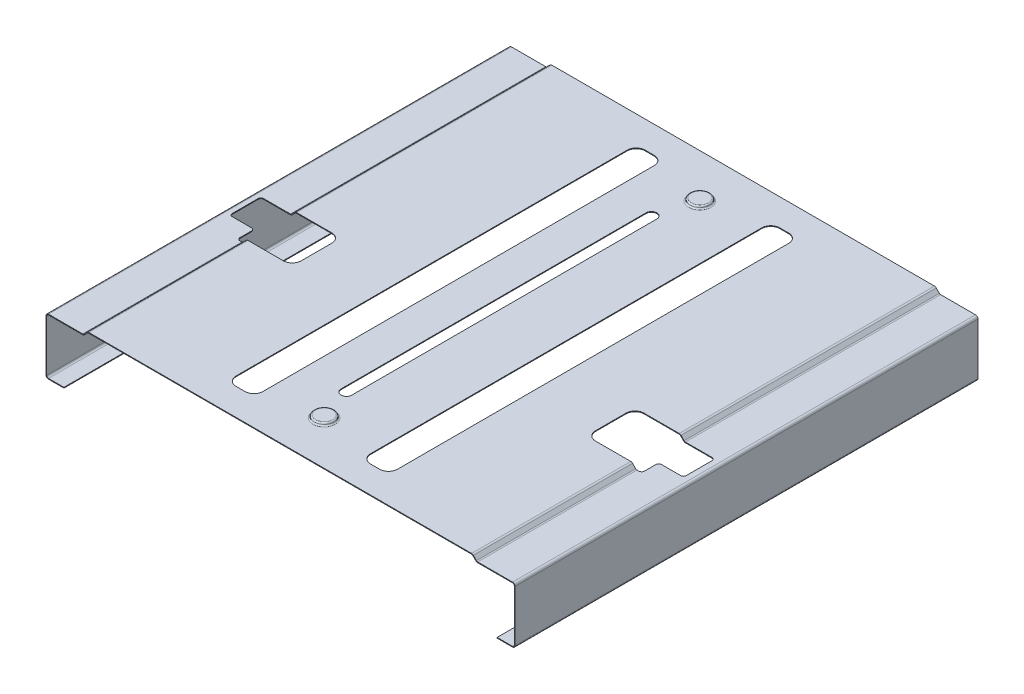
ISO-10303-21;
HEADER;
FILE_DESCRIPTION(('STEP AP214'),'2;1');
FILE_NAME('part.step','',(''),(''),'','','');
FILE_SCHEMA(('AUTOMOTIVE_DESIGN { 1 0 10303 214 1 1 1 1 }'));
ENDSEC;
DATA;
#1=APPLICATION_CONTEXT('core data for automotive mechanical design processes');
#2=APPLICATION_PROTOCOL_DEFINITION('international standard','automotive_design',2000,#1);
#3=PRODUCT_CONTEXT('',#1,'mechanical');
#4=PRODUCT('Part','Part','',(#3));
#5=PRODUCT_RELATED_PRODUCT_CATEGORY('part','',(#4));
#6=PRODUCT_DEFINITION_FORMATION('','',#4);
#7=PRODUCT_DEFINITION_CONTEXT('part definition',#1,'design');
#8=PRODUCT_DEFINITION('design','',#6,#7);
#9=PRODUCT_DEFINITION_SHAPE('','',#8);
#10=(LENGTH_UNIT() NAMED_UNIT(*) SI_UNIT(.MILLI.,.METRE.));
#11=(NAMED_UNIT(*) PLANE_ANGLE_UNIT() SI_UNIT($,.RADIAN.));
#12=(NAMED_UNIT(*) SI_UNIT($,.STERADIAN.) SOLID_ANGLE_UNIT());
#13=UNCERTAINTY_MEASURE_WITH_UNIT(LENGTH_MEASURE(1.E-05),#10,'distance_accuracy_value','');
#14=(GEOMETRIC_REPRESENTATION_CONTEXT(3) GLOBAL_UNCERTAINTY_ASSIGNED_CONTEXT((#13)) GLOBAL_UNIT_ASSIGNED_CONTEXT((#10,
#11,#12)) REPRESENTATION_CONTEXT('',''));
#15=CARTESIAN_POINT('',(0.,0.,0.));
#16=DIRECTION('',(0.,0.,1.));
#17=DIRECTION('',(1.,0.,0.));
#18=AXIS2_PLACEMENT_3D('',#15,#16,#17);
#19=CARTESIAN_POINT('',(17.1999999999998,-62.8000000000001,-516.));
#20=DIRECTION('',(-1.,0.,0.));
#21=DIRECTION('',(0.,-1.,0.));
#22=AXIS2_PLACEMENT_3D('',#19,#20,#21);
#23=PLANE('',#22);
#24=DIRECTION('',(0.,-1.,0.));
#25=VECTOR('',#24,1.);
#26=CARTESIAN_POINT('',(17.1999999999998,-62.8000000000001,0.));
#27=LINE('',#26,#25);
#28=CARTESIAN_POINT('',(17.1999999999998,-62.8000000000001,0.));
#29=VERTEX_POINT('',#28);
#30=CARTESIAN_POINT('',(17.1999999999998,-62.0000000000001,0.));
#31=VERTEX_POINT('',#30);
#32=EDGE_CURVE('E694',#29,#31,#27,.F.);
#33=ORIENTED_EDGE('',*,*,#32,.F.);
#34=DIRECTION('',(0.,0.,1.));
#35=VECTOR('',#34,1.);
#36=CARTESIAN_POINT('',(17.1999999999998,-62.8000000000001,0.));
#37=LINE('',#36,#35);
#38=CARTESIAN_POINT('',(17.1999999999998,-62.8000000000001,-516.));
#39=VERTEX_POINT('',#38);
#40=EDGE_CURVE('E651',#39,#29,#37,.T.);
#41=ORIENTED_EDGE('',*,*,#40,.F.);
#42=DIRECTION('',(0.,-1.,0.));
#43=VECTOR('',#42,1.);
#44=CARTESIAN_POINT('',(17.1999999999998,-62.8000000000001,-516.));
#45=LINE('',#44,#43);
#46=CARTESIAN_POINT('',(17.1999999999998,-62.0000000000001,-516.));
#47=VERTEX_POINT('',#46);
#48=EDGE_CURVE('E705',#47,#39,#45,.T.);
#49=ORIENTED_EDGE('',*,*,#48,.F.);
#50=DIRECTION('',(0.,0.,1.));
#51=VECTOR('',#50,1.);
#52=CARTESIAN_POINT('',(17.1999999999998,-62.0000000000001,0.));
#53=LINE('',#52,#51);
#54=EDGE_CURVE('E675',#47,#31,#53,.T.);
#55=ORIENTED_EDGE('',*,*,#54,.T.);
#56=EDGE_LOOP('',(#33,#41,#49,#55));
#57=FACE_BOUND('',#56,.T.);
#58=ADVANCED_FACE('F17',(#57),#23,.F.);
#59=CARTESIAN_POINT('',(499.970966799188,-62.8,-516.));
#60=DIRECTION('',(1.,0.,0.));
#61=DIRECTION('',(0.,1.,0.));
#62=AXIS2_PLACEMENT_3D('',#59,#60,#61);
#63=PLANE('',#62);
#64=DIRECTION('',(0.,1.,0.));
#65=VECTOR('',#64,1.);
#66=CARTESIAN_POINT('',(499.970966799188,-62.8,-516.));
#67=LINE('',#66,#65);
#68=CARTESIAN_POINT('',(499.970966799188,-62.8,-516.));
#69=VERTEX_POINT('',#68);
#70=CARTESIAN_POINT('',(499.970966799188,-62.,-516.));
#71=VERTEX_POINT('',#70);
#72=EDGE_CURVE('E680',#69,#71,#67,.T.);
#73=ORIENTED_EDGE('',*,*,#72,.F.);
#74=DIRECTION('',(0.,0.,1.));
#75=VECTOR('',#74,1.);
#76=CARTESIAN_POINT('',(499.970966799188,-62.8,0.));
#77=LINE('',#76,#75);
#78=CARTESIAN_POINT('',(499.970966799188,-62.8,0.));
#79=VERTEX_POINT('',#78);
#80=EDGE_CURVE('E650',#69,#79,#77,.T.);
#81=ORIENTED_EDGE('',*,*,#80,.T.);
#82=DIRECTION('',(0.,1.,0.));
#83=VECTOR('',#82,1.);
#84=CARTESIAN_POINT('',(499.970966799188,-62.8,0.));
#85=LINE('',#84,#83);
#86=CARTESIAN_POINT('',(499.970966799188,-62.,0.));
#87=VERTEX_POINT('',#86);
#88=EDGE_CURVE('E689',#87,#79,#85,.F.);
#89=ORIENTED_EDGE('',*,*,#88,.F.);
#90=DIRECTION('',(0.,0.,1.));
#91=VECTOR('',#90,1.);
#92=CARTESIAN_POINT('',(499.970966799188,-62.,0.));
#93=LINE('',#92,#91);
#94=EDGE_CURVE('E616',#71,#87,#93,.T.);
#95=ORIENTED_EDGE('',*,*,#94,.F.);
#96=EDGE_LOOP('',(#73,#81,#89,#95));
#97=FACE_BOUND('',#96,.T.);
#98=ADVANCED_FACE('F2570',(#97),#63,.F.);
#99=CARTESIAN_POINT('',(-4.18979788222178E-13,-62.,0.));
#100=DIRECTION('',(0.,-1.,0.));
#101=DIRECTION('',(1.,0.,0.));
#102=AXIS2_PLACEMENT_3D('',#99,#100,#101);
#103=PLANE('',#102);
#104=DIRECTION('',(1.,0.,0.));
#105=VECTOR('',#104,1.);
#106=CARTESIAN_POINT('',(-4.18979788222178E-13,-62.,0.));
#107=LINE('',#106,#105);
#108=CARTESIAN_POINT('',(-2.18597192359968E-13,-62.,0.));
#109=VERTEX_POINT('',#108);
#110=EDGE_CURVE('E665',#31,#109,#107,.F.);
#111=ORIENTED_EDGE('',*,*,#110,.F.);
#112=ORIENTED_EDGE('',*,*,#54,.F.);
#113=DIRECTION('',(1.,0.,0.));
#114=VECTOR('',#113,1.);
#115=CARTESIAN_POINT('',(-4.18979788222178E-13,-62.,-516.));
#116=LINE('',#115,#114);
#117=CARTESIAN_POINT('',(-2.48060515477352E-13,-62.,-516.));
#118=VERTEX_POINT('',#117);
#119=EDGE_CURVE('E678',#118,#47,#116,.T.);
#120=ORIENTED_EDGE('',*,*,#119,.F.);
#121=DIRECTION('',(0.,0.,-1.));
#122=VECTOR('',#121,1.);
#123=CARTESIAN_POINT('',(-1.94443331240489E-13,-62.,-516.));
#124=LINE('',#123,#122);
#125=EDGE_CURVE('E615',#118,#109,#124,.F.);
#126=ORIENTED_EDGE('',*,*,#125,.T.);
#127=EDGE_LOOP('',(#111,#112,#120,#126));
#128=FACE_BOUND('',#127,.T.);
#129=ADVANCED_FACE('F2562',(#128),#103,.F.);
#130=CARTESIAN_POINT('',(-4.24566158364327E-13,-62.8,0.));
#131=DIRECTION('',(0.,-1.,0.));
#132=DIRECTION('',(1.,0.,0.));
#133=AXIS2_PLACEMENT_3D('',#130,#131,#132);
#134=PLANE('',#133);
#135=DIRECTION('',(1.,0.,0.));
#136=VECTOR('',#135,1.);
#137=CARTESIAN_POINT('',(-4.24566158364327E-13,-62.8,-516.));
#138=LINE('',#137,#136);
#139=CARTESIAN_POINT('',(-2.50884993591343E-13,-62.8,-516.));
#140=VERTEX_POINT('',#139);
#141=EDGE_CURVE('E664',#140,#39,#138,.T.);
#142=ORIENTED_EDGE('',*,*,#141,.T.);
#143=ORIENTED_EDGE('',*,*,#40,.T.);
#144=DIRECTION('',(1.,0.,0.));
#145=VECTOR('',#144,1.);
#146=CARTESIAN_POINT('',(-4.24566158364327E-13,-62.8,0.));
#147=LINE('',#146,#145);
#148=CARTESIAN_POINT('',(-2.71701675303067E-13,-62.8,0.));
#149=VERTEX_POINT('',#148);
#150=EDGE_CURVE('E662',#29,#149,#147,.F.);
#151=ORIENTED_EDGE('',*,*,#150,.T.);
#152=DIRECTION('',(0.,0.,-1.));
#153=VECTOR('',#152,1.);
#154=CARTESIAN_POINT('',(-3.01943598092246E-13,-62.8,-516.));
#155=LINE('',#154,#153);
#156=EDGE_CURVE('E657',#140,#149,#155,.F.);
#157=ORIENTED_EDGE('',*,*,#156,.F.);
#158=EDGE_LOOP('',(#142,#143,#151,#157));
#159=FACE_BOUND('',#158,.T.);
#160=ADVANCED_FACE('F1330',(#159),#134,.T.);
#161=CARTESIAN_POINT('',(5.60647435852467E-13,-62.8000000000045,0.));
#162=DIRECTION('',(0.,1.,0.));
#163=DIRECTION('',(-1.,0.,0.));
#164=AXIS2_PLACEMENT_3D('',#161,#162,#163);
#165=PLANE('',#164);
#166=DIRECTION('',(-1.,0.,0.));
#167=VECTOR('',#166,1.);
#168=CARTESIAN_POINT('',(5.60647435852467E-13,-62.8000000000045,0.));
#169=LINE('',#168,#167);
#170=CARTESIAN_POINT('',(517.170966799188,-62.7999999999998,0.));
#171=VERTEX_POINT('',#170);
#172=EDGE_CURVE('E639',#79,#171,#169,.F.);
#173=ORIENTED_EDGE('',*,*,#172,.F.);
#174=ORIENTED_EDGE('',*,*,#80,.F.);
#175=DIRECTION('',(-1.,0.,0.));
#176=VECTOR('',#175,1.);
#177=CARTESIAN_POINT('',(5.60647435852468E-13,-62.8000000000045,-516.));
#178=LINE('',#177,#176);
#179=CARTESIAN_POINT('',(517.170966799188,-62.7999999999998,-516.));
#180=VERTEX_POINT('',#179);
#181=EDGE_CURVE('E647',#180,#69,#178,.T.);
#182=ORIENTED_EDGE('',*,*,#181,.F.);
#183=DIRECTION('',(0.,0.,1.));
#184=VECTOR('',#183,1.);
#185=CARTESIAN_POINT('',(517.170966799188,-62.7999999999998,0.));
#186=LINE('',#185,#184);
#187=EDGE_CURVE('E642',#171,#180,#186,.F.);
#188=ORIENTED_EDGE('',*,*,#187,.F.);
#189=EDGE_LOOP('',(#173,#174,#182,#188));
#190=FACE_BOUND('',#189,.T.);
#191=ADVANCED_FACE('F2545',(#190),#165,.F.);
#192=CARTESIAN_POINT('',(5.53353346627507E-13,-62.0000000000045,0.));
#193=DIRECTION('',(0.,1.,0.));
#194=DIRECTION('',(-1.,0.,0.));
#195=AXIS2_PLACEMENT_3D('',#192,#193,#194);
#196=PLANE('',#195);
#197=DIRECTION('',(-1.,0.,0.));
#198=VECTOR('',#197,1.);
#199=CARTESIAN_POINT('',(5.53353346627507E-13,-62.0000000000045,-516.));
#200=LINE('',#199,#198);
#201=CARTESIAN_POINT('',(517.170966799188,-61.9999999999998,-516.));
#202=VERTEX_POINT('',#201);
#203=EDGE_CURVE('E631',#202,#71,#200,.T.);
#204=ORIENTED_EDGE('',*,*,#203,.T.);
#205=ORIENTED_EDGE('',*,*,#94,.T.);
#206=DIRECTION('',(-1.,0.,0.));
#207=VECTOR('',#206,1.);
#208=CARTESIAN_POINT('',(5.53353346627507E-13,-62.0000000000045,0.));
#209=LINE('',#208,#207);
#210=CARTESIAN_POINT('',(517.170966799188,-61.9999999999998,0.));
#211=VERTEX_POINT('',#210);
#212=EDGE_CURVE('E634',#87,#211,#209,.F.);
#213=ORIENTED_EDGE('',*,*,#212,.T.);
#214=DIRECTION('',(0.,0.,1.));
#215=VECTOR('',#214,1.);
#216=CARTESIAN_POINT('',(517.170966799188,-61.9999999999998,0.));
#217=LINE('',#216,#215);
#218=EDGE_CURVE('E627',#211,#202,#217,.F.);
#219=ORIENTED_EDGE('',*,*,#218,.T.);
#220=EDGE_LOOP('',(#204,#205,#213,#219));
#221=FACE_BOUND('',#220,.T.);
#222=ADVANCED_FACE('F2537',(#221),#196,.T.);
#223=CARTESIAN_POINT('',(-1.80599870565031E-13,-60.,-516.));
#224=DIRECTION('',(0.,0.,-1.));
#225=DIRECTION('',(-1.,0.,0.));
#226=AXIS2_PLACEMENT_3D('',#223,#224,#225);
#227=CYLINDRICAL_SURFACE('',#226,2.);
#228=CARTESIAN_POINT('',(-2.01416552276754E-13,-60.,0.));
#229=DIRECTION('',(0.,0.,-1.));
#230=DIRECTION('',(-1.,0.,0.));
#231=AXIS2_PLACEMENT_3D('',#228,#229,#230);
#232=CIRCLE('',#231,2.);
#233=CARTESIAN_POINT('',(-2.0000000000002,-60.,0.));
#234=VERTEX_POINT('',#233);
#235=EDGE_CURVE('E673',#109,#234,#232,.T.);
#236=ORIENTED_EDGE('',*,*,#235,.F.);
#237=ORIENTED_EDGE('',*,*,#125,.F.);
#238=CARTESIAN_POINT('',(-1.80599870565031E-13,-60.,-516.));
#239=DIRECTION('',(0.,0.,-1.));
#240=DIRECTION('',(-1.,0.,0.));
#241=AXIS2_PLACEMENT_3D('',#238,#239,#240);
#242=CIRCLE('',#241,2.);
#243=CARTESIAN_POINT('',(-2.00000000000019,-60.,-516.));
#244=VERTEX_POINT('',#243);
#245=EDGE_CURVE('E597',#244,#118,#242,.F.);
#246=ORIENTED_EDGE('',*,*,#245,.F.);
#247=DIRECTION('',(0.,0.,1.));
#248=VECTOR('',#247,1.);
#249=CARTESIAN_POINT('',(-2.0000000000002,-60.,0.));
#250=LINE('',#249,#248);
#251=EDGE_CURVE('E605',#244,#234,#250,.T.);
#252=ORIENTED_EDGE('',*,*,#251,.T.);
#253=EDGE_LOOP('',(#236,#237,#246,#252));
#254=FACE_BOUND('',#253,.T.);
#255=ADVANCED_FACE('F612',(#254),#227,.F.);
#256=CARTESIAN_POINT('',(-1.80599870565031E-13,-60.,-516.));
#257=DIRECTION('',(0.,0.,-1.));
#258=DIRECTION('',(-1.,0.,0.));
#259=AXIS2_PLACEMENT_3D('',#256,#257,#258);
#260=CYLINDRICAL_SURFACE('',#259,2.8);
#261=ORIENTED_EDGE('',*,*,#156,.T.);
#262=CARTESIAN_POINT('',(-2.01416552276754E-13,-60.,0.));
#263=DIRECTION('',(0.,0.,-1.));
#264=DIRECTION('',(-1.,0.,0.));
#265=AXIS2_PLACEMENT_3D('',#262,#263,#264);
#266=CIRCLE('',#265,2.8);
#267=CARTESIAN_POINT('',(-2.8000000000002,-60.,0.));
#268=VERTEX_POINT('',#267);
#269=EDGE_CURVE('E660',#149,#268,#266,.T.);
#270=ORIENTED_EDGE('',*,*,#269,.T.);
#271=DIRECTION('',(0.,0.,1.));
#272=VECTOR('',#271,1.);
#273=CARTESIAN_POINT('',(-2.8000000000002,-60.,0.));
#274=LINE('',#273,#272);
#275=CARTESIAN_POINT('',(-2.80000000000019,-60.,-516.));
#276=VERTEX_POINT('',#275);
#277=EDGE_CURVE('E625',#276,#268,#274,.T.);
#278=ORIENTED_EDGE('',*,*,#277,.F.);
#279=CARTESIAN_POINT('',(-1.80599870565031E-13,-60.,-516.));
#280=DIRECTION('',(0.,0.,-1.));
#281=DIRECTION('',(-1.,0.,0.));
#282=AXIS2_PLACEMENT_3D('',#279,#280,#281);
#283=CIRCLE('',#282,2.8);
#284=EDGE_CURVE('E661',#276,#140,#283,.F.);
#285=ORIENTED_EDGE('',*,*,#284,.T.);
#286=EDGE_LOOP('',(#261,#270,#278,#285));
#287=FACE_BOUND('',#286,.T.);
#288=ADVANCED_FACE('F1334',(#287),#260,.T.);
#289=CARTESIAN_POINT('',(517.170966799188,-59.9999999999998,0.));
#290=DIRECTION('',(0.,0.,1.));
#291=DIRECTION('',(1.,0.,0.));
#292=AXIS2_PLACEMENT_3D('',#289,#290,#291);
#293=CYLINDRICAL_SURFACE('',#292,2.80000000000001);
#294=ORIENTED_EDGE('',*,*,#187,.T.);
#295=CARTESIAN_POINT('',(517.170966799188,-59.9999999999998,-516.));
#296=DIRECTION('',(0.,0.,1.));
#297=DIRECTION('',(1.,0.,0.));
#298=AXIS2_PLACEMENT_3D('',#295,#296,#297);
#299=CIRCLE('',#298,2.80000000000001);
#300=CARTESIAN_POINT('',(519.970966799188,-59.9999999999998,-516.));
#301=VERTEX_POINT('',#300);
#302=EDGE_CURVE('E645',#180,#301,#299,.T.);
#303=ORIENTED_EDGE('',*,*,#302,.T.);
#304=DIRECTION('',(0.,0.,1.));
#305=VECTOR('',#304,1.);
#306=CARTESIAN_POINT('',(519.970966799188,-59.9999999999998,0.));
#307=LINE('',#306,#305);
#308=CARTESIAN_POINT('',(519.970966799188,-59.9999999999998,0.));
#309=VERTEX_POINT('',#308);
#310=EDGE_CURVE('E1258',#301,#309,#307,.T.);
#311=ORIENTED_EDGE('',*,*,#310,.T.);
#312=CARTESIAN_POINT('',(517.170966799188,-59.9999999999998,0.));
#313=DIRECTION('',(0.,0.,1.));
#314=DIRECTION('',(1.,0.,0.));
#315=AXIS2_PLACEMENT_3D('',#312,#313,#314);
#316=CIRCLE('',#315,2.80000000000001);
#317=EDGE_CURVE('E646',#309,#171,#316,.F.);
#318=ORIENTED_EDGE('',*,*,#317,.T.);
#319=EDGE_LOOP('',(#294,#303,#311,#318));
#320=FACE_BOUND('',#319,.T.);
#321=ADVANCED_FACE('F2516',(#320),#293,.T.);
#322=CARTESIAN_POINT('',(517.170966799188,-59.9999999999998,0.));
#323=DIRECTION('',(0.,0.,1.));
#324=DIRECTION('',(1.,0.,0.));
#325=AXIS2_PLACEMENT_3D('',#322,#323,#324);
#326=CYLINDRICAL_SURFACE('',#325,2.00000000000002);
#327=CARTESIAN_POINT('',(517.170966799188,-59.9999999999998,-516.));
#328=DIRECTION('',(0.,0.,1.));
#329=DIRECTION('',(1.,0.,0.));
#330=AXIS2_PLACEMENT_3D('',#327,#328,#329);
#331=CIRCLE('',#330,2.00000000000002);
#332=CARTESIAN_POINT('',(519.170966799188,-59.9999999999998,-516.));
#333=VERTEX_POINT('',#332);
#334=EDGE_CURVE('E606',#202,#333,#331,.T.);
#335=ORIENTED_EDGE('',*,*,#334,.F.);
#336=ORIENTED_EDGE('',*,*,#218,.F.);
#337=CARTESIAN_POINT('',(517.170966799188,-59.9999999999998,0.));
#338=DIRECTION('',(0.,0.,1.));
#339=DIRECTION('',(1.,0.,0.));
#340=AXIS2_PLACEMENT_3D('',#337,#338,#339);
#341=CIRCLE('',#340,2.00000000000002);
#342=CARTESIAN_POINT('',(519.170966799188,-59.9999999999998,0.));
#343=VERTEX_POINT('',#342);
#344=EDGE_CURVE('E630',#343,#211,#341,.F.);
#345=ORIENTED_EDGE('',*,*,#344,.F.);
#346=DIRECTION('',(0.,0.,1.));
#347=VECTOR('',#346,1.);
#348=CARTESIAN_POINT('',(519.170966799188,-59.9999999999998,0.));
#349=LINE('',#348,#347);
#350=EDGE_CURVE('E1217',#333,#343,#349,.T.);
#351=ORIENTED_EDGE('',*,*,#350,.F.);
#352=EDGE_LOOP('',(#335,#336,#345,#351));
#353=FACE_BOUND('',#352,.T.);
#354=ADVANCED_FACE('F1235',(#353),#326,.F.);
#355=CARTESIAN_POINT('',(258.585483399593,7.85685424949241,-48.6099999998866));
#356=DIRECTION('',(0.,1.,0.));
#357=DIRECTION('',(-1.,0.,0.));
#358=AXIS2_PLACEMENT_3D('',#355,#356,#357);
#359=PLANE('',#358);
#360=CARTESIAN_POINT('',(258.585483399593,7.85685424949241,-48.6099999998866));
#361=DIRECTION('',(0.,-1.,0.));
#362=DIRECTION('',(1.,0.,0.));
#363=AXIS2_PLACEMENT_3D('',#360,#361,#362);
#364=CIRCLE('',#363,9.45990025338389);
#365=CARTESIAN_POINT('',(268.045383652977,7.85685424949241,-48.6099999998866));
#366=VERTEX_POINT('',#365);
#367=CARTESIAN_POINT('',(249.125583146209,7.8568542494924,-48.6099999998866));
#368=VERTEX_POINT('',#367);
#369=EDGE_CURVE('E1212',#366,#368,#364,.T.);
#370=ORIENTED_EDGE('',*,*,#369,.F.);
#371=CARTESIAN_POINT('',(258.585483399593,7.85685424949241,-48.6099999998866));
#372=DIRECTION('',(0.,-1.,0.));
#373=DIRECTION('',(-1.,0.,0.));
#374=AXIS2_PLACEMENT_3D('',#371,#372,#373);
#375=CIRCLE('',#374,9.45990025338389);
#376=EDGE_CURVE('E1208',#368,#366,#375,.T.);
#377=ORIENTED_EDGE('',*,*,#376,.F.);
#378=EDGE_LOOP('',(#370,#377));
#379=FACE_BOUND('',#378,.T.);
#380=ADVANCED_FACE('F1218',(#379),#359,.T.);
#381=CARTESIAN_POINT('',(258.585483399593,7.85685424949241,-467.390000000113));
#382=DIRECTION('',(0.,1.,0.));
#383=DIRECTION('',(-1.,0.,0.));
#384=AXIS2_PLACEMENT_3D('',#381,#382,#383);
#385=PLANE('',#384);
#386=CARTESIAN_POINT('',(258.585483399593,7.85685424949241,-467.390000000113));
#387=DIRECTION('',(0.,-1.,0.));
#388=DIRECTION('',(1.,0.,0.));
#389=AXIS2_PLACEMENT_3D('',#386,#387,#388);
#390=CIRCLE('',#389,9.45990025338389);
#391=CARTESIAN_POINT('',(268.045383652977,7.85685424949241,-467.390000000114));
#392=VERTEX_POINT('',#391);
#393=CARTESIAN_POINT('',(249.125583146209,7.8568542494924,-467.390000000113));
#394=VERTEX_POINT('',#393);
#395=EDGE_CURVE('E1025',#392,#394,#390,.T.);
#396=ORIENTED_EDGE('',*,*,#395,.F.);
#397=CARTESIAN_POINT('',(258.585483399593,7.85685424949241,-467.390000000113));
#398=DIRECTION('',(0.,-1.,0.));
#399=DIRECTION('',(-1.,0.,0.));
#400=AXIS2_PLACEMENT_3D('',#397,#398,#399);
#401=CIRCLE('',#400,9.45990025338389);
#402=EDGE_CURVE('E1219',#394,#392,#401,.T.);
#403=ORIENTED_EDGE('',*,*,#402,.F.);
#404=EDGE_LOOP('',(#396,#403));
#405=FACE_BOUND('',#404,.T.);
#406=ADVANCED_FACE('F1234',(#405),#385,.T.);
#407=CARTESIAN_POINT('',(-1.99999999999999,0.,0.));
#408=DIRECTION('',(-1.,0.,0.));
#409=DIRECTION('',(0.,-1.,0.));
#410=AXIS2_PLACEMENT_3D('',#407,#408,#409);
#411=PLANE('',#410);
#412=DIRECTION('',(0.,-1.,0.));
#413=VECTOR('',#412,1.);
#414=CARTESIAN_POINT('',(-1.99999999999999,0.,0.));
#415=LINE('',#414,#413);
#416=CARTESIAN_POINT('',(-2.,-2.8,0.));
#417=VERTEX_POINT('',#416);
#418=EDGE_CURVE('E619',#234,#417,#415,.F.);
#419=ORIENTED_EDGE('',*,*,#418,.F.);
#420=ORIENTED_EDGE('',*,*,#251,.F.);
#421=DIRECTION('',(0.,-1.,0.));
#422=VECTOR('',#421,1.);
#423=CARTESIAN_POINT('',(-1.99999999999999,0.,-516.));
#424=LINE('',#423,#422);
#425=CARTESIAN_POINT('',(-2.,-2.8,-516.));
#426=VERTEX_POINT('',#425);
#427=EDGE_CURVE('E592',#426,#244,#424,.T.);
#428=ORIENTED_EDGE('',*,*,#427,.F.);
#429=DIRECTION('',(0.,0.,-1.));
#430=VECTOR('',#429,1.);
#431=CARTESIAN_POINT('',(-2.,-2.8,-516.));
#432=LINE('',#431,#430);
#433=EDGE_CURVE('E1017',#426,#417,#432,.F.);
#434=ORIENTED_EDGE('',*,*,#433,.T.);
#435=EDGE_LOOP('',(#419,#420,#428,#434));
#436=FACE_BOUND('',#435,.T.);
#437=ADVANCED_FACE('F618',(#436),#411,.F.);
#438=CARTESIAN_POINT('',(-2.79999999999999,0.,0.));
#439=DIRECTION('',(-1.,0.,0.));
#440=DIRECTION('',(0.,-1.,0.));
#441=AXIS2_PLACEMENT_3D('',#438,#439,#440);
#442=PLANE('',#441);
#443=DIRECTION('',(0.,-1.,0.));
#444=VECTOR('',#443,1.);
#445=CARTESIAN_POINT('',(-2.79999999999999,0.,-516.));
#446=LINE('',#445,#444);
#447=CARTESIAN_POINT('',(-2.8,-2.8,-516.));
#448=VERTEX_POINT('',#447);
#449=EDGE_CURVE('E1271',#448,#276,#446,.T.);
#450=ORIENTED_EDGE('',*,*,#449,.T.);
#451=ORIENTED_EDGE('',*,*,#277,.T.);
#452=DIRECTION('',(0.,-1.,0.));
#453=VECTOR('',#452,1.);
#454=CARTESIAN_POINT('',(-2.79999999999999,0.,0.));
#455=LINE('',#454,#453);
#456=CARTESIAN_POINT('',(-2.8,-2.8,0.));
#457=VERTEX_POINT('',#456);
#458=EDGE_CURVE('E621',#268,#457,#455,.F.);
#459=ORIENTED_EDGE('',*,*,#458,.T.);
#460=DIRECTION('',(0.,0.,-1.));
#461=VECTOR('',#460,1.);
#462=CARTESIAN_POINT('',(-2.8,-2.8,-516.));
#463=LINE('',#462,#461);
#464=EDGE_CURVE('E1006',#448,#457,#463,.F.);
#465=ORIENTED_EDGE('',*,*,#464,.F.);
#466=EDGE_LOOP('',(#450,#451,#459,#465));
#467=FACE_BOUND('',#466,.T.);
#468=ADVANCED_FACE('F1337',(#467),#442,.T.);
#469=CARTESIAN_POINT('',(519.970966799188,2.91914528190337E-12,0.));
#470=DIRECTION('',(-1.,0.,0.));
#471=DIRECTION('',(0.,-1.,0.));
#472=AXIS2_PLACEMENT_3D('',#469,#470,#471);
#473=PLANE('',#472);
#474=DIRECTION('',(0.,-1.,0.));
#475=VECTOR('',#474,1.);
#476=CARTESIAN_POINT('',(519.970966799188,2.91914528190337E-12,0.));
#477=LINE('',#476,#475);
#478=CARTESIAN_POINT('',(519.970966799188,-2.7999999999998,0.));
#479=VERTEX_POINT('',#478);
#480=EDGE_CURVE('E1260',#309,#479,#477,.F.);
#481=ORIENTED_EDGE('',*,*,#480,.F.);
#482=ORIENTED_EDGE('',*,*,#310,.F.);
#483=DIRECTION('',(0.,-1.,0.));
#484=VECTOR('',#483,1.);
#485=CARTESIAN_POINT('',(519.970966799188,2.91914528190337E-12,-516.));
#486=LINE('',#485,#484);
#487=CARTESIAN_POINT('',(519.970966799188,-2.7999999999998,-516.));
#488=VERTEX_POINT('',#487);
#489=EDGE_CURVE('E1261',#488,#301,#486,.T.);
#490=ORIENTED_EDGE('',*,*,#489,.F.);
#491=DIRECTION('',(0.,0.,1.));
#492=VECTOR('',#491,1.);
#493=CARTESIAN_POINT('',(519.970966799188,-2.79999999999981,0.));
#494=LINE('',#493,#492);
#495=EDGE_CURVE('E986',#479,#488,#494,.F.);
#496=ORIENTED_EDGE('',*,*,#495,.F.);
#497=EDGE_LOOP('',(#481,#482,#490,#496));
#498=FACE_BOUND('',#497,.T.);
#499=ADVANCED_FACE('F2476',(#498),#473,.F.);
#500=CARTESIAN_POINT('',(519.170966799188,2.91444326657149E-12,0.));
#501=DIRECTION('',(-1.,0.,0.));
#502=DIRECTION('',(0.,-1.,0.));
#503=AXIS2_PLACEMENT_3D('',#500,#501,#502);
#504=PLANE('',#503);
#505=DIRECTION('',(0.,-1.,0.));
#506=VECTOR('',#505,1.);
#507=CARTESIAN_POINT('',(519.170966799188,2.91444326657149E-12,-516.));
#508=LINE('',#507,#506);
#509=CARTESIAN_POINT('',(519.170966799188,-2.7999999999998,-516.));
#510=VERTEX_POINT('',#509);
#511=EDGE_CURVE('E1257',#510,#333,#508,.T.);
#512=ORIENTED_EDGE('',*,*,#511,.T.);
#513=ORIENTED_EDGE('',*,*,#350,.T.);
#514=DIRECTION('',(0.,-1.,0.));
#515=VECTOR('',#514,1.);
#516=CARTESIAN_POINT('',(519.170966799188,2.91444326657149E-12,0.));
#517=LINE('',#516,#515);
#518=CARTESIAN_POINT('',(519.170966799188,-2.7999999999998,0.));
#519=VERTEX_POINT('',#518);
#520=EDGE_CURVE('E1265',#343,#519,#517,.F.);
#521=ORIENTED_EDGE('',*,*,#520,.T.);
#522=DIRECTION('',(0.,0.,1.));
#523=VECTOR('',#522,1.);
#524=CARTESIAN_POINT('',(519.170966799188,-2.79999999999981,0.));
#525=LINE('',#524,#523);
#526=EDGE_CURVE('E976',#519,#510,#525,.F.);
#527=ORIENTED_EDGE('',*,*,#526,.T.);
#528=EDGE_LOOP('',(#512,#513,#521,#527));
#529=FACE_BOUND('',#528,.T.);
#530=ADVANCED_FACE('F2469',(#529),#504,.T.);
#531=CARTESIAN_POINT('',(258.585483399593,6.35685424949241,-48.6099999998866));
#532=DIRECTION('',(0.,1.,0.));
#533=DIRECTION('',(-1.,0.,0.));
#534=AXIS2_PLACEMENT_3D('',#531,#532,#533);
#535=TOROIDAL_SURFACE('',#534,9.45990025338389,1.5);
#536=ORIENTED_EDGE('',*,*,#376,.T.);
#537=ORIENTED_EDGE('',*,*,#369,.T.);
#538=EDGE_LOOP('',(#536,#537));
#539=FACE_BOUND('',#538,.T.);
#540=CARTESIAN_POINT('',(258.585483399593,6.35685424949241,-48.6099999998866));
#541=DIRECTION('',(0.,-1.,0.));
#542=DIRECTION('',(1.,0.,0.));
#543=AXIS2_PLACEMENT_3D('',#540,#541,#542);
#544=CIRCLE('',#543,10.9599002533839);
#545=CARTESIAN_POINT('',(269.545383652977,6.35685424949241,-48.6099999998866));
#546=VERTEX_POINT('',#545);
#547=EDGE_CURVE('E1103',#546,#546,#544,.F.);
#548=ORIENTED_EDGE('',*,*,#547,.T.);
#549=EDGE_LOOP('',(#548));
#550=FACE_BOUND('',#549,.T.);
#551=ADVANCED_FACE('F1183',(#539,#550),#535,.T.);
#552=CARTESIAN_POINT('',(258.585483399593,6.35685424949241,-467.390000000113));
#553=DIRECTION('',(0.,1.,0.));
#554=DIRECTION('',(-1.,0.,0.));
#555=AXIS2_PLACEMENT_3D('',#552,#553,#554);
#556=TOROIDAL_SURFACE('',#555,9.45990025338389,1.5);
#557=ORIENTED_EDGE('',*,*,#402,.T.);
#558=ORIENTED_EDGE('',*,*,#395,.T.);
#559=EDGE_LOOP('',(#557,#558));
#560=FACE_BOUND('',#559,.T.);
#561=CARTESIAN_POINT('',(258.585483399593,6.35685424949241,-467.390000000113));
#562=DIRECTION('',(0.,-1.,0.));
#563=DIRECTION('',(1.,0.,0.));
#564=AXIS2_PLACEMENT_3D('',#561,#562,#563);
#565=CIRCLE('',#564,10.9599002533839);
#566=CARTESIAN_POINT('',(269.545383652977,6.35685424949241,-467.390000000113));
#567=VERTEX_POINT('',#566);
#568=EDGE_CURVE('E1171',#567,#567,#565,.F.);
#569=ORIENTED_EDGE('',*,*,#568,.T.);
#570=EDGE_LOOP('',(#569));
#571=FACE_BOUND('',#570,.T.);
#572=ADVANCED_FACE('F1178',(#560,#571),#556,.T.);
#573=CARTESIAN_POINT('',(0.,-2.8,-516.));
#574=DIRECTION('',(0.,0.,-1.));
#575=DIRECTION('',(-1.,0.,0.));
#576=AXIS2_PLACEMENT_3D('',#573,#574,#575);
#577=CYLINDRICAL_SURFACE('',#576,2.);
#578=CARTESIAN_POINT('',(0.,-2.8,0.));
#579=DIRECTION('',(0.,0.,-1.));
#580=DIRECTION('',(-1.,0.,0.));
#581=AXIS2_PLACEMENT_3D('',#578,#579,#580);
#582=CIRCLE('',#581,2.);
#583=CARTESIAN_POINT('',(0.,-0.8,0.));
#584=VERTEX_POINT('',#583);
#585=EDGE_CURVE('E1015',#417,#584,#582,.T.);
#586=ORIENTED_EDGE('',*,*,#585,.F.);
#587=ORIENTED_EDGE('',*,*,#433,.F.);
#588=CARTESIAN_POINT('',(0.,-2.8,-516.));
#589=DIRECTION('',(0.,0.,-1.));
#590=DIRECTION('',(-1.,0.,0.));
#591=AXIS2_PLACEMENT_3D('',#588,#589,#590);
#592=CIRCLE('',#591,2.);
#593=CARTESIAN_POINT('',(0.,-0.8,-516.));
#594=VERTEX_POINT('',#593);
#595=EDGE_CURVE('E600',#594,#426,#592,.F.);
#596=ORIENTED_EDGE('',*,*,#595,.F.);
#597=DIRECTION('',(0.,0.,-1.));
#598=VECTOR('',#597,1.);
#599=CARTESIAN_POINT('',(0.,-0.8,0.));
#600=LINE('',#599,#598);
#601=EDGE_CURVE('E1156',#584,#594,#600,.T.);
#602=ORIENTED_EDGE('',*,*,#601,.F.);
#603=EDGE_LOOP('',(#586,#587,#596,#602));
#604=FACE_BOUND('',#603,.T.);
#605=ADVANCED_FACE('F1182',(#604),#577,.F.);
#606=CARTESIAN_POINT('',(35.7854833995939,-5.14314575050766,-180.499527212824));
#607=DIRECTION('',(0.,-1.,0.));
#608=DIRECTION('',(1.,0.,0.));
#609=AXIS2_PLACEMENT_3D('',#606,#607,#608);
#610=CYLINDRICAL_SURFACE('',#609,3.);
#611=DIRECTION('',(0.,1.,0.));
#612=VECTOR('',#611,1.);
#613=CARTESIAN_POINT('',(32.7854833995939,-5.14314575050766,-180.499527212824));
#614=LINE('',#613,#612);
#615=CARTESIAN_POINT('',(32.785483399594,-0.8,-180.499527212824));
#616=VERTEX_POINT('',#615);
#617=CARTESIAN_POINT('',(32.785483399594,0.,-180.499527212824));
#618=VERTEX_POINT('',#617);
#619=EDGE_CURVE('E1133',#616,#618,#614,.T.);
#620=ORIENTED_EDGE('',*,*,#619,.T.);
#621=CARTESIAN_POINT('',(35.7854833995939,0.,-180.499527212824));
#622=DIRECTION('',(0.,-1.,0.));
#623=DIRECTION('',(1.,0.,0.));
#624=AXIS2_PLACEMENT_3D('',#621,#622,#623);
#625=CIRCLE('',#624,3.);
#626=CARTESIAN_POINT('',(35.7854833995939,0.,-177.499527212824));
#627=VERTEX_POINT('',#626);
#628=EDGE_CURVE('E928',#618,#627,#625,.F.);
#629=ORIENTED_EDGE('',*,*,#628,.T.);
#630=DIRECTION('',(0.,-1.,0.));
#631=VECTOR('',#630,1.);
#632=CARTESIAN_POINT('',(35.7854833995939,-5.14314575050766,-177.499527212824));
#633=LINE('',#632,#631);
#634=CARTESIAN_POINT('',(35.7854833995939,-0.8,-177.499527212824));
#635=VERTEX_POINT('',#634);
#636=EDGE_CURVE('E1014',#635,#627,#633,.F.);
#637=ORIENTED_EDGE('',*,*,#636,.F.);
#638=CARTESIAN_POINT('',(35.7854833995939,-0.799999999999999,-180.499527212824));
#639=DIRECTION('',(0.,-1.,0.));
#640=DIRECTION('',(1.,0.,0.));
#641=AXIS2_PLACEMENT_3D('',#638,#639,#640);
#642=CIRCLE('',#641,3.);
#643=EDGE_CURVE('E940',#616,#635,#642,.F.);
#644=ORIENTED_EDGE('',*,*,#643,.F.);
#645=EDGE_LOOP('',(#620,#629,#637,#644));
#646=FACE_BOUND('',#645,.T.);
#647=ADVANCED_FACE('F2441',(#646),#610,.F.);
#648=CARTESIAN_POINT('',(38.0402020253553,2.00000000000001,-516.));
#649=DIRECTION('',(0.,0.,-1.));
#650=DIRECTION('',(-1.,0.,0.));
#651=AXIS2_PLACEMENT_3D('',#648,#649,#650);
#652=CYLINDRICAL_SURFACE('',#651,2.00000000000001);
#653=CARTESIAN_POINT('',(38.0402020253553,2.00000000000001,-177.499527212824));
#654=DIRECTION('',(0.,0.,-1.));
#655=DIRECTION('',(-1.,0.,0.));
#656=AXIS2_PLACEMENT_3D('',#653,#654,#655);
#657=CIRCLE('',#656,2.00000000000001);
#658=CARTESIAN_POINT('',(38.0402020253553,0.,-177.499527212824));
#659=VERTEX_POINT('',#658);
#660=CARTESIAN_POINT('',(39.4544155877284,0.5857864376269,-177.499527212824));
#661=VERTEX_POINT('',#660);
#662=EDGE_CURVE('E1010',#659,#661,#657,.F.);
#663=ORIENTED_EDGE('',*,*,#662,.F.);
#664=DIRECTION('',(0.,0.,-1.));
#665=VECTOR('',#664,1.);
#666=CARTESIAN_POINT('',(38.0402020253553,0.,0.));
#667=LINE('',#666,#665);
#668=CARTESIAN_POINT('',(38.0402020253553,0.,0.));
#669=VERTEX_POINT('',#668);
#670=EDGE_CURVE('E931',#659,#669,#667,.F.);
#671=ORIENTED_EDGE('',*,*,#670,.T.);
#672=CARTESIAN_POINT('',(38.0402020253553,2.00000000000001,0.));
#673=DIRECTION('',(0.,0.,-1.));
#674=DIRECTION('',(-1.,0.,0.));
#675=AXIS2_PLACEMENT_3D('',#672,#673,#674);
#676=CIRCLE('',#675,2.00000000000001);
#677=CARTESIAN_POINT('',(39.4544155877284,0.585786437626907,0.));
#678=VERTEX_POINT('',#677);
#679=EDGE_CURVE('E1012',#678,#669,#676,.T.);
#680=ORIENTED_EDGE('',*,*,#679,.F.);
#681=DIRECTION('',(0.,0.,1.));
#682=VECTOR('',#681,1.);
#683=CARTESIAN_POINT('',(39.4544155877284,0.585786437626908,0.));
#684=LINE('',#683,#682);
#685=EDGE_CURVE('E959',#661,#678,#684,.T.);
#686=ORIENTED_EDGE('',*,*,#685,.F.);
#687=EDGE_LOOP('',(#663,#671,#680,#686));
#688=FACE_BOUND('',#687,.T.);
#689=ADVANCED_FACE('F2433',(#688),#652,.F.);
#690=CARTESIAN_POINT('',(0.,-2.8,-516.));
#691=DIRECTION('',(0.,0.,-1.));
#692=DIRECTION('',(-1.,0.,0.));
#693=AXIS2_PLACEMENT_3D('',#690,#691,#692);
#694=CYLINDRICAL_SURFACE('',#693,2.8);
#695=ORIENTED_EDGE('',*,*,#464,.T.);
#696=CARTESIAN_POINT('',(0.,-2.8,0.));
#697=DIRECTION('',(0.,0.,-1.));
#698=DIRECTION('',(-1.,0.,0.));
#699=AXIS2_PLACEMENT_3D('',#696,#697,#698);
#700=CIRCLE('',#699,2.8);
#701=CARTESIAN_POINT('',(0.,0.,0.));
#702=VERTEX_POINT('',#701);
#703=EDGE_CURVE('E1003',#457,#702,#700,.T.);
#704=ORIENTED_EDGE('',*,*,#703,.T.);
#705=DIRECTION('',(0.,0.,-1.));
#706=VECTOR('',#705,1.);
#707=CARTESIAN_POINT('',(0.,0.,0.));
#708=LINE('',#707,#706);
#709=CARTESIAN_POINT('',(0.,0.,-516.));
#710=VERTEX_POINT('',#709);
#711=EDGE_CURVE('E1147',#702,#710,#708,.T.);
#712=ORIENTED_EDGE('',*,*,#711,.T.);
#713=CARTESIAN_POINT('',(0.,-2.8,-516.));
#714=DIRECTION('',(0.,0.,-1.));
#715=DIRECTION('',(-1.,0.,0.));
#716=AXIS2_PLACEMENT_3D('',#713,#714,#715);
#717=CIRCLE('',#716,2.8);
#718=EDGE_CURVE('E1007',#710,#448,#717,.F.);
#719=ORIENTED_EDGE('',*,*,#718,.T.);
#720=EDGE_LOOP('',(#695,#704,#712,#719));
#721=FACE_BOUND('',#720,.T.);
#722=ADVANCED_FACE('F1340',(#721),#694,.T.);
#723=CARTESIAN_POINT('',(38.0402020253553,2.00000000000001,-516.));
#724=DIRECTION('',(0.,0.,-1.));
#725=DIRECTION('',(-1.,0.,0.));
#726=AXIS2_PLACEMENT_3D('',#723,#724,#725);
#727=CYLINDRICAL_SURFACE('',#726,2.00000000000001);
#728=CARTESIAN_POINT('',(38.0402020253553,2.00000000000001,-231.499527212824));
#729=DIRECTION('',(0.,0.,-1.));
#730=DIRECTION('',(-1.,0.,0.));
#731=AXIS2_PLACEMENT_3D('',#728,#729,#730);
#732=CIRCLE('',#731,2.00000000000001);
#733=CARTESIAN_POINT('',(39.4544155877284,0.585786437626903,-231.499527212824));
#734=VERTEX_POINT('',#733);
#735=CARTESIAN_POINT('',(38.0402020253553,0.,-231.499527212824));
#736=VERTEX_POINT('',#735);
#737=EDGE_CURVE('E998',#734,#736,#732,.T.);
#738=ORIENTED_EDGE('',*,*,#737,.F.);
#739=DIRECTION('',(0.,0.,1.));
#740=VECTOR('',#739,1.);
#741=CARTESIAN_POINT('',(39.4544155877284,0.585786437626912,0.));
#742=LINE('',#741,#740);
#743=CARTESIAN_POINT('',(39.4544155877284,0.585786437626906,-516.));
#744=VERTEX_POINT('',#743);
#745=EDGE_CURVE('E956',#744,#734,#742,.T.);
#746=ORIENTED_EDGE('',*,*,#745,.F.);
#747=CARTESIAN_POINT('',(38.0402020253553,2.00000000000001,-516.));
#748=DIRECTION('',(0.,0.,-1.));
#749=DIRECTION('',(-1.,0.,0.));
#750=AXIS2_PLACEMENT_3D('',#747,#748,#749);
#751=CIRCLE('',#750,2.00000000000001);
#752=CARTESIAN_POINT('',(38.0402020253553,0.,-516.));
#753=VERTEX_POINT('',#752);
#754=EDGE_CURVE('E1001',#753,#744,#751,.F.);
#755=ORIENTED_EDGE('',*,*,#754,.F.);
#756=DIRECTION('',(0.,0.,-1.));
#757=VECTOR('',#756,1.);
#758=CARTESIAN_POINT('',(38.0402020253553,0.,0.));
#759=LINE('',#758,#757);
#760=EDGE_CURVE('E927',#753,#736,#759,.F.);
#761=ORIENTED_EDGE('',*,*,#760,.T.);
#762=EDGE_LOOP('',(#738,#746,#755,#761));
#763=FACE_BOUND('',#762,.T.);
#764=ADVANCED_FACE('F1353',(#763),#727,.F.);
#765=CARTESIAN_POINT('',(8.19999999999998,-5.14314575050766,-228.499527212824));
#766=DIRECTION('',(0.,-1.,0.));
#767=DIRECTION('',(1.,0.,0.));
#768=AXIS2_PLACEMENT_3D('',#765,#766,#767);
#769=CYLINDRICAL_SURFACE('',#768,3.);
#770=DIRECTION('',(0.,-1.,0.));
#771=VECTOR('',#770,1.);
#772=CARTESIAN_POINT('',(8.19999999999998,-5.14314575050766,-231.499527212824));
#773=LINE('',#772,#771);
#774=CARTESIAN_POINT('',(8.19999999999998,0.,-231.499527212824));
#775=VERTEX_POINT('',#774);
#776=CARTESIAN_POINT('',(8.19999999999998,-0.799999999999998,-231.499527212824));
#777=VERTEX_POINT('',#776);
#778=EDGE_CURVE('E1000',#775,#777,#773,.T.);
#779=ORIENTED_EDGE('',*,*,#778,.F.);
#780=CARTESIAN_POINT('',(8.19999999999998,0.,-228.499527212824));
#781=DIRECTION('',(0.,-1.,0.));
#782=DIRECTION('',(1.,0.,0.));
#783=AXIS2_PLACEMENT_3D('',#780,#781,#782);
#784=CIRCLE('',#783,3.);
#785=CARTESIAN_POINT('',(5.19999999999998,0.,-228.499527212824));
#786=VERTEX_POINT('',#785);
#787=EDGE_CURVE('E925',#775,#786,#784,.F.);
#788=ORIENTED_EDGE('',*,*,#787,.T.);
#789=DIRECTION('',(0.,-1.,0.));
#790=VECTOR('',#789,1.);
#791=CARTESIAN_POINT('',(5.19999999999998,-5.14314575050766,-228.499527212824));
#792=LINE('',#791,#790);
#793=CARTESIAN_POINT('',(5.19999999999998,-0.800000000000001,-228.499527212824));
#794=VERTEX_POINT('',#793);
#795=EDGE_CURVE('E1142',#786,#794,#792,.T.);
#796=ORIENTED_EDGE('',*,*,#795,.T.);
#797=CARTESIAN_POINT('',(8.19999999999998,-0.8,-228.499527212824));
#798=DIRECTION('',(0.,-1.,0.));
#799=DIRECTION('',(1.,0.,0.));
#800=AXIS2_PLACEMENT_3D('',#797,#798,#799);
#801=CIRCLE('',#800,3.);
#802=EDGE_CURVE('E936',#777,#794,#801,.F.);
#803=ORIENTED_EDGE('',*,*,#802,.F.);
#804=EDGE_LOOP('',(#779,#788,#796,#803));
#805=FACE_BOUND('',#804,.T.);
#806=ADVANCED_FACE('F2409',(#805),#769,.F.);
#807=CARTESIAN_POINT('',(5.19999999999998,-5.14314575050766,-231.499527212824));
#808=DIRECTION('',(-1.,0.,0.));
#809=DIRECTION('',(0.,-1.,0.));
#810=AXIS2_PLACEMENT_3D('',#807,#808,#809);
#811=PLANE('',#810);
#812=ORIENTED_EDGE('',*,*,#795,.F.);
#813=DIRECTION('',(0.,0.,-1.));
#814=VECTOR('',#813,1.);
#815=CARTESIAN_POINT('',(5.19999999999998,0.,0.));
#816=LINE('',#815,#814);
#817=CARTESIAN_POINT('',(5.19999999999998,0.,-199.499527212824));
#818=VERTEX_POINT('',#817);
#819=EDGE_CURVE('E924',#786,#818,#816,.F.);
#820=ORIENTED_EDGE('',*,*,#819,.T.);
#821=DIRECTION('',(0.,-1.,0.));
#822=VECTOR('',#821,1.);
#823=CARTESIAN_POINT('',(5.19999999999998,-5.14314575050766,-199.499527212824));
#824=LINE('',#823,#822);
#825=CARTESIAN_POINT('',(5.19999999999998,-0.8,-199.499527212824));
#826=VERTEX_POINT('',#825);
#827=EDGE_CURVE('E1140',#818,#826,#824,.T.);
#828=ORIENTED_EDGE('',*,*,#827,.T.);
#829=DIRECTION('',(0.,0.,-1.));
#830=VECTOR('',#829,1.);
#831=CARTESIAN_POINT('',(5.19999999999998,-0.8,0.));
#832=LINE('',#831,#830);
#833=EDGE_CURVE('E935',#794,#826,#832,.F.);
#834=ORIENTED_EDGE('',*,*,#833,.F.);
#835=EDGE_LOOP('',(#812,#820,#828,#834));
#836=FACE_BOUND('',#835,.T.);
#837=ADVANCED_FACE('F2400',(#836),#811,.F.);
#838=CARTESIAN_POINT('',(8.19999999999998,-5.14314575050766,-199.499527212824));
#839=DIRECTION('',(0.,-1.,0.));
#840=DIRECTION('',(1.,0.,0.));
#841=AXIS2_PLACEMENT_3D('',#838,#839,#840);
#842=CYLINDRICAL_SURFACE('',#841,3.);
#843=ORIENTED_EDGE('',*,*,#827,.F.);
#844=CARTESIAN_POINT('',(8.19999999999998,0.,-199.499527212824));
#845=DIRECTION('',(0.,-1.,0.));
#846=DIRECTION('',(1.,0.,0.));
#847=AXIS2_PLACEMENT_3D('',#844,#845,#846);
#848=CIRCLE('',#847,3.);
#849=CARTESIAN_POINT('',(8.19999999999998,0.,-196.499527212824));
#850=VERTEX_POINT('',#849);
#851=EDGE_CURVE('E922',#818,#850,#848,.F.);
#852=ORIENTED_EDGE('',*,*,#851,.T.);
#853=DIRECTION('',(0.,-1.,0.));
#854=VECTOR('',#853,1.);
#855=CARTESIAN_POINT('',(8.19999999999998,-5.14314575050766,-196.499527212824));
#856=LINE('',#855,#854);
#857=CARTESIAN_POINT('',(8.19999999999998,-0.8,-196.499527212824));
#858=VERTEX_POINT('',#857);
#859=EDGE_CURVE('E1138',#850,#858,#856,.T.);
#860=ORIENTED_EDGE('',*,*,#859,.T.);
#861=CARTESIAN_POINT('',(8.19999999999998,-0.799999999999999,-199.499527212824));
#862=DIRECTION('',(0.,-1.,0.));
#863=DIRECTION('',(1.,0.,0.));
#864=AXIS2_PLACEMENT_3D('',#861,#862,#863);
#865=CIRCLE('',#864,3.);
#866=EDGE_CURVE('E932',#826,#858,#865,.F.);
#867=ORIENTED_EDGE('',*,*,#866,.F.);
#868=EDGE_LOOP('',(#843,#852,#860,#867));
#869=FACE_BOUND('',#868,.T.);
#870=ADVANCED_FACE('F2391',(#869),#842,.F.);
#871=CARTESIAN_POINT('',(5.19999999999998,-5.14314575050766,-196.499527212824));
#872=DIRECTION('',(0.,0.,1.));
#873=DIRECTION('',(0.,-1.,0.));
#874=AXIS2_PLACEMENT_3D('',#871,#872,#873);
#875=PLANE('',#874);
#876=ORIENTED_EDGE('',*,*,#859,.F.);
#877=DIRECTION('',(1.,0.,0.));
#878=VECTOR('',#877,1.);
#879=CARTESIAN_POINT('',(0.,0.,-196.499527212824));
#880=LINE('',#879,#878);
#881=CARTESIAN_POINT('',(29.785483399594,0.,-196.499527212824));
#882=VERTEX_POINT('',#881);
#883=EDGE_CURVE('E921',#850,#882,#880,.T.);
#884=ORIENTED_EDGE('',*,*,#883,.T.);
#885=DIRECTION('',(0.,1.,0.));
#886=VECTOR('',#885,1.);
#887=CARTESIAN_POINT('',(29.785483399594,-5.14314575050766,-196.499527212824));
#888=LINE('',#887,#886);
#889=CARTESIAN_POINT('',(29.785483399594,-0.800000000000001,-196.499527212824));
#890=VERTEX_POINT('',#889);
#891=EDGE_CURVE('E1135',#890,#882,#888,.T.);
#892=ORIENTED_EDGE('',*,*,#891,.F.);
#893=DIRECTION('',(1.,0.,0.));
#894=VECTOR('',#893,1.);
#895=CARTESIAN_POINT('',(0.,-0.8,-196.499527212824));
#896=LINE('',#895,#894);
#897=EDGE_CURVE('E948',#858,#890,#896,.T.);
#898=ORIENTED_EDGE('',*,*,#897,.F.);
#899=EDGE_LOOP('',(#876,#884,#892,#898));
#900=FACE_BOUND('',#899,.T.);
#901=ADVANCED_FACE('F2382',(#900),#875,.F.);
#902=CARTESIAN_POINT('',(29.785483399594,-5.14314575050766,-193.499527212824));
#903=DIRECTION('',(0.,1.,0.));
#904=DIRECTION('',(-1.,0.,0.));
#905=AXIS2_PLACEMENT_3D('',#902,#903,#904);
#906=CYLINDRICAL_SURFACE('',#905,3.);
#907=CARTESIAN_POINT('',(29.785483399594,0.,-193.499527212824));
#908=DIRECTION('',(0.,1.,0.));
#909=DIRECTION('',(-1.,0.,0.));
#910=AXIS2_PLACEMENT_3D('',#907,#908,#909);
#911=CIRCLE('',#910,3.);
#912=CARTESIAN_POINT('',(32.785483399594,0.,-193.499527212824));
#913=VERTEX_POINT('',#912);
#914=EDGE_CURVE('E918',#882,#913,#911,.F.);
#915=ORIENTED_EDGE('',*,*,#914,.T.);
#916=DIRECTION('',(0.,1.,0.));
#917=VECTOR('',#916,1.);
#918=CARTESIAN_POINT('',(32.785483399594,-5.14314575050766,-193.499527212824));
#919=LINE('',#918,#917);
#920=CARTESIAN_POINT('',(32.785483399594,-0.8,-193.499527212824));
#921=VERTEX_POINT('',#920);
#922=EDGE_CURVE('E997',#913,#921,#919,.F.);
#923=ORIENTED_EDGE('',*,*,#922,.T.);
#924=CARTESIAN_POINT('',(29.785483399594,-0.800000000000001,-193.499527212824));
#925=DIRECTION('',(0.,1.,0.));
#926=DIRECTION('',(-1.,0.,0.));
#927=AXIS2_PLACEMENT_3D('',#924,#925,#926);
#928=CIRCLE('',#927,3.);
#929=EDGE_CURVE('E945',#890,#921,#928,.F.);
#930=ORIENTED_EDGE('',*,*,#929,.F.);
#931=ORIENTED_EDGE('',*,*,#891,.T.);
#932=EDGE_LOOP('',(#915,#923,#930,#931));
#933=FACE_BOUND('',#932,.T.);
#934=ADVANCED_FACE('F2373',(#933),#906,.T.);
#935=CARTESIAN_POINT('',(32.785483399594,-5.14314575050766,-192.245729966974));
#936=DIRECTION('',(-1.,0.,0.));
#937=DIRECTION('',(0.,0.,1.));
#938=AXIS2_PLACEMENT_3D('',#935,#936,#937);
#939=PLANE('',#938);
#940=ORIENTED_EDGE('',*,*,#922,.F.);
#941=DIRECTION('',(0.,0.,-1.));
#942=VECTOR('',#941,1.);
#943=CARTESIAN_POINT('',(32.785483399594,0.,0.));
#944=LINE('',#943,#942);
#945=EDGE_CURVE('E920',#913,#618,#944,.F.);
#946=ORIENTED_EDGE('',*,*,#945,.T.);
#947=ORIENTED_EDGE('',*,*,#619,.F.);
#948=DIRECTION('',(0.,0.,-1.));
#949=VECTOR('',#948,1.);
#950=CARTESIAN_POINT('',(32.785483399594,-0.8,0.));
#951=LINE('',#950,#949);
#952=EDGE_CURVE('E944',#921,#616,#951,.F.);
#953=ORIENTED_EDGE('',*,*,#952,.F.);
#954=EDGE_LOOP('',(#940,#946,#947,#953));
#955=FACE_BOUND('',#954,.T.);
#956=ADVANCED_FACE('F2364',(#955),#939,.F.);
#957=CARTESIAN_POINT('',(478.330764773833,2.00000000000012,-516.));
#958=DIRECTION('',(0.,0.,-1.));
#959=DIRECTION('',(0.,1.,0.));
#960=AXIS2_PLACEMENT_3D('',#957,#958,#959);
#961=CYLINDRICAL_SURFACE('',#960,1.99999999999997);
#962=CARTESIAN_POINT('',(478.330764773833,2.00000000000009,-177.499527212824));
#963=DIRECTION('',(0.,0.,-1.));
#964=DIRECTION('',(0.,1.,0.));
#965=AXIS2_PLACEMENT_3D('',#962,#963,#964);
#966=CIRCLE('',#965,1.99999999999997);
#967=CARTESIAN_POINT('',(476.91655121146,0.585786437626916,-177.499527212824));
#968=VERTEX_POINT('',#967);
#969=CARTESIAN_POINT('',(478.330764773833,1.1062239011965E-13,-177.499527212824));
#970=VERTEX_POINT('',#969);
#971=EDGE_CURVE('E990',#968,#970,#966,.F.);
#972=ORIENTED_EDGE('',*,*,#971,.F.);
#973=DIRECTION('',(0.,0.,1.));
#974=VECTOR('',#973,1.);
#975=CARTESIAN_POINT('',(476.91655121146,0.585786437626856,0.));
#976=LINE('',#975,#974);
#977=CARTESIAN_POINT('',(476.91655121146,0.585786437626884,0.));
#978=VERTEX_POINT('',#977);
#979=EDGE_CURVE('E972',#968,#978,#976,.T.);
#980=ORIENTED_EDGE('',*,*,#979,.T.);
#981=CARTESIAN_POINT('',(478.330764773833,2.00000000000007,0.));
#982=DIRECTION('',(0.,0.,-1.));
#983=DIRECTION('',(0.,1.,0.));
#984=AXIS2_PLACEMENT_3D('',#981,#982,#983);
#985=CIRCLE('',#984,1.99999999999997);
#986=CARTESIAN_POINT('',(478.330764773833,1.04971449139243E-13,0.));
#987=VERTEX_POINT('',#986);
#988=EDGE_CURVE('E992',#987,#978,#985,.T.);
#989=ORIENTED_EDGE('',*,*,#988,.F.);
#990=DIRECTION('',(0.,0.,1.));
#991=VECTOR('',#990,1.);
#992=CARTESIAN_POINT('',(478.330764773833,1.11063660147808E-13,0.));
#993=LINE('',#992,#991);
#994=EDGE_CURVE('E903',#970,#987,#993,.T.);
#995=ORIENTED_EDGE('',*,*,#994,.F.);
#996=EDGE_LOOP('',(#972,#980,#989,#995));
#997=FACE_BOUND('',#996,.T.);
#998=ADVANCED_FACE('F2355',(#997),#961,.F.);
#999=CARTESIAN_POINT('',(517.170966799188,-2.79999999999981,0.));
#1000=DIRECTION('',(0.,0.,1.));
#1001=DIRECTION('',(1.,0.,0.));
#1002=AXIS2_PLACEMENT_3D('',#999,#1000,#1001);
#1003=CYLINDRICAL_SURFACE('',#1002,2.80000000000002);
#1004=ORIENTED_EDGE('',*,*,#495,.T.);
#1005=CARTESIAN_POINT('',(517.170966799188,-2.79999999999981,-516.));
#1006=DIRECTION('',(0.,0.,1.));
#1007=DIRECTION('',(1.,0.,0.));
#1008=AXIS2_PLACEMENT_3D('',#1005,#1006,#1007);
#1009=CIRCLE('',#1008,2.80000000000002);
#1010=CARTESIAN_POINT('',(517.170966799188,2.0725337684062E-13,-516.));
#1011=VERTEX_POINT('',#1010);
#1012=EDGE_CURVE('E984',#488,#1011,#1009,.T.);
#1013=ORIENTED_EDGE('',*,*,#1012,.T.);
#1014=DIRECTION('',(0.,0.,1.));
#1015=VECTOR('',#1014,1.);
#1016=CARTESIAN_POINT('',(517.170966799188,2.03737851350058E-13,0.));
#1017=LINE('',#1016,#1015);
#1018=CARTESIAN_POINT('',(517.170966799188,2.0963455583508E-13,0.));
#1019=VERTEX_POINT('',#1018);
#1020=EDGE_CURVE('E1124',#1019,#1011,#1017,.F.);
#1021=ORIENTED_EDGE('',*,*,#1020,.F.);
#1022=CARTESIAN_POINT('',(517.170966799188,-2.79999999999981,0.));
#1023=DIRECTION('',(0.,0.,1.));
#1024=DIRECTION('',(1.,0.,0.));
#1025=AXIS2_PLACEMENT_3D('',#1022,#1023,#1024);
#1026=CIRCLE('',#1025,2.80000000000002);
#1027=EDGE_CURVE('E987',#1019,#479,#1026,.F.);
#1028=ORIENTED_EDGE('',*,*,#1027,.T.);
#1029=EDGE_LOOP('',(#1004,#1013,#1021,#1028));
#1030=FACE_BOUND('',#1029,.T.);
#1031=ADVANCED_FACE('F2347',(#1030),#1003,.T.);
#1032=CARTESIAN_POINT('',(478.330764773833,2.00000000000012,-516.));
#1033=DIRECTION('',(0.,0.,-1.));
#1034=DIRECTION('',(0.,1.,0.));
#1035=AXIS2_PLACEMENT_3D('',#1032,#1033,#1034);
#1036=CYLINDRICAL_SURFACE('',#1035,1.99999999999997);
#1037=CARTESIAN_POINT('',(478.330764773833,2.00000000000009,-231.499527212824));
#1038=DIRECTION('',(0.,0.,-1.));
#1039=DIRECTION('',(0.,1.,0.));
#1040=AXIS2_PLACEMENT_3D('',#1037,#1038,#1039);
#1041=CIRCLE('',#1040,1.99999999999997);
#1042=CARTESIAN_POINT('',(478.330764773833,1.09070738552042E-13,-231.499527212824));
#1043=VERTEX_POINT('',#1042);
#1044=CARTESIAN_POINT('',(476.91655121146,0.58578643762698,-231.499527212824));
#1045=VERTEX_POINT('',#1044);
#1046=EDGE_CURVE('E980',#1043,#1045,#1041,.T.);
#1047=ORIENTED_EDGE('',*,*,#1046,.F.);
#1048=DIRECTION('',(0.,0.,1.));
#1049=VECTOR('',#1048,1.);
#1050=CARTESIAN_POINT('',(478.330764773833,1.11063660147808E-13,0.));
#1051=LINE('',#1050,#1049);
#1052=CARTESIAN_POINT('',(478.330764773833,1.30537941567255E-13,-516.));
#1053=VERTEX_POINT('',#1052);
#1054=EDGE_CURVE('E899',#1053,#1043,#1051,.T.);
#1055=ORIENTED_EDGE('',*,*,#1054,.F.);
#1056=CARTESIAN_POINT('',(478.330764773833,2.00000000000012,-516.));
#1057=DIRECTION('',(0.,0.,-1.));
#1058=DIRECTION('',(0.,1.,0.));
#1059=AXIS2_PLACEMENT_3D('',#1056,#1057,#1058);
#1060=CIRCLE('',#1059,1.99999999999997);
#1061=CARTESIAN_POINT('',(476.916551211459,0.585786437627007,-516.));
#1062=VERTEX_POINT('',#1061);
#1063=EDGE_CURVE('E982',#1062,#1053,#1060,.F.);
#1064=ORIENTED_EDGE('',*,*,#1063,.F.);
#1065=DIRECTION('',(0.,0.,1.));
#1066=VECTOR('',#1065,1.);
#1067=CARTESIAN_POINT('',(476.916551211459,0.585786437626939,0.));
#1068=LINE('',#1067,#1066);
#1069=EDGE_CURVE('E1131',#1062,#1045,#1068,.T.);
#1070=ORIENTED_EDGE('',*,*,#1069,.T.);
#1071=EDGE_LOOP('',(#1047,#1055,#1064,#1070));
#1072=FACE_BOUND('',#1071,.T.);
#1073=ADVANCED_FACE('F1553',(#1072),#1036,.F.);
#1074=CARTESIAN_POINT('',(480.585483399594,-5.14314575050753,-180.499527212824));
#1075=DIRECTION('',(0.,-1.,0.));
#1076=DIRECTION('',(1.,0.,0.));
#1077=AXIS2_PLACEMENT_3D('',#1074,#1075,#1076);
#1078=CYLINDRICAL_SURFACE('',#1077,3.);
#1079=DIRECTION('',(0.,-1.,0.));
#1080=VECTOR('',#1079,1.);
#1081=CARTESIAN_POINT('',(480.585483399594,-5.14314575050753,-177.499527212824));
#1082=LINE('',#1081,#1080);
#1083=CARTESIAN_POINT('',(480.585483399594,1.17961196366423E-13,-177.499527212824));
#1084=VERTEX_POINT('',#1083);
#1085=CARTESIAN_POINT('',(480.585483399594,-0.799999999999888,-177.499527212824));
#1086=VERTEX_POINT('',#1085);
#1087=EDGE_CURVE('E979',#1084,#1086,#1082,.T.);
#1088=ORIENTED_EDGE('',*,*,#1087,.F.);
#1089=CARTESIAN_POINT('',(480.585483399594,1.21430643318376E-13,-180.499527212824));
#1090=DIRECTION('',(0.,-1.,0.));
#1091=DIRECTION('',(1.,0.,0.));
#1092=AXIS2_PLACEMENT_3D('',#1089,#1090,#1091);
#1093=CIRCLE('',#1092,3.);
#1094=CARTESIAN_POINT('',(483.585483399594,1.22206722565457E-13,-180.499527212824));
#1095=VERTEX_POINT('',#1094);
#1096=EDGE_CURVE('E900',#1095,#1084,#1093,.T.);
#1097=ORIENTED_EDGE('',*,*,#1096,.F.);
#1098=DIRECTION('',(0.,1.,0.));
#1099=VECTOR('',#1098,1.);
#1100=CARTESIAN_POINT('',(483.585483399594,-5.14314575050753,-180.499527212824));
#1101=LINE('',#1100,#1099);
#1102=CARTESIAN_POINT('',(483.585483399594,-0.799999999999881,-180.499527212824));
#1103=VERTEX_POINT('',#1102);
#1104=EDGE_CURVE('E1100',#1095,#1103,#1101,.F.);
#1105=ORIENTED_EDGE('',*,*,#1104,.T.);
#1106=CARTESIAN_POINT('',(480.585483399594,-0.799999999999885,-180.499527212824));
#1107=DIRECTION('',(0.,-1.,0.));
#1108=DIRECTION('',(1.,0.,0.));
#1109=AXIS2_PLACEMENT_3D('',#1106,#1107,#1108);
#1110=CIRCLE('',#1109,3.);
#1111=EDGE_CURVE('E888',#1103,#1086,#1110,.T.);
#1112=ORIENTED_EDGE('',*,*,#1111,.T.);
#1113=EDGE_LOOP('',(#1088,#1097,#1105,#1112));
#1114=FACE_BOUND('',#1113,.T.);
#1115=ADVANCED_FACE('F1620',(#1114),#1078,.F.);
#1116=CARTESIAN_POINT('',(517.170966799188,-2.79999999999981,0.));
#1117=DIRECTION('',(0.,0.,1.));
#1118=DIRECTION('',(1.,0.,0.));
#1119=AXIS2_PLACEMENT_3D('',#1116,#1117,#1118);
#1120=CYLINDRICAL_SURFACE('',#1119,2.);
#1121=CARTESIAN_POINT('',(517.170966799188,-2.79999999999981,-516.));
#1122=DIRECTION('',(0.,0.,1.));
#1123=DIRECTION('',(1.,0.,0.));
#1124=AXIS2_PLACEMENT_3D('',#1121,#1122,#1123);
#1125=CIRCLE('',#1124,2.);
#1126=CARTESIAN_POINT('',(517.170966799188,-0.799999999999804,-516.));
#1127=VERTEX_POINT('',#1126);
#1128=EDGE_CURVE('E973',#510,#1127,#1125,.T.);
#1129=ORIENTED_EDGE('',*,*,#1128,.F.);
#1130=ORIENTED_EDGE('',*,*,#526,.F.);
#1131=CARTESIAN_POINT('',(517.170966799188,-2.79999999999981,0.));
#1132=DIRECTION('',(0.,0.,1.));
#1133=DIRECTION('',(1.,0.,0.));
#1134=AXIS2_PLACEMENT_3D('',#1131,#1132,#1133);
#1135=CIRCLE('',#1134,2.);
#1136=CARTESIAN_POINT('',(517.170966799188,-0.799999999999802,0.));
#1137=VERTEX_POINT('',#1136);
#1138=EDGE_CURVE('E977',#1137,#519,#1135,.F.);
#1139=ORIENTED_EDGE('',*,*,#1138,.F.);
#1140=DIRECTION('',(0.,0.,1.));
#1141=VECTOR('',#1140,1.);
#1142=CARTESIAN_POINT('',(517.170966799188,-0.799999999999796,0.));
#1143=LINE('',#1142,#1141);
#1144=EDGE_CURVE('E1115',#1137,#1127,#1143,.F.);
#1145=ORIENTED_EDGE('',*,*,#1144,.T.);
#1146=EDGE_LOOP('',(#1129,#1130,#1139,#1145));
#1147=FACE_BOUND('',#1146,.T.);
#1148=ADVANCED_FACE('F2324',(#1147),#1120,.F.);
#1149=CARTESIAN_POINT('',(508.170966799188,-5.14314575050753,-228.499527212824));
#1150=DIRECTION('',(0.,-1.,0.));
#1151=DIRECTION('',(1.,0.,0.));
#1152=AXIS2_PLACEMENT_3D('',#1149,#1150,#1151);
#1153=CYLINDRICAL_SURFACE('',#1152,3.);
#1154=DIRECTION('',(0.,1.,0.));
#1155=VECTOR('',#1154,1.);
#1156=CARTESIAN_POINT('',(511.170966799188,-5.14314575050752,-228.499527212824));
#1157=LINE('',#1156,#1155);
#1158=CARTESIAN_POINT('',(511.170966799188,-0.799999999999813,-228.499527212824));
#1159=VERTEX_POINT('',#1158);
#1160=CARTESIAN_POINT('',(511.170966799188,1.84285541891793E-13,-228.499527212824));
#1161=VERTEX_POINT('',#1160);
#1162=EDGE_CURVE('E1110',#1159,#1161,#1157,.T.);
#1163=ORIENTED_EDGE('',*,*,#1162,.T.);
#1164=CARTESIAN_POINT('',(508.170966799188,1.80411241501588E-13,-228.499527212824));
#1165=DIRECTION('',(0.,-1.,0.));
#1166=DIRECTION('',(1.,0.,0.));
#1167=AXIS2_PLACEMENT_3D('',#1164,#1165,#1166);
#1168=CIRCLE('',#1167,3.);
#1169=CARTESIAN_POINT('',(508.170966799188,1.44849410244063E-13,-231.499527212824));
#1170=VERTEX_POINT('',#1169);
#1171=EDGE_CURVE('E896',#1170,#1161,#1168,.T.);
#1172=ORIENTED_EDGE('',*,*,#1171,.F.);
#1173=DIRECTION('',(0.,-1.,0.));
#1174=VECTOR('',#1173,1.);
#1175=CARTESIAN_POINT('',(508.170966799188,-5.14314575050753,-231.499527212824));
#1176=LINE('',#1175,#1174);
#1177=CARTESIAN_POINT('',(508.170966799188,-0.799999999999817,-231.499527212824));
#1178=VERTEX_POINT('',#1177);
#1179=EDGE_CURVE('E975',#1178,#1170,#1176,.F.);
#1180=ORIENTED_EDGE('',*,*,#1179,.F.);
#1181=CARTESIAN_POINT('',(508.170966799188,-0.799999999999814,-228.499527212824));
#1182=DIRECTION('',(0.,-1.,0.));
#1183=DIRECTION('',(1.,0.,0.));
#1184=AXIS2_PLACEMENT_3D('',#1181,#1182,#1183);
#1185=CIRCLE('',#1184,3.);
#1186=EDGE_CURVE('E885',#1178,#1159,#1185,.T.);
#1187=ORIENTED_EDGE('',*,*,#1186,.T.);
#1188=EDGE_LOOP('',(#1163,#1172,#1180,#1187));
#1189=FACE_BOUND('',#1188,.T.);
#1190=ADVANCED_FACE('F2316',(#1189),#1153,.F.);
#1191=CARTESIAN_POINT('',(511.170966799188,-5.14314575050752,-231.499527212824));
#1192=DIRECTION('',(1.,0.,0.));
#1193=DIRECTION('',(0.,1.,0.));
#1194=AXIS2_PLACEMENT_3D('',#1191,#1192,#1193);
#1195=PLANE('',#1194);
#1196=ORIENTED_EDGE('',*,*,#1162,.F.);
#1197=DIRECTION('',(0.,0.,1.));
#1198=VECTOR('',#1197,1.);
#1199=CARTESIAN_POINT('',(511.170966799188,-0.799999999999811,0.));
#1200=LINE('',#1199,#1198);
#1201=CARTESIAN_POINT('',(511.170966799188,-0.799999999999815,-199.499527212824));
#1202=VERTEX_POINT('',#1201);
#1203=EDGE_CURVE('E884',#1159,#1202,#1200,.T.);
#1204=ORIENTED_EDGE('',*,*,#1203,.T.);
#1205=DIRECTION('',(0.,-1.,0.));
#1206=VECTOR('',#1205,1.);
#1207=CARTESIAN_POINT('',(511.170966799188,-5.14314575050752,-199.499527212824));
#1208=LINE('',#1207,#1206);
#1209=CARTESIAN_POINT('',(511.170966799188,1.87190067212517E-13,-199.499527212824));
#1210=VERTEX_POINT('',#1209);
#1211=EDGE_CURVE('E1108',#1202,#1210,#1208,.F.);
#1212=ORIENTED_EDGE('',*,*,#1211,.T.);
#1213=DIRECTION('',(0.,0.,1.));
#1214=VECTOR('',#1213,1.);
#1215=CARTESIAN_POINT('',(511.170966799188,1.89421624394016E-13,0.));
#1216=LINE('',#1215,#1214);
#1217=EDGE_CURVE('E895',#1161,#1210,#1216,.T.);
#1218=ORIENTED_EDGE('',*,*,#1217,.F.);
#1219=EDGE_LOOP('',(#1196,#1204,#1212,#1218));
#1220=FACE_BOUND('',#1219,.T.);
#1221=ADVANCED_FACE('F1642',(#1220),#1195,.F.);
#1222=CARTESIAN_POINT('',(508.170966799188,-5.14314575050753,-199.499527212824));
#1223=DIRECTION('',(0.,-1.,0.));
#1224=DIRECTION('',(1.,0.,0.));
#1225=AXIS2_PLACEMENT_3D('',#1222,#1223,#1224);
#1226=CYLINDRICAL_SURFACE('',#1225,3.);
#1227=DIRECTION('',(0.,-1.,0.));
#1228=VECTOR('',#1227,1.);
#1229=CARTESIAN_POINT('',(508.170966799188,-5.14314575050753,-196.499527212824));
#1230=LINE('',#1229,#1228);
#1231=CARTESIAN_POINT('',(508.170966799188,-0.799999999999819,-196.499527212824));
#1232=VERTEX_POINT('',#1231);
#1233=CARTESIAN_POINT('',(508.170966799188,1.83455908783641E-13,-196.499527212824));
#1234=VERTEX_POINT('',#1233);
#1235=EDGE_CURVE('E1106',#1232,#1234,#1230,.F.);
#1236=ORIENTED_EDGE('',*,*,#1235,.T.);
#1237=CARTESIAN_POINT('',(508.170966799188,1.86482773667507E-13,-199.499527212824));
#1238=DIRECTION('',(0.,-1.,0.));
#1239=DIRECTION('',(1.,0.,0.));
#1240=AXIS2_PLACEMENT_3D('',#1237,#1238,#1239);
#1241=CIRCLE('',#1240,3.);
#1242=EDGE_CURVE('E892',#1210,#1234,#1241,.T.);
#1243=ORIENTED_EDGE('',*,*,#1242,.F.);
#1244=ORIENTED_EDGE('',*,*,#1211,.F.);
#1245=CARTESIAN_POINT('',(508.170966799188,-0.799999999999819,-199.499527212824));
#1246=DIRECTION('',(0.,-1.,0.));
#1247=DIRECTION('',(1.,0.,0.));
#1248=AXIS2_PLACEMENT_3D('',#1245,#1246,#1247);
#1249=CIRCLE('',#1248,3.);
#1250=EDGE_CURVE('E882',#1202,#1232,#1249,.T.);
#1251=ORIENTED_EDGE('',*,*,#1250,.T.);
#1252=EDGE_LOOP('',(#1236,#1243,#1244,#1251));
#1253=FACE_BOUND('',#1252,.T.);
#1254=ADVANCED_FACE('F1637',(#1253),#1226,.F.);
#1255=CARTESIAN_POINT('',(511.170966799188,-5.14314575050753,-196.499527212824));
#1256=DIRECTION('',(0.,0.,1.));
#1257=DIRECTION('',(0.,-1.,0.));
#1258=AXIS2_PLACEMENT_3D('',#1255,#1256,#1257);
#1259=PLANE('',#1258);
#1260=DIRECTION('',(0.,1.,0.));
#1261=VECTOR('',#1260,1.);
#1262=CARTESIAN_POINT('',(486.585483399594,-5.14314575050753,-196.499527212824));
#1263=LINE('',#1262,#1261);
#1264=CARTESIAN_POINT('',(486.585483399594,1.25693993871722E-13,-196.499527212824));
#1265=VERTEX_POINT('',#1264);
#1266=CARTESIAN_POINT('',(486.585483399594,-0.799999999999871,-196.499527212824));
#1267=VERTEX_POINT('',#1266);
#1268=EDGE_CURVE('E1101',#1265,#1267,#1263,.F.);
#1269=ORIENTED_EDGE('',*,*,#1268,.F.);
#1270=DIRECTION('',(-1.,0.,0.));
#1271=VECTOR('',#1270,1.);
#1272=CARTESIAN_POINT('',(-0.800000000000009,-1.03397713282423E-12,-196.499527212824));
#1273=LINE('',#1272,#1271);
#1274=EDGE_CURVE('E908',#1234,#1265,#1273,.T.);
#1275=ORIENTED_EDGE('',*,*,#1274,.F.);
#1276=ORIENTED_EDGE('',*,*,#1235,.F.);
#1277=DIRECTION('',(-1.,0.,0.));
#1278=VECTOR('',#1277,1.);
#1279=CARTESIAN_POINT('',(-0.800000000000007,-0.800000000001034,-196.499527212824));
#1280=LINE('',#1279,#1278);
#1281=EDGE_CURVE('E881',#1232,#1267,#1280,.T.);
#1282=ORIENTED_EDGE('',*,*,#1281,.T.);
#1283=EDGE_LOOP('',(#1269,#1275,#1276,#1282));
#1284=FACE_BOUND('',#1283,.T.);
#1285=ADVANCED_FACE('F1634',(#1284),#1259,.F.);
#1286=CARTESIAN_POINT('',(486.585483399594,-5.14314575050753,-193.499527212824));
#1287=DIRECTION('',(0.,1.,0.));
#1288=DIRECTION('',(-1.,0.,0.));
#1289=AXIS2_PLACEMENT_3D('',#1286,#1287,#1288);
#1290=CYLINDRICAL_SURFACE('',#1289,3.);
#1291=CARTESIAN_POINT('',(486.585483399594,1.22298005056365E-13,-193.499527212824));
#1292=DIRECTION('',(0.,1.,0.));
#1293=DIRECTION('',(-1.,0.,0.));
#1294=AXIS2_PLACEMENT_3D('',#1291,#1292,#1293);
#1295=CIRCLE('',#1294,3.);
#1296=CARTESIAN_POINT('',(483.585483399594,1.21742995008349E-13,-193.499527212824));
#1297=VERTEX_POINT('',#1296);
#1298=EDGE_CURVE('E905',#1265,#1297,#1295,.T.);
#1299=ORIENTED_EDGE('',*,*,#1298,.F.);
#1300=ORIENTED_EDGE('',*,*,#1268,.T.);
#1301=CARTESIAN_POINT('',(486.585483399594,-0.799999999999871,-193.499527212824));
#1302=DIRECTION('',(0.,1.,0.));
#1303=DIRECTION('',(-1.,0.,0.));
#1304=AXIS2_PLACEMENT_3D('',#1301,#1302,#1303);
#1305=CIRCLE('',#1304,3.);
#1306=CARTESIAN_POINT('',(483.585483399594,-0.799999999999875,-193.499527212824));
#1307=VERTEX_POINT('',#1306);
#1308=EDGE_CURVE('E878',#1267,#1307,#1305,.T.);
#1309=ORIENTED_EDGE('',*,*,#1308,.T.);
#1310=DIRECTION('',(0.,1.,0.));
#1311=VECTOR('',#1310,1.);
#1312=CARTESIAN_POINT('',(483.585483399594,-5.14314575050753,-193.499527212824));
#1313=LINE('',#1312,#1311);
#1314=EDGE_CURVE('E1093',#1307,#1297,#1313,.T.);
#1315=ORIENTED_EDGE('',*,*,#1314,.T.);
#1316=EDGE_LOOP('',(#1299,#1300,#1309,#1315));
#1317=FACE_BOUND('',#1316,.T.);
#1318=ADVANCED_FACE('F1628',(#1317),#1290,.T.);
#1319=CARTESIAN_POINT('',(483.585483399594,-5.14314575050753,-196.499527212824));
#1320=DIRECTION('',(1.,0.,0.));
#1321=DIRECTION('',(0.,1.,0.));
#1322=AXIS2_PLACEMENT_3D('',#1319,#1320,#1321);
#1323=PLANE('',#1322);
#1324=ORIENTED_EDGE('',*,*,#1104,.F.);
#1325=DIRECTION('',(0.,0.,1.));
#1326=VECTOR('',#1325,1.);
#1327=CARTESIAN_POINT('',(483.585483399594,1.23601617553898E-13,0.));
#1328=LINE('',#1327,#1326);
#1329=EDGE_CURVE('E904',#1297,#1095,#1328,.T.);
#1330=ORIENTED_EDGE('',*,*,#1329,.F.);
#1331=ORIENTED_EDGE('',*,*,#1314,.F.);
#1332=DIRECTION('',(0.,0.,1.));
#1333=VECTOR('',#1332,1.);
#1334=CARTESIAN_POINT('',(483.585483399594,-0.799999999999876,0.));
#1335=LINE('',#1334,#1333);
#1336=EDGE_CURVE('E880',#1307,#1103,#1335,.T.);
#1337=ORIENTED_EDGE('',*,*,#1336,.T.);
#1338=EDGE_LOOP('',(#1324,#1330,#1331,#1337));
#1339=FACE_BOUND('',#1338,.T.);
#1340=ADVANCED_FACE('F1622',(#1339),#1323,.F.);
#1341=CARTESIAN_POINT('',(258.585483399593,6.35685424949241,-48.6099999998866));
#1342=DIRECTION('',(0.,-1.,0.));
#1343=DIRECTION('',(1.,0.,0.));
#1344=AXIS2_PLACEMENT_3D('',#1341,#1342,#1343);
#1345=TOROIDAL_SURFACE('',#1344,12.4599002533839,1.5);
#1346=CARTESIAN_POINT('',(258.585483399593,4.8568542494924,-48.6099999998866));
#1347=DIRECTION('',(0.,1.,0.));
#1348=DIRECTION('',(-1.,0.,0.));
#1349=AXIS2_PLACEMENT_3D('',#1346,#1347,#1348);
#1350=CIRCLE('',#1349,12.4599002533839);
#1351=CARTESIAN_POINT('',(246.125583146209,4.8568542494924,-48.6099999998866));
#1352=VERTEX_POINT('',#1351);
#1353=CARTESIAN_POINT('',(271.045383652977,4.85685424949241,-48.6099999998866));
#1354=VERTEX_POINT('',#1353);
#1355=EDGE_CURVE('E1088',#1352,#1354,#1350,.T.);
#1356=ORIENTED_EDGE('',*,*,#1355,.T.);
#1357=CARTESIAN_POINT('',(258.585483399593,4.8568542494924,-48.6099999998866));
#1358=DIRECTION('',(0.,1.,0.));
#1359=DIRECTION('',(1.,0.,0.));
#1360=AXIS2_PLACEMENT_3D('',#1357,#1358,#1359);
#1361=CIRCLE('',#1360,12.4599002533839);
#1362=EDGE_CURVE('E1479',#1354,#1352,#1361,.T.);
#1363=ORIENTED_EDGE('',*,*,#1362,.T.);
#1364=EDGE_LOOP('',(#1356,#1363));
#1365=FACE_BOUND('',#1364,.T.);
#1366=ORIENTED_EDGE('',*,*,#547,.F.);
#1367=EDGE_LOOP('',(#1366));
#1368=FACE_BOUND('',#1367,.T.);
#1369=ADVANCED_FACE('F1062',(#1365,#1368),#1345,.F.);
#1370=CARTESIAN_POINT('',(258.585483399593,6.35685424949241,-467.390000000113));
#1371=DIRECTION('',(0.,-1.,0.));
#1372=DIRECTION('',(1.,0.,0.));
#1373=AXIS2_PLACEMENT_3D('',#1370,#1371,#1372);
#1374=TOROIDAL_SURFACE('',#1373,12.4599002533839,1.5);
#1375=CARTESIAN_POINT('',(258.585483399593,4.85685424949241,-467.390000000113));
#1376=DIRECTION('',(0.,1.,0.));
#1377=DIRECTION('',(-1.,0.,0.));
#1378=AXIS2_PLACEMENT_3D('',#1375,#1376,#1377);
#1379=CIRCLE('',#1378,12.4599002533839);
#1380=CARTESIAN_POINT('',(246.125583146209,4.8568542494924,-467.390000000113));
#1381=VERTEX_POINT('',#1380);
#1382=CARTESIAN_POINT('',(271.045383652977,4.85685424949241,-467.390000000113));
#1383=VERTEX_POINT('',#1382);
#1384=EDGE_CURVE('E1074',#1381,#1383,#1379,.T.);
#1385=ORIENTED_EDGE('',*,*,#1384,.T.);
#1386=CARTESIAN_POINT('',(258.585483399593,4.85685424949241,-467.390000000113));
#1387=DIRECTION('',(0.,1.,0.));
#1388=DIRECTION('',(1.,0.,0.));
#1389=AXIS2_PLACEMENT_3D('',#1386,#1387,#1388);
#1390=CIRCLE('',#1389,12.4599002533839);
#1391=EDGE_CURVE('E1042',#1383,#1381,#1390,.T.);
#1392=ORIENTED_EDGE('',*,*,#1391,.T.);
#1393=EDGE_LOOP('',(#1385,#1392));
#1394=FACE_BOUND('',#1393,.T.);
#1395=ORIENTED_EDGE('',*,*,#568,.F.);
#1396=EDGE_LOOP('',(#1395));
#1397=FACE_BOUND('',#1396,.T.);
#1398=ADVANCED_FACE('F1050',(#1394,#1397),#1374,.F.);
#1399=CARTESIAN_POINT('',(238.18548339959,239.316854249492,0.));
#1400=DIRECTION('',(-0.707106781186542,-0.707106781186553,0.));
#1401=DIRECTION('',(0.707106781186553,-0.707106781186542,0.));
#1402=AXIS2_PLACEMENT_3D('',#1399,#1400,#1401);
#1403=PLANE('',#1402);
#1404=DIRECTION('',(-0.707106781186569,0.707106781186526,0.));
#1405=VECTOR('',#1404,1.);
#1406=CARTESIAN_POINT('',(476.91655121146,0.585786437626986,-177.499527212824));
#1407=LINE('',#1406,#1405);
#1408=CARTESIAN_POINT('',(473.465584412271,4.03675323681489,-177.499527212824));
#1409=VERTEX_POINT('',#1408);
#1410=EDGE_CURVE('E869',#968,#1409,#1407,.T.);
#1411=ORIENTED_EDGE('',*,*,#1410,.T.);
#1412=DIRECTION('',(0.,0.,1.));
#1413=VECTOR('',#1412,1.);
#1414=CARTESIAN_POINT('',(473.465584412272,4.03675323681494,0.));
#1415=LINE('',#1414,#1413);
#1416=CARTESIAN_POINT('',(473.465584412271,4.03675323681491,0.));
#1417=VERTEX_POINT('',#1416);
#1418=EDGE_CURVE('E968',#1417,#1409,#1415,.F.);
#1419=ORIENTED_EDGE('',*,*,#1418,.F.);
#1420=DIRECTION('',(0.707106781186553,-0.707106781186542,0.));
#1421=VECTOR('',#1420,1.);
#1422=CARTESIAN_POINT('',(238.18548339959,239.316854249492,0.));
#1423=LINE('',#1422,#1421);
#1424=EDGE_CURVE('E1169',#978,#1417,#1423,.F.);
#1425=ORIENTED_EDGE('',*,*,#1424,.F.);
#1426=ORIENTED_EDGE('',*,*,#979,.F.);
#1427=EDGE_LOOP('',(#1411,#1419,#1425,#1426));
#1428=FACE_BOUND('',#1427,.T.);
#1429=ADVANCED_FACE('F1061',(#1428),#1403,.F.);
#1430=CARTESIAN_POINT('',(471.485685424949,2.05685424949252,0.));
#1431=DIRECTION('',(0.,0.,1.));
#1432=DIRECTION('',(0.,-1.,0.));
#1433=AXIS2_PLACEMENT_3D('',#1430,#1431,#1432);
#1434=CYLINDRICAL_SURFACE('',#1433,2.80000000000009);
#1435=CARTESIAN_POINT('',(471.485685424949,2.05685424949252,0.));
#1436=DIRECTION('',(0.,0.,1.));
#1437=DIRECTION('',(0.,-1.,0.));
#1438=AXIS2_PLACEMENT_3D('',#1435,#1436,#1437);
#1439=CIRCLE('',#1438,2.80000000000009);
#1440=CARTESIAN_POINT('',(471.485685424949,4.85685424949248,0.));
#1441=VERTEX_POINT('',#1440);
#1442=EDGE_CURVE('E969',#1441,#1417,#1439,.F.);
#1443=ORIENTED_EDGE('',*,*,#1442,.T.);
#1444=ORIENTED_EDGE('',*,*,#1418,.T.);
#1445=CARTESIAN_POINT('',(471.485685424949,2.05685424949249,-177.499527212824));
#1446=DIRECTION('',(0.,0.,1.));
#1447=DIRECTION('',(0.,-1.,0.));
#1448=AXIS2_PLACEMENT_3D('',#1445,#1446,#1447);
#1449=CIRCLE('',#1448,2.80000000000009);
#1450=CARTESIAN_POINT('',(471.485685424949,4.85685424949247,-177.499527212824));
#1451=VERTEX_POINT('',#1450);
#1452=EDGE_CURVE('E866',#1409,#1451,#1449,.T.);
#1453=ORIENTED_EDGE('',*,*,#1452,.T.);
#1454=DIRECTION('',(0.,0.,1.));
#1455=VECTOR('',#1454,1.);
#1456=CARTESIAN_POINT('',(471.485685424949,4.85685424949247,0.));
#1457=LINE('',#1456,#1455);
#1458=EDGE_CURVE('E877',#1451,#1441,#1457,.T.);
#1459=ORIENTED_EDGE('',*,*,#1458,.T.);
#1460=EDGE_LOOP('',(#1443,#1444,#1453,#1459));
#1461=FACE_BOUND('',#1460,.T.);
#1462=ADVANCED_FACE('F1458',(#1461),#1434,.T.);
#1463=CARTESIAN_POINT('',(478.330764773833,2.00000000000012,-516.));
#1464=DIRECTION('',(0.,0.,-1.));
#1465=DIRECTION('',(0.,1.,0.));
#1466=AXIS2_PLACEMENT_3D('',#1463,#1464,#1465);
#1467=CYLINDRICAL_SURFACE('',#1466,2.79999999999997);
#1468=CARTESIAN_POINT('',(478.330764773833,2.00000000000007,0.));
#1469=DIRECTION('',(0.,0.,-1.));
#1470=DIRECTION('',(0.,1.,0.));
#1471=AXIS2_PLACEMENT_3D('',#1468,#1469,#1470);
#1472=CIRCLE('',#1471,2.79999999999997);
#1473=CARTESIAN_POINT('',(478.330764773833,-0.799999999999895,0.));
#1474=VERTEX_POINT('',#1473);
#1475=CARTESIAN_POINT('',(476.35086578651,0.0201010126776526,0.));
#1476=VERTEX_POINT('',#1475);
#1477=EDGE_CURVE('E965',#1474,#1476,#1472,.T.);
#1478=ORIENTED_EDGE('',*,*,#1477,.T.);
#1479=DIRECTION('',(0.,0.,1.));
#1480=VECTOR('',#1479,1.);
#1481=CARTESIAN_POINT('',(476.35086578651,0.0201010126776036,0.));
#1482=LINE('',#1481,#1480);
#1483=CARTESIAN_POINT('',(476.35086578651,0.0201010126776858,-177.499527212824));
#1484=VERTEX_POINT('',#1483);
#1485=EDGE_CURVE('E967',#1484,#1476,#1482,.T.);
#1486=ORIENTED_EDGE('',*,*,#1485,.F.);
#1487=CARTESIAN_POINT('',(478.330764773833,2.00000000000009,-177.499527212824));
#1488=DIRECTION('',(0.,0.,-1.));
#1489=DIRECTION('',(0.,1.,0.));
#1490=AXIS2_PLACEMENT_3D('',#1487,#1488,#1489);
#1491=CIRCLE('',#1490,2.79999999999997);
#1492=CARTESIAN_POINT('',(478.330764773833,-0.799999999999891,-177.499527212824));
#1493=VERTEX_POINT('',#1492);
#1494=EDGE_CURVE('E862',#1484,#1493,#1491,.F.);
#1495=ORIENTED_EDGE('',*,*,#1494,.T.);
#1496=DIRECTION('',(0.,0.,1.));
#1497=VECTOR('',#1496,1.);
#1498=CARTESIAN_POINT('',(478.330764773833,-0.799999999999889,0.));
#1499=LINE('',#1498,#1497);
#1500=EDGE_CURVE('E891',#1493,#1474,#1499,.T.);
#1501=ORIENTED_EDGE('',*,*,#1500,.T.);
#1502=EDGE_LOOP('',(#1478,#1486,#1495,#1501));
#1503=FACE_BOUND('',#1502,.T.);
#1504=ADVANCED_FACE('F2248',(#1503),#1467,.T.);
#1505=CARTESIAN_POINT('',(237.619797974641,238.751168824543,0.));
#1506=DIRECTION('',(-0.707106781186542,-0.707106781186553,0.));
#1507=DIRECTION('',(0.707106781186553,-0.707106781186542,0.));
#1508=AXIS2_PLACEMENT_3D('',#1505,#1506,#1507);
#1509=PLANE('',#1508);
#1510=DIRECTION('',(0.707106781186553,-0.707106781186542,0.));
#1511=VECTOR('',#1510,1.);
#1512=CARTESIAN_POINT('',(237.619797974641,238.751168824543,0.));
#1513=LINE('',#1512,#1511);
#1514=CARTESIAN_POINT('',(472.899898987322,3.47106781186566,0.));
#1515=VERTEX_POINT('',#1514);
#1516=EDGE_CURVE('E964',#1476,#1515,#1513,.F.);
#1517=ORIENTED_EDGE('',*,*,#1516,.T.);
#1518=DIRECTION('',(0.,0.,1.));
#1519=VECTOR('',#1518,1.);
#1520=CARTESIAN_POINT('',(472.899898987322,3.4710678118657,0.));
#1521=LINE('',#1520,#1519);
#1522=CARTESIAN_POINT('',(472.899898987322,3.47106781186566,-177.499527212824));
#1523=VERTEX_POINT('',#1522);
#1524=EDGE_CURVE('E861',#1515,#1523,#1521,.F.);
#1525=ORIENTED_EDGE('',*,*,#1524,.T.);
#1526=DIRECTION('',(0.707106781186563,-0.707106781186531,0.));
#1527=VECTOR('',#1526,1.);
#1528=CARTESIAN_POINT('',(472.899898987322,3.47106781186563,-177.499527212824));
#1529=LINE('',#1528,#1527);
#1530=EDGE_CURVE('E865',#1523,#1484,#1529,.T.);
#1531=ORIENTED_EDGE('',*,*,#1530,.T.);
#1532=ORIENTED_EDGE('',*,*,#1485,.T.);
#1533=EDGE_LOOP('',(#1517,#1525,#1531,#1532));
#1534=FACE_BOUND('',#1533,.T.);
#1535=ADVANCED_FACE('F2239',(#1534),#1509,.T.);
#1536=CARTESIAN_POINT('',(38.0402020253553,2.00000000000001,-516.));
#1537=DIRECTION('',(0.,0.,-1.));
#1538=DIRECTION('',(-1.,0.,0.));
#1539=AXIS2_PLACEMENT_3D('',#1536,#1537,#1538);
#1540=CYLINDRICAL_SURFACE('',#1539,2.80000000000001);
#1541=CARTESIAN_POINT('',(38.0402020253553,2.00000000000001,0.));
#1542=DIRECTION('',(0.,0.,-1.));
#1543=DIRECTION('',(-1.,0.,0.));
#1544=AXIS2_PLACEMENT_3D('',#1541,#1542,#1543);
#1545=CIRCLE('',#1544,2.80000000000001);
#1546=CARTESIAN_POINT('',(40.0201010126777,0.0201010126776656,0.));
#1547=VERTEX_POINT('',#1546);
#1548=CARTESIAN_POINT('',(38.0402020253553,-0.799999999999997,0.));
#1549=VERTEX_POINT('',#1548);
#1550=EDGE_CURVE('E961',#1547,#1549,#1545,.T.);
#1551=ORIENTED_EDGE('',*,*,#1550,.T.);
#1552=DIRECTION('',(0.,0.,-1.));
#1553=VECTOR('',#1552,1.);
#1554=CARTESIAN_POINT('',(38.0402020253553,-0.8,0.));
#1555=LINE('',#1554,#1553);
#1556=CARTESIAN_POINT('',(38.0402020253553,-0.8,-177.499527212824));
#1557=VERTEX_POINT('',#1556);
#1558=EDGE_CURVE('E943',#1557,#1549,#1555,.F.);
#1559=ORIENTED_EDGE('',*,*,#1558,.F.);
#1560=CARTESIAN_POINT('',(38.0402020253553,2.00000000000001,-177.499527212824));
#1561=DIRECTION('',(0.,0.,-1.));
#1562=DIRECTION('',(-1.,0.,0.));
#1563=AXIS2_PLACEMENT_3D('',#1560,#1561,#1562);
#1564=CIRCLE('',#1563,2.80000000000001);
#1565=CARTESIAN_POINT('',(40.0201010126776,0.0201010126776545,-177.499527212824));
#1566=VERTEX_POINT('',#1565);
#1567=EDGE_CURVE('E855',#1557,#1566,#1564,.F.);
#1568=ORIENTED_EDGE('',*,*,#1567,.T.);
#1569=DIRECTION('',(0.,0.,1.));
#1570=VECTOR('',#1569,1.);
#1571=CARTESIAN_POINT('',(40.0201010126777,0.020101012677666,0.));
#1572=LINE('',#1571,#1570);
#1573=EDGE_CURVE('E960',#1566,#1547,#1572,.T.);
#1574=ORIENTED_EDGE('',*,*,#1573,.T.);
#1575=EDGE_LOOP('',(#1551,#1559,#1568,#1574));
#1576=FACE_BOUND('',#1575,.T.);
#1577=ADVANCED_FACE('F2230',(#1576),#1540,.T.);
#1578=CARTESIAN_POINT('',(19.4343145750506,-20.5656854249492,0.));
#1579=DIRECTION('',(-0.707106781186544,0.707106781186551,0.));
#1580=DIRECTION('',(-0.707106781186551,-0.707106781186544,0.));
#1581=AXIS2_PLACEMENT_3D('',#1578,#1579,#1580);
#1582=PLANE('',#1581);
#1583=DIRECTION('',(0.707106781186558,0.707106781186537,0.));
#1584=VECTOR('',#1583,1.);
#1585=CARTESIAN_POINT('',(40.0201010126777,0.0201010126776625,-177.499527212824));
#1586=LINE('',#1585,#1584);
#1587=CARTESIAN_POINT('',(43.4710678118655,3.47106781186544,-177.499527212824));
#1588=VERTEX_POINT('',#1587);
#1589=EDGE_CURVE('E854',#1566,#1588,#1586,.T.);
#1590=ORIENTED_EDGE('',*,*,#1589,.T.);
#1591=DIRECTION('',(0.,0.,1.));
#1592=VECTOR('',#1591,1.);
#1593=CARTESIAN_POINT('',(43.4710678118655,3.47106781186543,0.));
#1594=LINE('',#1593,#1592);
#1595=CARTESIAN_POINT('',(43.4710678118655,3.47106781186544,0.));
#1596=VERTEX_POINT('',#1595);
#1597=EDGE_CURVE('E857',#1588,#1596,#1594,.T.);
#1598=ORIENTED_EDGE('',*,*,#1597,.T.);
#1599=DIRECTION('',(-0.707106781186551,-0.707106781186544,0.));
#1600=VECTOR('',#1599,1.);
#1601=CARTESIAN_POINT('',(19.4343145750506,-20.5656854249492,0.));
#1602=LINE('',#1601,#1600);
#1603=EDGE_CURVE('E963',#1547,#1596,#1602,.F.);
#1604=ORIENTED_EDGE('',*,*,#1603,.F.);
#1605=ORIENTED_EDGE('',*,*,#1573,.F.);
#1606=EDGE_LOOP('',(#1590,#1598,#1604,#1605));
#1607=FACE_BOUND('',#1606,.T.);
#1608=ADVANCED_FACE('F2221',(#1607),#1582,.F.);
#1609=CARTESIAN_POINT('',(44.8852813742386,2.05685424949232,0.));
#1610=DIRECTION('',(0.,0.,1.));
#1611=DIRECTION('',(0.,-1.,0.));
#1612=AXIS2_PLACEMENT_3D('',#1609,#1610,#1611);
#1613=CYLINDRICAL_SURFACE('',#1612,2.79999999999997);
#1614=CARTESIAN_POINT('',(44.8852813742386,2.05685424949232,0.));
#1615=DIRECTION('',(0.,0.,1.));
#1616=DIRECTION('',(0.,-1.,0.));
#1617=AXIS2_PLACEMENT_3D('',#1614,#1615,#1616);
#1618=CIRCLE('',#1617,2.79999999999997);
#1619=CARTESIAN_POINT('',(42.9053823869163,4.03675323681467,0.));
#1620=VERTEX_POINT('',#1619);
#1621=CARTESIAN_POINT('',(44.8852813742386,4.85685424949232,0.));
#1622=VERTEX_POINT('',#1621);
#1623=EDGE_CURVE('E957',#1620,#1622,#1618,.F.);
#1624=ORIENTED_EDGE('',*,*,#1623,.T.);
#1625=DIRECTION('',(0.,0.,1.));
#1626=VECTOR('',#1625,1.);
#1627=CARTESIAN_POINT('',(44.8852813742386,4.85685424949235,0.));
#1628=LINE('',#1627,#1626);
#1629=CARTESIAN_POINT('',(44.8852813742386,4.85685424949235,-177.499527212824));
#1630=VERTEX_POINT('',#1629);
#1631=EDGE_CURVE('E1372',#1622,#1630,#1628,.F.);
#1632=ORIENTED_EDGE('',*,*,#1631,.T.);
#1633=CARTESIAN_POINT('',(44.8852813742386,2.05685424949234,-177.499527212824));
#1634=DIRECTION('',(0.,0.,1.));
#1635=DIRECTION('',(0.,-1.,0.));
#1636=AXIS2_PLACEMENT_3D('',#1633,#1634,#1635);
#1637=CIRCLE('',#1636,2.79999999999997);
#1638=CARTESIAN_POINT('',(42.9053823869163,4.0367532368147,-177.499527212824));
#1639=VERTEX_POINT('',#1638);
#1640=EDGE_CURVE('E848',#1630,#1639,#1637,.T.);
#1641=ORIENTED_EDGE('',*,*,#1640,.T.);
#1642=DIRECTION('',(0.,0.,1.));
#1643=VECTOR('',#1642,1.);
#1644=CARTESIAN_POINT('',(42.9053823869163,4.03675323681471,0.));
#1645=LINE('',#1644,#1643);
#1646=EDGE_CURVE('E1165',#1620,#1639,#1645,.F.);
#1647=ORIENTED_EDGE('',*,*,#1646,.F.);
#1648=EDGE_LOOP('',(#1624,#1632,#1641,#1647));
#1649=FACE_BOUND('',#1648,.T.);
#1650=ADVANCED_FACE('F2212',(#1649),#1613,.T.);
#1651=CARTESIAN_POINT('',(18.8686291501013,-20.,0.));
#1652=DIRECTION('',(-0.707106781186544,0.707106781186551,0.));
#1653=DIRECTION('',(-0.707106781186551,-0.707106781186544,0.));
#1654=AXIS2_PLACEMENT_3D('',#1651,#1652,#1653);
#1655=PLANE('',#1654);
#1656=DIRECTION('',(-0.707106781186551,-0.707106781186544,0.));
#1657=VECTOR('',#1656,1.);
#1658=CARTESIAN_POINT('',(18.8686291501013,-20.,0.));
#1659=LINE('',#1658,#1657);
#1660=EDGE_CURVE('E1166',#678,#1620,#1659,.F.);
#1661=ORIENTED_EDGE('',*,*,#1660,.T.);
#1662=ORIENTED_EDGE('',*,*,#1646,.T.);
#1663=DIRECTION('',(-0.707106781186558,-0.707106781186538,0.));
#1664=VECTOR('',#1663,1.);
#1665=CARTESIAN_POINT('',(42.9053823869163,4.03675323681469,-177.499527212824));
#1666=LINE('',#1665,#1664);
#1667=EDGE_CURVE('E850',#1639,#661,#1666,.T.);
#1668=ORIENTED_EDGE('',*,*,#1667,.T.);
#1669=ORIENTED_EDGE('',*,*,#685,.T.);
#1670=EDGE_LOOP('',(#1661,#1662,#1668,#1669));
#1671=FACE_BOUND('',#1670,.T.);
#1672=ADVANCED_FACE('F2204',(#1671),#1655,.T.);
#1673=CARTESIAN_POINT('',(18.8686291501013,-20.,0.));
#1674=DIRECTION('',(-0.707106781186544,0.707106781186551,0.));
#1675=DIRECTION('',(-0.707106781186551,-0.707106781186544,0.));
#1676=AXIS2_PLACEMENT_3D('',#1673,#1674,#1675);
#1677=PLANE('',#1676);
#1678=DIRECTION('',(-0.707106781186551,-0.707106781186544,0.));
#1679=VECTOR('',#1678,1.);
#1680=CARTESIAN_POINT('',(18.8686291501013,-20.,-516.));
#1681=LINE('',#1680,#1679);
#1682=CARTESIAN_POINT('',(42.9053823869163,4.03675323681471,-516.));
#1683=VERTEX_POINT('',#1682);
#1684=EDGE_CURVE('E1162',#1683,#744,#1681,.T.);
#1685=ORIENTED_EDGE('',*,*,#1684,.T.);
#1686=ORIENTED_EDGE('',*,*,#745,.T.);
#1687=DIRECTION('',(0.707106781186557,0.707106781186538,0.));
#1688=VECTOR('',#1687,1.);
#1689=CARTESIAN_POINT('',(39.4544155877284,0.585786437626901,-231.499527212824));
#1690=LINE('',#1689,#1688);
#1691=CARTESIAN_POINT('',(42.9053823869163,4.03675323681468,-231.499527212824));
#1692=VERTEX_POINT('',#1691);
#1693=EDGE_CURVE('E839',#734,#1692,#1690,.T.);
#1694=ORIENTED_EDGE('',*,*,#1693,.T.);
#1695=DIRECTION('',(0.,0.,1.));
#1696=VECTOR('',#1695,1.);
#1697=CARTESIAN_POINT('',(42.9053823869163,4.03675323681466,0.));
#1698=LINE('',#1697,#1696);
#1699=EDGE_CURVE('E952',#1683,#1692,#1698,.T.);
#1700=ORIENTED_EDGE('',*,*,#1699,.F.);
#1701=EDGE_LOOP('',(#1685,#1686,#1694,#1700));
#1702=FACE_BOUND('',#1701,.T.);
#1703=ADVANCED_FACE('F1359',(#1702),#1677,.T.);
#1704=CARTESIAN_POINT('',(44.8852813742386,2.05685424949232,0.));
#1705=DIRECTION('',(0.,0.,1.));
#1706=DIRECTION('',(0.,-1.,0.));
#1707=AXIS2_PLACEMENT_3D('',#1704,#1705,#1706);
#1708=CYLINDRICAL_SURFACE('',#1707,2.79999999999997);
#1709=CARTESIAN_POINT('',(44.8852813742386,2.05685424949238,-516.));
#1710=DIRECTION('',(0.,0.,1.));
#1711=DIRECTION('',(0.,-1.,0.));
#1712=AXIS2_PLACEMENT_3D('',#1709,#1710,#1711);
#1713=CIRCLE('',#1712,2.79999999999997);
#1714=CARTESIAN_POINT('',(44.8852813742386,4.85685424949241,-516.));
#1715=VERTEX_POINT('',#1714);
#1716=EDGE_CURVE('E953',#1715,#1683,#1713,.T.);
#1717=ORIENTED_EDGE('',*,*,#1716,.T.);
#1718=ORIENTED_EDGE('',*,*,#1699,.T.);
#1719=CARTESIAN_POINT('',(44.8852813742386,2.05685424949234,-231.499527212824));
#1720=DIRECTION('',(0.,0.,1.));
#1721=DIRECTION('',(0.,-1.,0.));
#1722=AXIS2_PLACEMENT_3D('',#1719,#1720,#1721);
#1723=CIRCLE('',#1722,2.79999999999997);
#1724=CARTESIAN_POINT('',(44.8852813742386,4.85685424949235,-231.499527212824));
#1725=VERTEX_POINT('',#1724);
#1726=EDGE_CURVE('E836',#1692,#1725,#1723,.F.);
#1727=ORIENTED_EDGE('',*,*,#1726,.T.);
#1728=DIRECTION('',(0.,0.,1.));
#1729=VECTOR('',#1728,1.);
#1730=CARTESIAN_POINT('',(44.8852813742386,4.85685424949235,0.));
#1731=LINE('',#1730,#1729);
#1732=EDGE_CURVE('E1366',#1725,#1715,#1731,.F.);
#1733=ORIENTED_EDGE('',*,*,#1732,.T.);
#1734=EDGE_LOOP('',(#1717,#1718,#1727,#1733));
#1735=FACE_BOUND('',#1734,.T.);
#1736=ADVANCED_FACE('F1367',(#1735),#1708,.T.);
#1737=CARTESIAN_POINT('',(38.0402020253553,2.00000000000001,-516.));
#1738=DIRECTION('',(0.,0.,-1.));
#1739=DIRECTION('',(-1.,0.,0.));
#1740=AXIS2_PLACEMENT_3D('',#1737,#1738,#1739);
#1741=CYLINDRICAL_SURFACE('',#1740,2.80000000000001);
#1742=CARTESIAN_POINT('',(38.0402020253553,2.00000000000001,-516.));
#1743=DIRECTION('',(0.,0.,-1.));
#1744=DIRECTION('',(-1.,0.,0.));
#1745=AXIS2_PLACEMENT_3D('',#1742,#1743,#1744);
#1746=CIRCLE('',#1745,2.80000000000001);
#1747=CARTESIAN_POINT('',(38.0402020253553,-0.799999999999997,-516.));
#1748=VERTEX_POINT('',#1747);
#1749=CARTESIAN_POINT('',(40.0201010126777,0.0201010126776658,-516.));
#1750=VERTEX_POINT('',#1749);
#1751=EDGE_CURVE('E949',#1748,#1750,#1746,.F.);
#1752=ORIENTED_EDGE('',*,*,#1751,.T.);
#1753=DIRECTION('',(0.,0.,1.));
#1754=VECTOR('',#1753,1.);
#1755=CARTESIAN_POINT('',(40.0201010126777,0.020101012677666,0.));
#1756=LINE('',#1755,#1754);
#1757=CARTESIAN_POINT('',(40.0201010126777,0.0201010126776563,-231.499527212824));
#1758=VERTEX_POINT('',#1757);
#1759=EDGE_CURVE('E917',#1750,#1758,#1756,.T.);
#1760=ORIENTED_EDGE('',*,*,#1759,.T.);
#1761=CARTESIAN_POINT('',(38.0402020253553,2.00000000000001,-231.499527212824));
#1762=DIRECTION('',(0.,0.,-1.));
#1763=DIRECTION('',(-1.,0.,0.));
#1764=AXIS2_PLACEMENT_3D('',#1761,#1762,#1763);
#1765=CIRCLE('',#1764,2.80000000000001);
#1766=CARTESIAN_POINT('',(38.0402020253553,-0.799999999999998,-231.499527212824));
#1767=VERTEX_POINT('',#1766);
#1768=EDGE_CURVE('E832',#1758,#1767,#1765,.T.);
#1769=ORIENTED_EDGE('',*,*,#1768,.T.);
#1770=DIRECTION('',(0.,0.,-1.));
#1771=VECTOR('',#1770,1.);
#1772=CARTESIAN_POINT('',(38.0402020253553,-0.8,0.));
#1773=LINE('',#1772,#1771);
#1774=EDGE_CURVE('E939',#1748,#1767,#1773,.F.);
#1775=ORIENTED_EDGE('',*,*,#1774,.F.);
#1776=EDGE_LOOP('',(#1752,#1760,#1769,#1775));
#1777=FACE_BOUND('',#1776,.T.);
#1778=ADVANCED_FACE('F2180',(#1777),#1741,.T.);
#1779=CARTESIAN_POINT('',(0.,-0.8,0.));
#1780=DIRECTION('',(0.,-1.,0.));
#1781=DIRECTION('',(0.,0.,-1.));
#1782=AXIS2_PLACEMENT_3D('',#1779,#1780,#1781);
#1783=PLANE('',#1782);
#1784=ORIENTED_EDGE('',*,*,#833,.T.);
#1785=ORIENTED_EDGE('',*,*,#866,.T.);
#1786=ORIENTED_EDGE('',*,*,#897,.T.);
#1787=ORIENTED_EDGE('',*,*,#929,.T.);
#1788=ORIENTED_EDGE('',*,*,#952,.T.);
#1789=ORIENTED_EDGE('',*,*,#643,.T.);
#1790=DIRECTION('',(1.,0.,0.));
#1791=VECTOR('',#1790,1.);
#1792=CARTESIAN_POINT('',(94.1999999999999,-0.8,-177.499527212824));
#1793=LINE('',#1792,#1791);
#1794=EDGE_CURVE('E847',#635,#1557,#1793,.T.);
#1795=ORIENTED_EDGE('',*,*,#1794,.T.);
#1796=ORIENTED_EDGE('',*,*,#1558,.T.);
#1797=DIRECTION('',(1.,0.,0.));
#1798=VECTOR('',#1797,1.);
#1799=CARTESIAN_POINT('',(0.,-0.8,0.));
#1800=LINE('',#1799,#1798);
#1801=EDGE_CURVE('E1159',#1549,#584,#1800,.F.);
#1802=ORIENTED_EDGE('',*,*,#1801,.T.);
#1803=ORIENTED_EDGE('',*,*,#601,.T.);
#1804=DIRECTION('',(1.,0.,0.));
#1805=VECTOR('',#1804,1.);
#1806=CARTESIAN_POINT('',(0.,-0.8,-516.));
#1807=LINE('',#1806,#1805);
#1808=EDGE_CURVE('E1153',#594,#1748,#1807,.T.);
#1809=ORIENTED_EDGE('',*,*,#1808,.T.);
#1810=ORIENTED_EDGE('',*,*,#1774,.T.);
#1811=DIRECTION('',(1.,0.,0.));
#1812=VECTOR('',#1811,1.);
#1813=CARTESIAN_POINT('',(30.9677968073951,-0.799999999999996,-231.499527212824));
#1814=LINE('',#1813,#1812);
#1815=EDGE_CURVE('E834',#1767,#777,#1814,.F.);
#1816=ORIENTED_EDGE('',*,*,#1815,.T.);
#1817=ORIENTED_EDGE('',*,*,#802,.T.);
#1818=EDGE_LOOP('',(#1784,#1785,#1786,#1787,#1788,#1789,#1795,#1796,#1802,#1803,#1809,#1810,
#1816,#1817));
#1819=FACE_BOUND('',#1818,.T.);
#1820=ADVANCED_FACE('F2172',(#1819),#1783,.T.);
#1821=CARTESIAN_POINT('',(0.,0.,0.));
#1822=DIRECTION('',(0.,-1.,0.));
#1823=DIRECTION('',(0.,0.,-1.));
#1824=AXIS2_PLACEMENT_3D('',#1821,#1822,#1823);
#1825=PLANE('',#1824);
#1826=ORIENTED_EDGE('',*,*,#914,.F.);
#1827=ORIENTED_EDGE('',*,*,#883,.F.);
#1828=ORIENTED_EDGE('',*,*,#851,.F.);
#1829=ORIENTED_EDGE('',*,*,#819,.F.);
#1830=ORIENTED_EDGE('',*,*,#787,.F.);
#1831=DIRECTION('',(1.,0.,0.));
#1832=VECTOR('',#1831,1.);
#1833=CARTESIAN_POINT('',(30.9677968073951,0.,-231.499527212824));
#1834=LINE('',#1833,#1832);
#1835=EDGE_CURVE('E1390',#775,#736,#1834,.T.);
#1836=ORIENTED_EDGE('',*,*,#1835,.T.);
#1837=ORIENTED_EDGE('',*,*,#760,.F.);
#1838=DIRECTION('',(1.,0.,0.));
#1839=VECTOR('',#1838,1.);
#1840=CARTESIAN_POINT('',(0.,0.,-516.));
#1841=LINE('',#1840,#1839);
#1842=EDGE_CURVE('E1145',#710,#753,#1841,.T.);
#1843=ORIENTED_EDGE('',*,*,#1842,.F.);
#1844=ORIENTED_EDGE('',*,*,#711,.F.);
#1845=DIRECTION('',(1.,0.,0.));
#1846=VECTOR('',#1845,1.);
#1847=CARTESIAN_POINT('',(0.,0.,0.));
#1848=LINE('',#1847,#1846);
#1849=EDGE_CURVE('E1150',#669,#702,#1848,.F.);
#1850=ORIENTED_EDGE('',*,*,#1849,.F.);
#1851=ORIENTED_EDGE('',*,*,#670,.F.);
#1852=DIRECTION('',(1.,0.,0.));
#1853=VECTOR('',#1852,1.);
#1854=CARTESIAN_POINT('',(94.1999999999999,0.,-177.499527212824));
#1855=LINE('',#1854,#1853);
#1856=EDGE_CURVE('E1592',#659,#627,#1855,.F.);
#1857=ORIENTED_EDGE('',*,*,#1856,.T.);
#1858=ORIENTED_EDGE('',*,*,#628,.F.);
#1859=ORIENTED_EDGE('',*,*,#945,.F.);
#1860=EDGE_LOOP('',(#1826,#1827,#1828,#1829,#1830,#1836,#1837,#1843,#1844,#1850,#1851,#1857,
#1858,#1859));
#1861=FACE_BOUND('',#1860,.T.);
#1862=ADVANCED_FACE('F1347',(#1861),#1825,.F.);
#1863=CARTESIAN_POINT('',(19.4343145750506,-20.5656854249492,0.));
#1864=DIRECTION('',(-0.707106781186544,0.707106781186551,0.));
#1865=DIRECTION('',(-0.707106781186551,-0.707106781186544,0.));
#1866=AXIS2_PLACEMENT_3D('',#1863,#1864,#1865);
#1867=PLANE('',#1866);
#1868=DIRECTION('',(-0.707106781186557,-0.707106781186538,0.));
#1869=VECTOR('',#1868,1.);
#1870=CARTESIAN_POINT('',(43.4710678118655,3.47106781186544,-231.499527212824));
#1871=LINE('',#1870,#1869);
#1872=CARTESIAN_POINT('',(43.4710678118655,3.47106781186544,-231.499527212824));
#1873=VERTEX_POINT('',#1872);
#1874=EDGE_CURVE('E835',#1873,#1758,#1871,.T.);
#1875=ORIENTED_EDGE('',*,*,#1874,.T.);
#1876=ORIENTED_EDGE('',*,*,#1759,.F.);
#1877=DIRECTION('',(-0.707106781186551,-0.707106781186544,0.));
#1878=VECTOR('',#1877,1.);
#1879=CARTESIAN_POINT('',(19.4343145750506,-20.5656854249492,-516.));
#1880=LINE('',#1879,#1878);
#1881=CARTESIAN_POINT('',(43.4710678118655,3.47106781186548,-516.));
#1882=VERTEX_POINT('',#1881);
#1883=EDGE_CURVE('E1391',#1882,#1750,#1880,.T.);
#1884=ORIENTED_EDGE('',*,*,#1883,.F.);
#1885=DIRECTION('',(0.,0.,1.));
#1886=VECTOR('',#1885,1.);
#1887=CARTESIAN_POINT('',(43.4710678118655,3.47106781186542,0.));
#1888=LINE('',#1887,#1886);
#1889=EDGE_CURVE('E831',#1882,#1873,#1888,.T.);
#1890=ORIENTED_EDGE('',*,*,#1889,.T.);
#1891=EDGE_LOOP('',(#1875,#1876,#1884,#1890));
#1892=FACE_BOUND('',#1891,.T.);
#1893=ADVANCED_FACE('F2155',(#1892),#1867,.F.);
#1894=CARTESIAN_POINT('',(478.330764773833,2.00000000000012,-516.));
#1895=DIRECTION('',(0.,0.,-1.));
#1896=DIRECTION('',(0.,1.,0.));
#1897=AXIS2_PLACEMENT_3D('',#1894,#1895,#1896);
#1898=CYLINDRICAL_SURFACE('',#1897,2.79999999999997);
#1899=CARTESIAN_POINT('',(478.330764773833,2.00000000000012,-516.));
#1900=DIRECTION('',(0.,0.,-1.));
#1901=DIRECTION('',(0.,1.,0.));
#1902=AXIS2_PLACEMENT_3D('',#1899,#1900,#1901);
#1903=CIRCLE('',#1902,2.79999999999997);
#1904=CARTESIAN_POINT('',(476.35086578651,0.0201010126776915,-516.));
#1905=VERTEX_POINT('',#1904);
#1906=CARTESIAN_POINT('',(478.330764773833,-0.799999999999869,-516.));
#1907=VERTEX_POINT('',#1906);
#1908=EDGE_CURVE('E913',#1905,#1907,#1903,.F.);
#1909=ORIENTED_EDGE('',*,*,#1908,.T.);
#1910=DIRECTION('',(0.,0.,1.));
#1911=VECTOR('',#1910,1.);
#1912=CARTESIAN_POINT('',(478.330764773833,-0.799999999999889,0.));
#1913=LINE('',#1912,#1911);
#1914=CARTESIAN_POINT('',(478.330764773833,-0.799999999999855,-231.499527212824));
#1915=VERTEX_POINT('',#1914);
#1916=EDGE_CURVE('E887',#1907,#1915,#1913,.T.);
#1917=ORIENTED_EDGE('',*,*,#1916,.T.);
#1918=CARTESIAN_POINT('',(478.330764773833,2.00000000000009,-231.499527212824));
#1919=DIRECTION('',(0.,0.,-1.));
#1920=DIRECTION('',(0.,1.,0.));
#1921=AXIS2_PLACEMENT_3D('',#1918,#1919,#1920);
#1922=CIRCLE('',#1921,2.79999999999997);
#1923=CARTESIAN_POINT('',(476.35086578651,0.0201010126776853,-231.499527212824));
#1924=VERTEX_POINT('',#1923);
#1925=EDGE_CURVE('E825',#1915,#1924,#1922,.T.);
#1926=ORIENTED_EDGE('',*,*,#1925,.T.);
#1927=DIRECTION('',(0.,0.,1.));
#1928=VECTOR('',#1927,1.);
#1929=CARTESIAN_POINT('',(476.35086578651,0.0201010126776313,0.));
#1930=LINE('',#1929,#1928);
#1931=EDGE_CURVE('E912',#1905,#1924,#1930,.T.);
#1932=ORIENTED_EDGE('',*,*,#1931,.F.);
#1933=EDGE_LOOP('',(#1909,#1917,#1926,#1932));
#1934=FACE_BOUND('',#1933,.T.);
#1935=ADVANCED_FACE('F2147',(#1934),#1898,.T.);
#1936=CARTESIAN_POINT('',(237.619797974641,238.751168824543,0.));
#1937=DIRECTION('',(-0.707106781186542,-0.707106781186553,0.));
#1938=DIRECTION('',(0.707106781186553,-0.707106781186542,0.));
#1939=AXIS2_PLACEMENT_3D('',#1936,#1937,#1938);
#1940=PLANE('',#1939);
#1941=DIRECTION('',(0.707106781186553,-0.707106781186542,0.));
#1942=VECTOR('',#1941,1.);
#1943=CARTESIAN_POINT('',(237.619797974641,238.751168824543,-516.));
#1944=LINE('',#1943,#1942);
#1945=CARTESIAN_POINT('',(472.899898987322,3.47106781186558,-516.));
#1946=VERTEX_POINT('',#1945);
#1947=EDGE_CURVE('E916',#1946,#1905,#1944,.T.);
#1948=ORIENTED_EDGE('',*,*,#1947,.T.);
#1949=ORIENTED_EDGE('',*,*,#1931,.T.);
#1950=DIRECTION('',(-0.707106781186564,0.707106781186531,0.));
#1951=VECTOR('',#1950,1.);
#1952=CARTESIAN_POINT('',(476.35086578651,0.0201010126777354,-231.499527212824));
#1953=LINE('',#1952,#1951);
#1954=CARTESIAN_POINT('',(472.899898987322,3.47106781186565,-231.499527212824));
#1955=VERTEX_POINT('',#1954);
#1956=EDGE_CURVE('E824',#1924,#1955,#1953,.T.);
#1957=ORIENTED_EDGE('',*,*,#1956,.T.);
#1958=DIRECTION('',(0.,0.,1.));
#1959=VECTOR('',#1958,1.);
#1960=CARTESIAN_POINT('',(472.899898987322,3.47106781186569,0.));
#1961=LINE('',#1960,#1959);
#1962=EDGE_CURVE('E827',#1955,#1946,#1961,.F.);
#1963=ORIENTED_EDGE('',*,*,#1962,.T.);
#1964=EDGE_LOOP('',(#1948,#1949,#1957,#1963));
#1965=FACE_BOUND('',#1964,.T.);
#1966=ADVANCED_FACE('F2138',(#1965),#1940,.T.);
#1967=CARTESIAN_POINT('',(471.485685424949,2.05685424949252,0.));
#1968=DIRECTION('',(0.,0.,1.));
#1969=DIRECTION('',(0.,-1.,0.));
#1970=AXIS2_PLACEMENT_3D('',#1967,#1968,#1969);
#1971=CYLINDRICAL_SURFACE('',#1970,2.80000000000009);
#1972=CARTESIAN_POINT('',(471.485685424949,2.05685424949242,-516.));
#1973=DIRECTION('',(0.,0.,1.));
#1974=DIRECTION('',(0.,-1.,0.));
#1975=AXIS2_PLACEMENT_3D('',#1972,#1973,#1974);
#1976=CIRCLE('',#1975,2.80000000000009);
#1977=CARTESIAN_POINT('',(473.465584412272,4.03675323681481,-516.));
#1978=VERTEX_POINT('',#1977);
#1979=CARTESIAN_POINT('',(471.485685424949,4.85685424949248,-516.));
#1980=VERTEX_POINT('',#1979);
#1981=EDGE_CURVE('E909',#1978,#1980,#1976,.T.);
#1982=ORIENTED_EDGE('',*,*,#1981,.T.);
#1983=DIRECTION('',(0.,0.,1.));
#1984=VECTOR('',#1983,1.);
#1985=CARTESIAN_POINT('',(471.485685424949,4.85685424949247,0.));
#1986=LINE('',#1985,#1984);
#1987=CARTESIAN_POINT('',(471.485685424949,4.85685424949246,-231.499527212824));
#1988=VERTEX_POINT('',#1987);
#1989=EDGE_CURVE('E1371',#1980,#1988,#1986,.T.);
#1990=ORIENTED_EDGE('',*,*,#1989,.T.);
#1991=CARTESIAN_POINT('',(471.485685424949,2.05685424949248,-231.499527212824));
#1992=DIRECTION('',(0.,0.,1.));
#1993=DIRECTION('',(0.,-1.,0.));
#1994=AXIS2_PLACEMENT_3D('',#1991,#1992,#1993);
#1995=CIRCLE('',#1994,2.80000000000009);
#1996=CARTESIAN_POINT('',(473.465584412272,4.03675323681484,-231.499527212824));
#1997=VERTEX_POINT('',#1996);
#1998=EDGE_CURVE('E818',#1988,#1997,#1995,.F.);
#1999=ORIENTED_EDGE('',*,*,#1998,.T.);
#2000=DIRECTION('',(0.,0.,1.));
#2001=VECTOR('',#2000,1.);
#2002=CARTESIAN_POINT('',(473.465584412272,4.03675323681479,0.));
#2003=LINE('',#2002,#2001);
#2004=EDGE_CURVE('E1544',#1997,#1978,#2003,.F.);
#2005=ORIENTED_EDGE('',*,*,#2004,.T.);
#2006=EDGE_LOOP('',(#1982,#1990,#1999,#2005));
#2007=FACE_BOUND('',#2006,.T.);
#2008=ADVANCED_FACE('F2130',(#2007),#1971,.T.);
#2009=CARTESIAN_POINT('',(238.18548339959,239.316854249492,0.));
#2010=DIRECTION('',(-0.707106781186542,-0.707106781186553,0.));
#2011=DIRECTION('',(0.707106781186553,-0.707106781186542,0.));
#2012=AXIS2_PLACEMENT_3D('',#2009,#2010,#2011);
#2013=PLANE('',#2012);
#2014=DIRECTION('',(0.707106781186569,-0.707106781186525,0.));
#2015=VECTOR('',#2014,1.);
#2016=CARTESIAN_POINT('',(473.465584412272,4.03675323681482,-231.499527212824));
#2017=LINE('',#2016,#2015);
#2018=EDGE_CURVE('E820',#1997,#1045,#2017,.T.);
#2019=ORIENTED_EDGE('',*,*,#2018,.T.);
#2020=ORIENTED_EDGE('',*,*,#1069,.F.);
#2021=DIRECTION('',(0.707106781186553,-0.707106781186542,0.));
#2022=VECTOR('',#2021,1.);
#2023=CARTESIAN_POINT('',(238.18548339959,239.316854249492,-516.));
#2024=LINE('',#2023,#2022);
#2025=EDGE_CURVE('E911',#1978,#1062,#2024,.T.);
#2026=ORIENTED_EDGE('',*,*,#2025,.F.);
#2027=ORIENTED_EDGE('',*,*,#2004,.F.);
#2028=EDGE_LOOP('',(#2019,#2020,#2026,#2027));
#2029=FACE_BOUND('',#2028,.T.);
#2030=ADVANCED_FACE('F1559',(#2029),#2013,.F.);
#2031=CARTESIAN_POINT('',(-0.800000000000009,-1.0321604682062E-12,0.));
#2032=DIRECTION('',(0.,1.,0.));
#2033=DIRECTION('',(-1.,0.,0.));
#2034=AXIS2_PLACEMENT_3D('',#2031,#2032,#2033);
#2035=PLANE('',#2034);
#2036=ORIENTED_EDGE('',*,*,#1217,.T.);
#2037=ORIENTED_EDGE('',*,*,#1242,.T.);
#2038=ORIENTED_EDGE('',*,*,#1274,.T.);
#2039=ORIENTED_EDGE('',*,*,#1298,.T.);
#2040=ORIENTED_EDGE('',*,*,#1329,.T.);
#2041=ORIENTED_EDGE('',*,*,#1096,.T.);
#2042=DIRECTION('',(1.,0.,0.));
#2043=VECTOR('',#2042,1.);
#2044=CARTESIAN_POINT('',(422.170966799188,1.14491749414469E-13,-177.499527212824));
#2045=LINE('',#2044,#2043);
#2046=EDGE_CURVE('E1426',#1084,#970,#2045,.F.);
#2047=ORIENTED_EDGE('',*,*,#2046,.T.);
#2048=ORIENTED_EDGE('',*,*,#994,.T.);
#2049=DIRECTION('',(-1.,0.,0.));
#2050=VECTOR('',#2049,1.);
#2051=CARTESIAN_POINT('',(-0.800000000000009,-1.0321604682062E-12,0.));
#2052=LINE('',#2051,#2050);
#2053=EDGE_CURVE('E1127',#987,#1019,#2052,.F.);
#2054=ORIENTED_EDGE('',*,*,#2053,.T.);
#2055=ORIENTED_EDGE('',*,*,#1020,.T.);
#2056=DIRECTION('',(-1.,0.,0.));
#2057=VECTOR('',#2056,1.);
#2058=CARTESIAN_POINT('',(-0.800000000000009,-1.03693095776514E-12,-516.));
#2059=LINE('',#2058,#2057);
#2060=EDGE_CURVE('E1121',#1011,#1053,#2059,.T.);
#2061=ORIENTED_EDGE('',*,*,#2060,.T.);
#2062=ORIENTED_EDGE('',*,*,#1054,.T.);
#2063=DIRECTION('',(1.,0.,0.));
#2064=VECTOR('',#2063,1.);
#2065=CARTESIAN_POINT('',(422.170966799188,1.09287578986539E-13,-231.499527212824));
#2066=LINE('',#2065,#2064);
#2067=EDGE_CURVE('E1562',#1043,#1170,#2066,.T.);
#2068=ORIENTED_EDGE('',*,*,#2067,.T.);
#2069=ORIENTED_EDGE('',*,*,#1171,.T.);
#2070=EDGE_LOOP('',(#2036,#2037,#2038,#2039,#2040,#2041,#2047,#2048,#2054,#2055,#2061,#2062,
#2068,#2069));
#2071=FACE_BOUND('',#2070,.T.);
#2072=ADVANCED_FACE('F1625',(#2071),#2035,.T.);
#2073=CARTESIAN_POINT('',(-0.800000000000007,-0.800000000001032,0.));
#2074=DIRECTION('',(0.,1.,0.));
#2075=DIRECTION('',(-1.,0.,0.));
#2076=AXIS2_PLACEMENT_3D('',#2073,#2074,#2075);
#2077=PLANE('',#2076);
#2078=ORIENTED_EDGE('',*,*,#1308,.F.);
#2079=ORIENTED_EDGE('',*,*,#1281,.F.);
#2080=ORIENTED_EDGE('',*,*,#1250,.F.);
#2081=ORIENTED_EDGE('',*,*,#1203,.F.);
#2082=ORIENTED_EDGE('',*,*,#1186,.F.);
#2083=DIRECTION('',(1.,0.,0.));
#2084=VECTOR('',#2083,1.);
#2085=CARTESIAN_POINT('',(422.170966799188,-0.79999999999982,-231.499527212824));
#2086=LINE('',#2085,#2084);
#2087=EDGE_CURVE('E817',#1178,#1915,#2086,.F.);
#2088=ORIENTED_EDGE('',*,*,#2087,.T.);
#2089=ORIENTED_EDGE('',*,*,#1916,.F.);
#2090=DIRECTION('',(-1.,0.,0.));
#2091=VECTOR('',#2090,1.);
#2092=CARTESIAN_POINT('',(-0.800000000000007,-0.800000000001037,-516.));
#2093=LINE('',#2092,#2091);
#2094=EDGE_CURVE('E1113',#1127,#1907,#2093,.T.);
#2095=ORIENTED_EDGE('',*,*,#2094,.F.);
#2096=ORIENTED_EDGE('',*,*,#1144,.F.);
#2097=DIRECTION('',(-1.,0.,0.));
#2098=VECTOR('',#2097,1.);
#2099=CARTESIAN_POINT('',(-0.800000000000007,-0.800000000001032,0.));
#2100=LINE('',#2099,#2098);
#2101=EDGE_CURVE('E1118',#1474,#1137,#2100,.F.);
#2102=ORIENTED_EDGE('',*,*,#2101,.F.);
#2103=ORIENTED_EDGE('',*,*,#1500,.F.);
#2104=DIRECTION('',(1.,0.,0.));
#2105=VECTOR('',#2104,1.);
#2106=CARTESIAN_POINT('',(422.170966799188,-0.79999999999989,-177.499527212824));
#2107=LINE('',#2106,#2105);
#2108=EDGE_CURVE('E864',#1493,#1086,#2107,.T.);
#2109=ORIENTED_EDGE('',*,*,#2108,.T.);
#2110=ORIENTED_EDGE('',*,*,#1111,.F.);
#2111=ORIENTED_EDGE('',*,*,#1336,.F.);
#2112=EDGE_LOOP('',(#2078,#2079,#2080,#2081,#2082,#2088,#2089,#2095,#2096,#2102,#2103,#2109,
#2110,#2111));
#2113=FACE_BOUND('',#2112,.T.);
#2114=ADVANCED_FACE('F1495',(#2113),#2077,.F.);
#2115=CARTESIAN_POINT('',(-0.80000000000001,4.85685424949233,0.));
#2116=DIRECTION('',(0.,-1.,0.));
#2117=DIRECTION('',(1.,0.,0.));
#2118=AXIS2_PLACEMENT_3D('',#2115,#2116,#2117);
#2119=PLANE('',#2118);
#2120=DIRECTION('',(1.,0.,0.));
#2121=VECTOR('',#2120,1.);
#2122=CARTESIAN_POINT('',(422.170966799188,4.85685424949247,-177.499527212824));
#2123=LINE('',#2122,#2121);
#2124=CARTESIAN_POINT('',(432.170966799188,4.85685424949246,-177.499527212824));
#2125=VERTEX_POINT('',#2124);
#2126=EDGE_CURVE('E868',#1451,#2125,#2123,.F.);
#2127=ORIENTED_EDGE('',*,*,#2126,.T.);
#2128=CARTESIAN_POINT('',(432.170966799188,4.85685424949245,-187.499527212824));
#2129=DIRECTION('',(0.,-1.,0.));
#2130=DIRECTION('',(1.,0.,0.));
#2131=AXIS2_PLACEMENT_3D('',#2128,#2129,#2130);
#2132=CIRCLE('',#2131,10.);
#2133=CARTESIAN_POINT('',(422.170966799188,4.85685424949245,-187.499527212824));
#2134=VERTEX_POINT('',#2133);
#2135=EDGE_CURVE('E810',#2125,#2134,#2132,.T.);
#2136=ORIENTED_EDGE('',*,*,#2135,.T.);
#2137=DIRECTION('',(0.,0.,1.));
#2138=VECTOR('',#2137,1.);
#2139=CARTESIAN_POINT('',(422.170966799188,4.85685424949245,-231.499527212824));
#2140=LINE('',#2139,#2138);
#2141=CARTESIAN_POINT('',(422.170966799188,4.85685424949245,-221.499527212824));
#2142=VERTEX_POINT('',#2141);
#2143=EDGE_CURVE('E1533',#2134,#2142,#2140,.F.);
#2144=ORIENTED_EDGE('',*,*,#2143,.T.);
#2145=CARTESIAN_POINT('',(432.170966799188,4.85685424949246,-221.499527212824));
#2146=DIRECTION('',(0.,-1.,0.));
#2147=DIRECTION('',(1.,0.,0.));
#2148=AXIS2_PLACEMENT_3D('',#2145,#2146,#2147);
#2149=CIRCLE('',#2148,10.);
#2150=CARTESIAN_POINT('',(432.170966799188,4.85685424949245,-231.499527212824));
#2151=VERTEX_POINT('',#2150);
#2152=EDGE_CURVE('E814',#2142,#2151,#2149,.T.);
#2153=ORIENTED_EDGE('',*,*,#2152,.T.);
#2154=DIRECTION('',(1.,0.,0.));
#2155=VECTOR('',#2154,1.);
#2156=CARTESIAN_POINT('',(422.170966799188,4.85685424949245,-231.499527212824));
#2157=LINE('',#2156,#2155);
#2158=EDGE_CURVE('E821',#2151,#1988,#2157,.T.);
#2159=ORIENTED_EDGE('',*,*,#2158,.T.);
#2160=ORIENTED_EDGE('',*,*,#1989,.F.);
#2161=DIRECTION('',(1.,0.,0.));
#2162=VECTOR('',#2161,1.);
#2163=CARTESIAN_POINT('',(44.0568542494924,4.85685424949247,-516.));
#2164=LINE('',#2163,#2162);
#2165=EDGE_CURVE('E830',#1980,#1715,#2164,.F.);
#2166=ORIENTED_EDGE('',*,*,#2165,.T.);
#2167=ORIENTED_EDGE('',*,*,#1732,.F.);
#2168=DIRECTION('',(1.,0.,0.));
#2169=VECTOR('',#2168,1.);
#2170=CARTESIAN_POINT('',(30.9677968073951,4.85685424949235,-231.499527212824));
#2171=LINE('',#2170,#2169);
#2172=CARTESIAN_POINT('',(84.2,4.85685424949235,-231.499527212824));
#2173=VERTEX_POINT('',#2172);
#2174=EDGE_CURVE('E838',#1725,#2173,#2171,.T.);
#2175=ORIENTED_EDGE('',*,*,#2174,.T.);
#2176=CARTESIAN_POINT('',(84.2,4.85685424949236,-221.499527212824));
#2177=DIRECTION('',(0.,-1.,0.));
#2178=DIRECTION('',(1.,0.,0.));
#2179=AXIS2_PLACEMENT_3D('',#2176,#2177,#2178);
#2180=CIRCLE('',#2179,9.99999999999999);
#2181=CARTESIAN_POINT('',(94.1999999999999,4.85685424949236,-221.499527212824));
#2182=VERTEX_POINT('',#2181);
#2183=EDGE_CURVE('E840',#2173,#2182,#2180,.T.);
#2184=ORIENTED_EDGE('',*,*,#2183,.T.);
#2185=DIRECTION('',(0.,0.,1.));
#2186=VECTOR('',#2185,1.);
#2187=CARTESIAN_POINT('',(94.1999999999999,4.85685424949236,-231.499527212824));
#2188=LINE('',#2187,#2186);
#2189=CARTESIAN_POINT('',(94.1999999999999,4.85685424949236,-187.499527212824));
#2190=VERTEX_POINT('',#2189);
#2191=EDGE_CURVE('E1408',#2182,#2190,#2188,.T.);
#2192=ORIENTED_EDGE('',*,*,#2191,.T.);
#2193=CARTESIAN_POINT('',(84.2,4.85685424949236,-187.499527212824));
#2194=DIRECTION('',(0.,-1.,0.));
#2195=DIRECTION('',(1.,0.,0.));
#2196=AXIS2_PLACEMENT_3D('',#2193,#2194,#2195);
#2197=CIRCLE('',#2196,9.99999999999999);
#2198=CARTESIAN_POINT('',(84.2,4.85685424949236,-177.499527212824));
#2199=VERTEX_POINT('',#2198);
#2200=EDGE_CURVE('E844',#2190,#2199,#2197,.T.);
#2201=ORIENTED_EDGE('',*,*,#2200,.T.);
#2202=DIRECTION('',(1.,0.,0.));
#2203=VECTOR('',#2202,1.);
#2204=CARTESIAN_POINT('',(94.1999999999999,4.85685424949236,-177.499527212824));
#2205=LINE('',#2204,#2203);
#2206=EDGE_CURVE('E851',#2199,#1630,#2205,.F.);
#2207=ORIENTED_EDGE('',*,*,#2206,.T.);
#2208=ORIENTED_EDGE('',*,*,#1631,.F.);
#2209=DIRECTION('',(1.,0.,0.));
#2210=VECTOR('',#2209,1.);
#2211=CARTESIAN_POINT('',(473.445483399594,4.85685424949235,0.));
#2212=LINE('',#2211,#2210);
#2213=EDGE_CURVE('E860',#1622,#1441,#2212,.T.);
#2214=ORIENTED_EDGE('',*,*,#2213,.T.);
#2215=ORIENTED_EDGE('',*,*,#1458,.F.);
#2216=EDGE_LOOP('',(#2127,#2136,#2144,#2153,#2159,#2160,#2166,#2167,#2175,#2184,#2192,#2201,
#2207,#2208,#2214,#2215));
#2217=FACE_BOUND('',#2216,.T.);
#2218=CARTESIAN_POINT('',(329.,4.85685424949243,-476.));
#2219=DIRECTION('',(0.,1.,0.));
#2220=DIRECTION('',(-1.,0.,0.));
#2221=AXIS2_PLACEMENT_3D('',#2218,#2219,#2220);
#2222=CIRCLE('',#2221,10.);
#2223=CARTESIAN_POINT('',(319.,4.85685424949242,-476.));
#2224=VERTEX_POINT('',#2223);
#2225=CARTESIAN_POINT('',(329.,4.85685424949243,-486.));
#2226=VERTEX_POINT('',#2225);
#2227=EDGE_CURVE('E780',#2224,#2226,#2222,.F.);
#2228=ORIENTED_EDGE('',*,*,#2227,.T.);
#2229=DIRECTION('',(1.,0.,0.));
#2230=VECTOR('',#2229,1.);
#2231=CARTESIAN_POINT('',(349.,4.85685424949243,-486.));
#2232=LINE('',#2231,#2230);
#2233=CARTESIAN_POINT('',(339.,4.85685424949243,-486.));
#2234=VERTEX_POINT('',#2233);
#2235=EDGE_CURVE('E1675',#2226,#2234,#2232,.T.);
#2236=ORIENTED_EDGE('',*,*,#2235,.T.);
#2237=CARTESIAN_POINT('',(339.,4.85685424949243,-476.));
#2238=DIRECTION('',(0.,1.,0.));
#2239=DIRECTION('',(-1.,0.,0.));
#2240=AXIS2_PLACEMENT_3D('',#2237,#2238,#2239);
#2241=CIRCLE('',#2240,10.);
#2242=CARTESIAN_POINT('',(349.,4.85685424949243,-476.));
#2243=VERTEX_POINT('',#2242);
#2244=EDGE_CURVE('E785',#2234,#2243,#2241,.F.);
#2245=ORIENTED_EDGE('',*,*,#2244,.T.);
#2246=DIRECTION('',(0.,0.,1.));
#2247=VECTOR('',#2246,1.);
#2248=CARTESIAN_POINT('',(349.,4.85685424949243,-486.));
#2249=LINE('',#2248,#2247);
#2250=CARTESIAN_POINT('',(349.,4.85685424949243,-40.));
#2251=VERTEX_POINT('',#2250);
#2252=EDGE_CURVE('E793',#2243,#2251,#2249,.T.);
#2253=ORIENTED_EDGE('',*,*,#2252,.T.);
#2254=CARTESIAN_POINT('',(339.,4.85685424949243,-40.));
#2255=DIRECTION('',(0.,1.,0.));
#2256=DIRECTION('',(-1.,0.,0.));
#2257=AXIS2_PLACEMENT_3D('',#2254,#2255,#2256);
#2258=CIRCLE('',#2257,10.);
#2259=CARTESIAN_POINT('',(339.,4.85685424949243,-30.));
#2260=VERTEX_POINT('',#2259);
#2261=EDGE_CURVE('E771',#2251,#2260,#2258,.F.);
#2262=ORIENTED_EDGE('',*,*,#2261,.T.);
#2263=DIRECTION('',(1.,0.,0.));
#2264=VECTOR('',#2263,1.);
#2265=CARTESIAN_POINT('',(349.,4.85685424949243,-30.));
#2266=LINE('',#2265,#2264);
#2267=CARTESIAN_POINT('',(329.,4.85685424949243,-30.));
#2268=VERTEX_POINT('',#2267);
#2269=EDGE_CURVE('E1681',#2260,#2268,#2266,.F.);
#2270=ORIENTED_EDGE('',*,*,#2269,.T.);
#2271=CARTESIAN_POINT('',(329.,4.85685424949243,-40.));
#2272=DIRECTION('',(0.,1.,0.));
#2273=DIRECTION('',(-1.,0.,0.));
#2274=AXIS2_PLACEMENT_3D('',#2271,#2272,#2273);
#2275=CIRCLE('',#2274,10.);
#2276=CARTESIAN_POINT('',(319.,4.85685424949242,-40.));
#2277=VERTEX_POINT('',#2276);
#2278=EDGE_CURVE('E775',#2268,#2277,#2275,.F.);
#2279=ORIENTED_EDGE('',*,*,#2278,.T.);
#2280=DIRECTION('',(0.,0.,1.));
#2281=VECTOR('',#2280,1.);
#2282=CARTESIAN_POINT('',(319.,4.85685424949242,-486.));
#2283=LINE('',#2282,#2281);
#2284=EDGE_CURVE('E1678',#2277,#2224,#2283,.F.);
#2285=ORIENTED_EDGE('',*,*,#2284,.T.);
#2286=EDGE_LOOP('',(#2228,#2236,#2245,#2253,#2262,#2270,#2279,#2285));
#2287=FACE_BOUND('',#2286,.T.);
#2288=CARTESIAN_POINT('',(179.,4.85685424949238,-476.));
#2289=DIRECTION('',(0.,1.,0.));
#2290=DIRECTION('',(-1.,0.,0.));
#2291=AXIS2_PLACEMENT_3D('',#2288,#2289,#2290);
#2292=CIRCLE('',#2291,10.);
#2293=CARTESIAN_POINT('',(169.,4.85685424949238,-476.));
#2294=VERTEX_POINT('',#2293);
#2295=CARTESIAN_POINT('',(179.,4.85685424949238,-486.));
#2296=VERTEX_POINT('',#2295);
#2297=EDGE_CURVE('E800',#2294,#2296,#2292,.F.);
#2298=ORIENTED_EDGE('',*,*,#2297,.T.);
#2299=DIRECTION('',(1.,0.,0.));
#2300=VECTOR('',#2299,1.);
#2301=CARTESIAN_POINT('',(199.,4.85685424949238,-486.));
#2302=LINE('',#2301,#2300);
#2303=CARTESIAN_POINT('',(189.,4.85685424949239,-486.));
#2304=VERTEX_POINT('',#2303);
#2305=EDGE_CURVE('E1662',#2296,#2304,#2302,.T.);
#2306=ORIENTED_EDGE('',*,*,#2305,.T.);
#2307=CARTESIAN_POINT('',(189.,4.85685424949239,-476.));
#2308=DIRECTION('',(0.,1.,0.));
#2309=DIRECTION('',(-1.,0.,0.));
#2310=AXIS2_PLACEMENT_3D('',#2307,#2308,#2309);
#2311=CIRCLE('',#2310,10.);
#2312=CARTESIAN_POINT('',(199.,4.85685424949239,-476.));
#2313=VERTEX_POINT('',#2312);
#2314=EDGE_CURVE('E805',#2304,#2313,#2311,.F.);
#2315=ORIENTED_EDGE('',*,*,#2314,.T.);
#2316=DIRECTION('',(0.,0.,1.));
#2317=VECTOR('',#2316,1.);
#2318=CARTESIAN_POINT('',(199.,4.85685424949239,-486.));
#2319=LINE('',#2318,#2317);
#2320=CARTESIAN_POINT('',(199.,4.85685424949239,-40.));
#2321=VERTEX_POINT('',#2320);
#2322=EDGE_CURVE('E1659',#2313,#2321,#2319,.T.);
#2323=ORIENTED_EDGE('',*,*,#2322,.T.);
#2324=CARTESIAN_POINT('',(189.,4.85685424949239,-40.));
#2325=DIRECTION('',(0.,1.,0.));
#2326=DIRECTION('',(-1.,0.,0.));
#2327=AXIS2_PLACEMENT_3D('',#2324,#2325,#2326);
#2328=CIRCLE('',#2327,10.);
#2329=CARTESIAN_POINT('',(189.,4.85685424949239,-30.));
#2330=VERTEX_POINT('',#2329);
#2331=EDGE_CURVE('E790',#2321,#2330,#2328,.F.);
#2332=ORIENTED_EDGE('',*,*,#2331,.T.);
#2333=DIRECTION('',(1.,0.,0.));
#2334=VECTOR('',#2333,1.);
#2335=CARTESIAN_POINT('',(199.,4.85685424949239,-30.));
#2336=LINE('',#2335,#2334);
#2337=CARTESIAN_POINT('',(179.,4.85685424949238,-30.));
#2338=VERTEX_POINT('',#2337);
#2339=EDGE_CURVE('E1668',#2330,#2338,#2336,.F.);
#2340=ORIENTED_EDGE('',*,*,#2339,.T.);
#2341=CARTESIAN_POINT('',(179.,4.85685424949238,-40.));
#2342=DIRECTION('',(0.,1.,0.));
#2343=DIRECTION('',(-1.,0.,0.));
#2344=AXIS2_PLACEMENT_3D('',#2341,#2342,#2343);
#2345=CIRCLE('',#2344,10.);
#2346=CARTESIAN_POINT('',(169.,4.85685424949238,-40.));
#2347=VERTEX_POINT('',#2346);
#2348=EDGE_CURVE('E795',#2338,#2347,#2345,.F.);
#2349=ORIENTED_EDGE('',*,*,#2348,.T.);
#2350=DIRECTION('',(0.,0.,1.));
#2351=VECTOR('',#2350,1.);
#2352=CARTESIAN_POINT('',(169.,4.85685424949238,-486.));
#2353=LINE('',#2352,#2351);
#2354=EDGE_CURVE('E1665',#2347,#2294,#2353,.F.);
#2355=ORIENTED_EDGE('',*,*,#2354,.T.);
#2356=EDGE_LOOP('',(#2298,#2306,#2315,#2323,#2332,#2340,#2349,#2355));
#2357=FACE_BOUND('',#2356,.T.);
#2358=ORIENTED_EDGE('',*,*,#1391,.F.);
#2359=ORIENTED_EDGE('',*,*,#1384,.F.);
#2360=EDGE_LOOP('',(#2358,#2359));
#2361=FACE_BOUND('',#2360,.T.);
#2362=ORIENTED_EDGE('',*,*,#1362,.F.);
#2363=ORIENTED_EDGE('',*,*,#1355,.F.);
#2364=EDGE_LOOP('',(#2362,#2363));
#2365=FACE_BOUND('',#2364,.T.);
#2366=CARTESIAN_POINT('',(246.,4.8568542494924,-426.));
#2367=DIRECTION('',(0.,1.,0.));
#2368=DIRECTION('',(-1.,0.,0.));
#2369=AXIS2_PLACEMENT_3D('',#2366,#2367,#2368);
#2370=CIRCLE('',#2369,6.00000000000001);
#2371=CARTESIAN_POINT('',(240.,4.8568542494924,-426.));
#2372=VERTEX_POINT('',#2371);
#2373=CARTESIAN_POINT('',(252.,4.8568542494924,-426.));
#2374=VERTEX_POINT('',#2373);
#2375=EDGE_CURVE('E874',#2372,#2374,#2370,.F.);
#2376=ORIENTED_EDGE('',*,*,#2375,.T.);
#2377=DIRECTION('',(0.,0.,-1.));
#2378=VECTOR('',#2377,1.);
#2379=CARTESIAN_POINT('',(252.,4.8568542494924,-426.));
#2380=LINE('',#2379,#2378);
#2381=CARTESIAN_POINT('',(252.,4.8568542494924,-86.));
#2382=VERTEX_POINT('',#2381);
#2383=EDGE_CURVE('E1441',#2374,#2382,#2380,.F.);
#2384=ORIENTED_EDGE('',*,*,#2383,.T.);
#2385=CARTESIAN_POINT('',(246.,4.8568542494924,-86.));
#2386=DIRECTION('',(0.,1.,0.));
#2387=DIRECTION('',(-1.,0.,0.));
#2388=AXIS2_PLACEMENT_3D('',#2385,#2386,#2387);
#2389=CIRCLE('',#2388,6.00000000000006);
#2390=CARTESIAN_POINT('',(240.,4.8568542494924,-86.));
#2391=VERTEX_POINT('',#2390);
#2392=EDGE_CURVE('E870',#2382,#2391,#2389,.F.);
#2393=ORIENTED_EDGE('',*,*,#2392,.T.);
#2394=DIRECTION('',(0.,0.,1.));
#2395=VECTOR('',#2394,1.);
#2396=CARTESIAN_POINT('',(240.,4.8568542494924,-426.));
#2397=LINE('',#2396,#2395);
#2398=EDGE_CURVE('E876',#2391,#2372,#2397,.F.);
#2399=ORIENTED_EDGE('',*,*,#2398,.T.);
#2400=EDGE_LOOP('',(#2376,#2384,#2393,#2399));
#2401=FACE_BOUND('',#2400,.T.);
#2402=ADVANCED_FACE('F1375',(#2217,#2287,#2357,#2361,#2365,#2401),#2119,.F.);
#2403=CARTESIAN_POINT('',(246.,-5.1431457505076,-426.));
#2404=DIRECTION('',(0.,1.,0.));
#2405=DIRECTION('',(-1.,0.,0.));
#2406=AXIS2_PLACEMENT_3D('',#2403,#2404,#2405);
#2407=CYLINDRICAL_SURFACE('',#2406,6.00000000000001);
#2408=DIRECTION('',(0.,1.,0.));
#2409=VECTOR('',#2408,1.);
#2410=CARTESIAN_POINT('',(252.,-5.1431457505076,-426.));
#2411=LINE('',#2410,#2409);
#2412=CARTESIAN_POINT('',(252.,4.05685424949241,-426.));
#2413=VERTEX_POINT('',#2412);
#2414=EDGE_CURVE('E1444',#2413,#2374,#2411,.T.);
#2415=ORIENTED_EDGE('',*,*,#2414,.T.);
#2416=ORIENTED_EDGE('',*,*,#2375,.F.);
#2417=DIRECTION('',(0.,-1.,0.));
#2418=VECTOR('',#2417,1.);
#2419=CARTESIAN_POINT('',(240.,-5.1431457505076,-426.));
#2420=LINE('',#2419,#2418);
#2421=CARTESIAN_POINT('',(240.,4.0568542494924,-426.));
#2422=VERTEX_POINT('',#2421);
#2423=EDGE_CURVE('E873',#2372,#2422,#2420,.T.);
#2424=ORIENTED_EDGE('',*,*,#2423,.T.);
#2425=CARTESIAN_POINT('',(246.,4.0568542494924,-426.));
#2426=DIRECTION('',(0.,1.,0.));
#2427=DIRECTION('',(-1.,0.,0.));
#2428=AXIS2_PLACEMENT_3D('',#2425,#2426,#2427);
#2429=CIRCLE('',#2428,6.00000000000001);
#2430=EDGE_CURVE('E768',#2413,#2422,#2429,.T.);
#2431=ORIENTED_EDGE('',*,*,#2430,.F.);
#2432=EDGE_LOOP('',(#2415,#2416,#2424,#2431));
#2433=FACE_BOUND('',#2432,.T.);
#2434=ADVANCED_FACE('F1494',(#2433),#2407,.F.);
#2435=CARTESIAN_POINT('',(240.,-5.1431457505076,-426.));
#2436=DIRECTION('',(-1.,0.,0.));
#2437=DIRECTION('',(0.,-1.,0.));
#2438=AXIS2_PLACEMENT_3D('',#2435,#2436,#2437);
#2439=PLANE('',#2438);
#2440=ORIENTED_EDGE('',*,*,#2423,.F.);
#2441=ORIENTED_EDGE('',*,*,#2398,.F.);
#2442=DIRECTION('',(0.,1.,0.));
#2443=VECTOR('',#2442,1.);
#2444=CARTESIAN_POINT('',(240.,-5.1431457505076,-86.));
#2445=LINE('',#2444,#2443);
#2446=CARTESIAN_POINT('',(240.,4.0568542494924,-86.));
#2447=VERTEX_POINT('',#2446);
#2448=EDGE_CURVE('E872',#2391,#2447,#2445,.F.);
#2449=ORIENTED_EDGE('',*,*,#2448,.T.);
#2450=DIRECTION('',(0.,0.,1.));
#2451=VECTOR('',#2450,1.);
#2452=CARTESIAN_POINT('',(240.,4.0568542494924,0.));
#2453=LINE('',#2452,#2451);
#2454=EDGE_CURVE('E767',#2422,#2447,#2453,.T.);
#2455=ORIENTED_EDGE('',*,*,#2454,.F.);
#2456=EDGE_LOOP('',(#2440,#2441,#2449,#2455));
#2457=FACE_BOUND('',#2456,.T.);
#2458=ADVANCED_FACE('F1794',(#2457),#2439,.F.);
#2459=CARTESIAN_POINT('',(246.,-5.1431457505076,-86.));
#2460=DIRECTION('',(0.,1.,0.));
#2461=DIRECTION('',(-1.,0.,0.));
#2462=AXIS2_PLACEMENT_3D('',#2459,#2460,#2461);
#2463=CYLINDRICAL_SURFACE('',#2462,6.00000000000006);
#2464=ORIENTED_EDGE('',*,*,#2448,.F.);
#2465=ORIENTED_EDGE('',*,*,#2392,.F.);
#2466=DIRECTION('',(0.,1.,0.));
#2467=VECTOR('',#2466,1.);
#2468=CARTESIAN_POINT('',(252.,-5.1431457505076,-86.));
#2469=LINE('',#2468,#2467);
#2470=CARTESIAN_POINT('',(252.,4.0568542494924,-86.));
#2471=VERTEX_POINT('',#2470);
#2472=EDGE_CURVE('E1443',#2382,#2471,#2469,.F.);
#2473=ORIENTED_EDGE('',*,*,#2472,.T.);
#2474=CARTESIAN_POINT('',(246.,4.0568542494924,-86.));
#2475=DIRECTION('',(0.,1.,0.));
#2476=DIRECTION('',(-1.,0.,0.));
#2477=AXIS2_PLACEMENT_3D('',#2474,#2475,#2476);
#2478=CIRCLE('',#2477,6.00000000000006);
#2479=EDGE_CURVE('E763',#2447,#2471,#2478,.T.);
#2480=ORIENTED_EDGE('',*,*,#2479,.F.);
#2481=EDGE_LOOP('',(#2464,#2465,#2473,#2480));
#2482=FACE_BOUND('',#2481,.T.);
#2483=ADVANCED_FACE('F1782',(#2482),#2463,.F.);
#2484=CARTESIAN_POINT('',(252.,-5.1431457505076,-426.));
#2485=DIRECTION('',(1.,0.,0.));
#2486=DIRECTION('',(0.,0.,-1.));
#2487=AXIS2_PLACEMENT_3D('',#2484,#2485,#2486);
#2488=PLANE('',#2487);
#2489=ORIENTED_EDGE('',*,*,#2472,.F.);
#2490=ORIENTED_EDGE('',*,*,#2383,.F.);
#2491=ORIENTED_EDGE('',*,*,#2414,.F.);
#2492=DIRECTION('',(0.,0.,1.));
#2493=VECTOR('',#2492,1.);
#2494=CARTESIAN_POINT('',(252.,4.0568542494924,0.));
#2495=LINE('',#2494,#2493);
#2496=EDGE_CURVE('E766',#2471,#2413,#2495,.F.);
#2497=ORIENTED_EDGE('',*,*,#2496,.F.);
#2498=EDGE_LOOP('',(#2489,#2490,#2491,#2497));
#2499=FACE_BOUND('',#2498,.T.);
#2500=ADVANCED_FACE('F1788',(#2499),#2488,.F.);
#2501=CARTESIAN_POINT('',(422.170966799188,-5.14314575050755,-177.499527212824));
#2502=DIRECTION('',(0.,0.,1.));
#2503=DIRECTION('',(0.,-1.,0.));
#2504=AXIS2_PLACEMENT_3D('',#2501,#2502,#2503);
#2505=PLANE('',#2504);
#2506=ORIENTED_EDGE('',*,*,#1087,.T.);
#2507=ORIENTED_EDGE('',*,*,#2108,.F.);
#2508=ORIENTED_EDGE('',*,*,#1494,.F.);
#2509=ORIENTED_EDGE('',*,*,#1530,.F.);
#2510=CARTESIAN_POINT('',(471.485685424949,2.05685424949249,-177.499527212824));
#2511=DIRECTION('',(0.,0.,1.));
#2512=DIRECTION('',(0.,-1.,0.));
#2513=AXIS2_PLACEMENT_3D('',#2510,#2511,#2512);
#2514=CIRCLE('',#2513,2.00000000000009);
#2515=CARTESIAN_POINT('',(471.485685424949,4.05685424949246,-177.499527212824));
#2516=VERTEX_POINT('',#2515);
#2517=EDGE_CURVE('E858',#1523,#2516,#2514,.T.);
#2518=ORIENTED_EDGE('',*,*,#2517,.T.);
#2519=DIRECTION('',(1.,0.,0.));
#2520=VECTOR('',#2519,1.);
#2521=CARTESIAN_POINT('',(-0.80000000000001,4.05685424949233,-177.499527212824));
#2522=LINE('',#2521,#2520);
#2523=CARTESIAN_POINT('',(432.170966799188,4.05685424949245,-177.499527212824));
#2524=VERTEX_POINT('',#2523);
#2525=EDGE_CURVE('E1607',#2524,#2516,#2522,.T.);
#2526=ORIENTED_EDGE('',*,*,#2525,.F.);
#2527=DIRECTION('',(0.,-1.,0.));
#2528=VECTOR('',#2527,1.);
#2529=CARTESIAN_POINT('',(432.170966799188,-5.14314575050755,-177.499527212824));
#2530=LINE('',#2529,#2528);
#2531=EDGE_CURVE('E813',#2524,#2125,#2530,.F.);
#2532=ORIENTED_EDGE('',*,*,#2531,.T.);
#2533=ORIENTED_EDGE('',*,*,#2126,.F.);
#2534=ORIENTED_EDGE('',*,*,#1452,.F.);
#2535=ORIENTED_EDGE('',*,*,#1410,.F.);
#2536=ORIENTED_EDGE('',*,*,#971,.T.);
#2537=ORIENTED_EDGE('',*,*,#2046,.F.);
#2538=EDGE_LOOP('',(#2506,#2507,#2508,#2509,#2518,#2526,#2532,#2533,#2534,#2535,#2536,#2537));
#2539=FACE_BOUND('',#2538,.T.);
#2540=ADVANCED_FACE('F1462',(#2539),#2505,.F.);
#2541=CARTESIAN_POINT('',(471.485685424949,2.05685424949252,0.));
#2542=DIRECTION('',(0.,0.,1.));
#2543=DIRECTION('',(0.,-1.,0.));
#2544=AXIS2_PLACEMENT_3D('',#2541,#2542,#2543);
#2545=CYLINDRICAL_SURFACE('',#2544,2.00000000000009);
#2546=ORIENTED_EDGE('',*,*,#2517,.F.);
#2547=ORIENTED_EDGE('',*,*,#1524,.F.);
#2548=CARTESIAN_POINT('',(471.485685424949,2.05685424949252,0.));
#2549=DIRECTION('',(0.,0.,1.));
#2550=DIRECTION('',(0.,-1.,0.));
#2551=AXIS2_PLACEMENT_3D('',#2548,#2549,#2550);
#2552=CIRCLE('',#2551,2.00000000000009);
#2553=CARTESIAN_POINT('',(471.485685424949,4.05685424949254,0.));
#2554=VERTEX_POINT('',#2553);
#2555=EDGE_CURVE('E1023',#1515,#2554,#2552,.T.);
#2556=ORIENTED_EDGE('',*,*,#2555,.T.);
#2557=DIRECTION('',(0.,0.,1.));
#2558=VECTOR('',#2557,1.);
#2559=CARTESIAN_POINT('',(471.485685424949,4.05685424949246,0.));
#2560=LINE('',#2559,#2558);
#2561=EDGE_CURVE('E1604',#2516,#2554,#2560,.T.);
#2562=ORIENTED_EDGE('',*,*,#2561,.F.);
#2563=EDGE_LOOP('',(#2546,#2547,#2556,#2562));
#2564=FACE_BOUND('',#2563,.T.);
#2565=ADVANCED_FACE('F1808',(#2564),#2545,.F.);
#2566=CARTESIAN_POINT('',(473.445483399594,4.85685424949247,0.));
#2567=DIRECTION('',(0.,0.,-1.));
#2568=DIRECTION('',(0.,1.,0.));
#2569=AXIS2_PLACEMENT_3D('',#2566,#2567,#2568);
#2570=PLANE('',#2569);
#2571=ORIENTED_EDGE('',*,*,#2213,.F.);
#2572=ORIENTED_EDGE('',*,*,#1623,.F.);
#2573=ORIENTED_EDGE('',*,*,#1660,.F.);
#2574=ORIENTED_EDGE('',*,*,#679,.T.);
#2575=ORIENTED_EDGE('',*,*,#1849,.T.);
#2576=ORIENTED_EDGE('',*,*,#703,.F.);
#2577=ORIENTED_EDGE('',*,*,#458,.F.);
#2578=ORIENTED_EDGE('',*,*,#269,.F.);
#2579=ORIENTED_EDGE('',*,*,#150,.F.);
#2580=ORIENTED_EDGE('',*,*,#32,.T.);
#2581=ORIENTED_EDGE('',*,*,#110,.T.);
#2582=ORIENTED_EDGE('',*,*,#235,.T.);
#2583=ORIENTED_EDGE('',*,*,#418,.T.);
#2584=ORIENTED_EDGE('',*,*,#585,.T.);
#2585=ORIENTED_EDGE('',*,*,#1801,.F.);
#2586=ORIENTED_EDGE('',*,*,#1550,.F.);
#2587=ORIENTED_EDGE('',*,*,#1603,.T.);
#2588=CARTESIAN_POINT('',(44.8852813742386,2.05685424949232,0.));
#2589=DIRECTION('',(0.,0.,1.));
#2590=DIRECTION('',(0.,-1.,0.));
#2591=AXIS2_PLACEMENT_3D('',#2588,#2589,#2590);
#2592=CIRCLE('',#2591,1.99999999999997);
#2593=CARTESIAN_POINT('',(44.8852813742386,4.05685424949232,0.));
#2594=VERTEX_POINT('',#2593);
#2595=EDGE_CURVE('E1021',#2594,#1596,#2592,.T.);
#2596=ORIENTED_EDGE('',*,*,#2595,.F.);
#2597=DIRECTION('',(1.,0.,0.));
#2598=VECTOR('',#2597,1.);
#2599=CARTESIAN_POINT('',(-0.80000000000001,4.05685424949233,0.));
#2600=LINE('',#2599,#2598);
#2601=EDGE_CURVE('E1602',#2554,#2594,#2600,.F.);
#2602=ORIENTED_EDGE('',*,*,#2601,.F.);
#2603=ORIENTED_EDGE('',*,*,#2555,.F.);
#2604=ORIENTED_EDGE('',*,*,#1516,.F.);
#2605=ORIENTED_EDGE('',*,*,#1477,.F.);
#2606=ORIENTED_EDGE('',*,*,#2101,.T.);
#2607=ORIENTED_EDGE('',*,*,#1138,.T.);
#2608=ORIENTED_EDGE('',*,*,#520,.F.);
#2609=ORIENTED_EDGE('',*,*,#344,.T.);
#2610=ORIENTED_EDGE('',*,*,#212,.F.);
#2611=ORIENTED_EDGE('',*,*,#88,.T.);
#2612=ORIENTED_EDGE('',*,*,#172,.T.);
#2613=ORIENTED_EDGE('',*,*,#317,.F.);
#2614=ORIENTED_EDGE('',*,*,#480,.T.);
#2615=ORIENTED_EDGE('',*,*,#1027,.F.);
#2616=ORIENTED_EDGE('',*,*,#2053,.F.);
#2617=ORIENTED_EDGE('',*,*,#988,.T.);
#2618=ORIENTED_EDGE('',*,*,#1424,.T.);
#2619=ORIENTED_EDGE('',*,*,#1442,.F.);
#2620=EDGE_LOOP('',(#2571,#2572,#2573,#2574,#2575,#2576,#2577,#2578,#2579,#2580,#2581,#2582,
#2583,#2584,#2585,#2586,#2587,#2596,#2602,#2603,#2604,#2605,#2606,#2607,#2608,#2609,#2610,#2611,
#2612,#2613,#2614,#2615,#2616,#2617,#2618,#2619));
#2621=FACE_BOUND('',#2620,.T.);
#2622=ADVANCED_FACE('F1452',(#2621),#2570,.F.);
#2623=CARTESIAN_POINT('',(44.8852813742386,2.05685424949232,0.));
#2624=DIRECTION('',(0.,0.,1.));
#2625=DIRECTION('',(0.,-1.,0.));
#2626=AXIS2_PLACEMENT_3D('',#2623,#2624,#2625);
#2627=CYLINDRICAL_SURFACE('',#2626,1.99999999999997);
#2628=CARTESIAN_POINT('',(44.8852813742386,2.05685424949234,-177.499527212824));
#2629=DIRECTION('',(0.,0.,1.));
#2630=DIRECTION('',(0.,-1.,0.));
#2631=AXIS2_PLACEMENT_3D('',#2628,#2629,#2630);
#2632=CIRCLE('',#2631,1.99999999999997);
#2633=CARTESIAN_POINT('',(44.8852813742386,4.05685424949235,-177.499527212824));
#2634=VERTEX_POINT('',#2633);
#2635=EDGE_CURVE('E852',#1588,#2634,#2632,.F.);
#2636=ORIENTED_EDGE('',*,*,#2635,.T.);
#2637=DIRECTION('',(0.,0.,1.));
#2638=VECTOR('',#2637,1.);
#2639=CARTESIAN_POINT('',(44.8852813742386,4.05685424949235,0.));
#2640=LINE('',#2639,#2638);
#2641=EDGE_CURVE('E1599',#2594,#2634,#2640,.F.);
#2642=ORIENTED_EDGE('',*,*,#2641,.F.);
#2643=ORIENTED_EDGE('',*,*,#2595,.T.);
#2644=ORIENTED_EDGE('',*,*,#1597,.F.);
#2645=EDGE_LOOP('',(#2636,#2642,#2643,#2644));
#2646=FACE_BOUND('',#2645,.T.);
#2647=ADVANCED_FACE('F1814',(#2646),#2627,.F.);
#2648=CARTESIAN_POINT('',(94.1999999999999,-5.14314575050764,-177.499527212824));
#2649=DIRECTION('',(0.,0.,1.));
#2650=DIRECTION('',(0.,-1.,0.));
#2651=AXIS2_PLACEMENT_3D('',#2648,#2649,#2650);
#2652=PLANE('',#2651);
#2653=ORIENTED_EDGE('',*,*,#636,.T.);
#2654=ORIENTED_EDGE('',*,*,#1856,.F.);
#2655=ORIENTED_EDGE('',*,*,#662,.T.);
#2656=ORIENTED_EDGE('',*,*,#1667,.F.);
#2657=ORIENTED_EDGE('',*,*,#1640,.F.);
#2658=ORIENTED_EDGE('',*,*,#2206,.F.);
#2659=DIRECTION('',(0.,-1.,0.));
#2660=VECTOR('',#2659,1.);
#2661=CARTESIAN_POINT('',(84.2,-5.14314575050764,-177.499527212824));
#2662=LINE('',#2661,#2660);
#2663=CARTESIAN_POINT('',(84.2,4.05685424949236,-177.499527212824));
#2664=VERTEX_POINT('',#2663);
#2665=EDGE_CURVE('E846',#2199,#2664,#2662,.T.);
#2666=ORIENTED_EDGE('',*,*,#2665,.T.);
#2667=DIRECTION('',(1.,0.,0.));
#2668=VECTOR('',#2667,1.);
#2669=CARTESIAN_POINT('',(-0.80000000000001,4.05685424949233,-177.499527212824));
#2670=LINE('',#2669,#2668);
#2671=EDGE_CURVE('E762',#2634,#2664,#2670,.T.);
#2672=ORIENTED_EDGE('',*,*,#2671,.F.);
#2673=ORIENTED_EDGE('',*,*,#2635,.F.);
#2674=ORIENTED_EDGE('',*,*,#1589,.F.);
#2675=ORIENTED_EDGE('',*,*,#1567,.F.);
#2676=ORIENTED_EDGE('',*,*,#1794,.F.);
#2677=EDGE_LOOP('',(#2653,#2654,#2655,#2656,#2657,#2658,#2666,#2672,#2673,#2674,#2675,#2676));
#2678=FACE_BOUND('',#2677,.T.);
#2679=ADVANCED_FACE('F1817',(#2678),#2652,.F.);
#2680=CARTESIAN_POINT('',(84.2,-5.14314575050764,-187.499527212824));
#2681=DIRECTION('',(0.,-1.,0.));
#2682=DIRECTION('',(1.,0.,0.));
#2683=AXIS2_PLACEMENT_3D('',#2680,#2681,#2682);
#2684=CYLINDRICAL_SURFACE('',#2683,9.99999999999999);
#2685=ORIENTED_EDGE('',*,*,#2665,.F.);
#2686=ORIENTED_EDGE('',*,*,#2200,.F.);
#2687=DIRECTION('',(0.,1.,0.));
#2688=VECTOR('',#2687,1.);
#2689=CARTESIAN_POINT('',(94.1999999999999,-5.14314575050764,-187.499527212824));
#2690=LINE('',#2689,#2688);
#2691=CARTESIAN_POINT('',(94.1999999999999,4.05685424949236,-187.499527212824));
#2692=VERTEX_POINT('',#2691);
#2693=EDGE_CURVE('E843',#2190,#2692,#2690,.F.);
#2694=ORIENTED_EDGE('',*,*,#2693,.T.);
#2695=CARTESIAN_POINT('',(84.2,4.05685424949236,-187.499527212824));
#2696=DIRECTION('',(0.,-1.,0.));
#2697=DIRECTION('',(1.,0.,0.));
#2698=AXIS2_PLACEMENT_3D('',#2695,#2696,#2697);
#2699=CIRCLE('',#2698,9.99999999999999);
#2700=EDGE_CURVE('E759',#2664,#2692,#2699,.F.);
#2701=ORIENTED_EDGE('',*,*,#2700,.F.);
#2702=EDGE_LOOP('',(#2685,#2686,#2694,#2701));
#2703=FACE_BOUND('',#2702,.T.);
#2704=ADVANCED_FACE('F1821',(#2703),#2684,.F.);
#2705=CARTESIAN_POINT('',(94.1999999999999,-5.14314575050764,-231.499527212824));
#2706=DIRECTION('',(1.,0.,0.));
#2707=DIRECTION('',(0.,1.,0.));
#2708=AXIS2_PLACEMENT_3D('',#2705,#2706,#2707);
#2709=PLANE('',#2708);
#2710=ORIENTED_EDGE('',*,*,#2693,.F.);
#2711=ORIENTED_EDGE('',*,*,#2191,.F.);
#2712=DIRECTION('',(0.,-1.,0.));
#2713=VECTOR('',#2712,1.);
#2714=CARTESIAN_POINT('',(94.1999999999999,-5.14314575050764,-221.499527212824));
#2715=LINE('',#2714,#2713);
#2716=CARTESIAN_POINT('',(94.1999999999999,4.05685424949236,-221.499527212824));
#2717=VERTEX_POINT('',#2716);
#2718=EDGE_CURVE('E842',#2182,#2717,#2715,.T.);
#2719=ORIENTED_EDGE('',*,*,#2718,.T.);
#2720=DIRECTION('',(0.,0.,1.));
#2721=VECTOR('',#2720,1.);
#2722=CARTESIAN_POINT('',(94.1999999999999,4.05685424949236,0.));
#2723=LINE('',#2722,#2721);
#2724=EDGE_CURVE('E758',#2692,#2717,#2723,.F.);
#2725=ORIENTED_EDGE('',*,*,#2724,.F.);
#2726=EDGE_LOOP('',(#2710,#2711,#2719,#2725));
#2727=FACE_BOUND('',#2726,.T.);
#2728=ADVANCED_FACE('F1825',(#2727),#2709,.F.);
#2729=CARTESIAN_POINT('',(84.2,-5.14314575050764,-221.499527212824));
#2730=DIRECTION('',(0.,-1.,0.));
#2731=DIRECTION('',(1.,0.,0.));
#2732=AXIS2_PLACEMENT_3D('',#2729,#2730,#2731);
#2733=CYLINDRICAL_SURFACE('',#2732,9.99999999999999);
#2734=ORIENTED_EDGE('',*,*,#2718,.F.);
#2735=ORIENTED_EDGE('',*,*,#2183,.F.);
#2736=DIRECTION('',(0.,1.,0.));
#2737=VECTOR('',#2736,1.);
#2738=CARTESIAN_POINT('',(84.2,-5.14314575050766,-231.499527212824));
#2739=LINE('',#2738,#2737);
#2740=CARTESIAN_POINT('',(84.2,4.05685424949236,-231.499527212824));
#2741=VERTEX_POINT('',#2740);
#2742=EDGE_CURVE('E1583',#2173,#2741,#2739,.F.);
#2743=ORIENTED_EDGE('',*,*,#2742,.T.);
#2744=CARTESIAN_POINT('',(84.2,4.05685424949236,-221.499527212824));
#2745=DIRECTION('',(0.,-1.,0.));
#2746=DIRECTION('',(1.,0.,0.));
#2747=AXIS2_PLACEMENT_3D('',#2744,#2745,#2746);
#2748=CIRCLE('',#2747,9.99999999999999);
#2749=EDGE_CURVE('E754',#2717,#2741,#2748,.F.);
#2750=ORIENTED_EDGE('',*,*,#2749,.F.);
#2751=EDGE_LOOP('',(#2734,#2735,#2743,#2750));
#2752=FACE_BOUND('',#2751,.T.);
#2753=ADVANCED_FACE('F1829',(#2752),#2733,.F.);
#2754=CARTESIAN_POINT('',(30.9677968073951,-5.14314575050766,-231.499527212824));
#2755=DIRECTION('',(0.,0.,-1.));
#2756=DIRECTION('',(0.,1.,0.));
#2757=AXIS2_PLACEMENT_3D('',#2754,#2755,#2756);
#2758=PLANE('',#2757);
#2759=ORIENTED_EDGE('',*,*,#778,.T.);
#2760=ORIENTED_EDGE('',*,*,#1815,.F.);
#2761=ORIENTED_EDGE('',*,*,#1768,.F.);
#2762=ORIENTED_EDGE('',*,*,#1874,.F.);
#2763=CARTESIAN_POINT('',(44.8852813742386,2.05685424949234,-231.499527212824));
#2764=DIRECTION('',(0.,0.,1.));
#2765=DIRECTION('',(0.,-1.,0.));
#2766=AXIS2_PLACEMENT_3D('',#2763,#2764,#2765);
#2767=CIRCLE('',#2766,1.99999999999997);
#2768=CARTESIAN_POINT('',(44.8852813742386,4.05685424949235,-231.499527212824));
#2769=VERTEX_POINT('',#2768);
#2770=EDGE_CURVE('E828',#1873,#2769,#2767,.F.);
#2771=ORIENTED_EDGE('',*,*,#2770,.T.);
#2772=DIRECTION('',(1.,0.,0.));
#2773=VECTOR('',#2772,1.);
#2774=CARTESIAN_POINT('',(-0.80000000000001,4.05685424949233,-231.499527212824));
#2775=LINE('',#2774,#2773);
#2776=EDGE_CURVE('E757',#2741,#2769,#2775,.F.);
#2777=ORIENTED_EDGE('',*,*,#2776,.F.);
#2778=ORIENTED_EDGE('',*,*,#2742,.F.);
#2779=ORIENTED_EDGE('',*,*,#2174,.F.);
#2780=ORIENTED_EDGE('',*,*,#1726,.F.);
#2781=ORIENTED_EDGE('',*,*,#1693,.F.);
#2782=ORIENTED_EDGE('',*,*,#737,.T.);
#2783=ORIENTED_EDGE('',*,*,#1835,.F.);
#2784=EDGE_LOOP('',(#2759,#2760,#2761,#2762,#2771,#2777,#2778,#2779,#2780,#2781,#2782,#2783));
#2785=FACE_BOUND('',#2784,.T.);
#2786=ADVANCED_FACE('F1833',(#2785),#2758,.F.);
#2787=CARTESIAN_POINT('',(44.8852813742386,2.05685424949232,0.));
#2788=DIRECTION('',(0.,0.,1.));
#2789=DIRECTION('',(0.,-1.,0.));
#2790=AXIS2_PLACEMENT_3D('',#2787,#2788,#2789);
#2791=CYLINDRICAL_SURFACE('',#2790,1.99999999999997);
#2792=ORIENTED_EDGE('',*,*,#2770,.F.);
#2793=ORIENTED_EDGE('',*,*,#1889,.F.);
#2794=CARTESIAN_POINT('',(44.8852813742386,2.05685424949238,-516.));
#2795=DIRECTION('',(0.,0.,1.));
#2796=DIRECTION('',(0.,-1.,0.));
#2797=AXIS2_PLACEMENT_3D('',#2794,#2795,#2796);
#2798=CIRCLE('',#2797,1.99999999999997);
#2799=CARTESIAN_POINT('',(44.8852813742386,4.05685424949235,-516.));
#2800=VERTEX_POINT('',#2799);
#2801=EDGE_CURVE('E1019',#2800,#1882,#2798,.T.);
#2802=ORIENTED_EDGE('',*,*,#2801,.F.);
#2803=DIRECTION('',(0.,0.,1.));
#2804=VECTOR('',#2803,1.);
#2805=CARTESIAN_POINT('',(44.8852813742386,4.05685424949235,0.));
#2806=LINE('',#2805,#2804);
#2807=EDGE_CURVE('E1575',#2769,#2800,#2806,.F.);
#2808=ORIENTED_EDGE('',*,*,#2807,.F.);
#2809=EDGE_LOOP('',(#2792,#2793,#2802,#2808));
#2810=FACE_BOUND('',#2809,.T.);
#2811=ADVANCED_FACE('F1837',(#2810),#2791,.F.);
#2812=CARTESIAN_POINT('',(44.0568542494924,4.85685424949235,-516.));
#2813=DIRECTION('',(0.,0.,1.));
#2814=DIRECTION('',(0.,-1.,0.));
#2815=AXIS2_PLACEMENT_3D('',#2812,#2813,#2814);
#2816=PLANE('',#2815);
#2817=DIRECTION('',(1.,0.,0.));
#2818=VECTOR('',#2817,1.);
#2819=CARTESIAN_POINT('',(-0.80000000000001,4.05685424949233,-516.));
#2820=LINE('',#2819,#2818);
#2821=CARTESIAN_POINT('',(471.485685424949,4.05685424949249,-516.));
#2822=VERTEX_POINT('',#2821);
#2823=EDGE_CURVE('E1573',#2800,#2822,#2820,.T.);
#2824=ORIENTED_EDGE('',*,*,#2823,.F.);
#2825=ORIENTED_EDGE('',*,*,#2801,.T.);
#2826=ORIENTED_EDGE('',*,*,#1883,.T.);
#2827=ORIENTED_EDGE('',*,*,#1751,.F.);
#2828=ORIENTED_EDGE('',*,*,#1808,.F.);
#2829=ORIENTED_EDGE('',*,*,#595,.T.);
#2830=ORIENTED_EDGE('',*,*,#427,.T.);
#2831=ORIENTED_EDGE('',*,*,#245,.T.);
#2832=ORIENTED_EDGE('',*,*,#119,.T.);
#2833=ORIENTED_EDGE('',*,*,#48,.T.);
#2834=ORIENTED_EDGE('',*,*,#141,.F.);
#2835=ORIENTED_EDGE('',*,*,#284,.F.);
#2836=ORIENTED_EDGE('',*,*,#449,.F.);
#2837=ORIENTED_EDGE('',*,*,#718,.F.);
#2838=ORIENTED_EDGE('',*,*,#1842,.T.);
#2839=ORIENTED_EDGE('',*,*,#754,.T.);
#2840=ORIENTED_EDGE('',*,*,#1684,.F.);
#2841=ORIENTED_EDGE('',*,*,#1716,.F.);
#2842=ORIENTED_EDGE('',*,*,#2165,.F.);
#2843=ORIENTED_EDGE('',*,*,#1981,.F.);
#2844=ORIENTED_EDGE('',*,*,#2025,.T.);
#2845=ORIENTED_EDGE('',*,*,#1063,.T.);
#2846=ORIENTED_EDGE('',*,*,#2060,.F.);
#2847=ORIENTED_EDGE('',*,*,#1012,.F.);
#2848=ORIENTED_EDGE('',*,*,#489,.T.);
#2849=ORIENTED_EDGE('',*,*,#302,.F.);
#2850=ORIENTED_EDGE('',*,*,#181,.T.);
#2851=ORIENTED_EDGE('',*,*,#72,.T.);
#2852=ORIENTED_EDGE('',*,*,#203,.F.);
#2853=ORIENTED_EDGE('',*,*,#334,.T.);
#2854=ORIENTED_EDGE('',*,*,#511,.F.);
#2855=ORIENTED_EDGE('',*,*,#1128,.T.);
#2856=ORIENTED_EDGE('',*,*,#2094,.T.);
#2857=ORIENTED_EDGE('',*,*,#1908,.F.);
#2858=ORIENTED_EDGE('',*,*,#1947,.F.);
#2859=CARTESIAN_POINT('',(471.485685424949,2.05685424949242,-516.));
#2860=DIRECTION('',(0.,0.,1.));
#2861=DIRECTION('',(0.,-1.,0.));
#2862=AXIS2_PLACEMENT_3D('',#2859,#2860,#2861);
#2863=CIRCLE('',#2862,2.00000000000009);
#2864=EDGE_CURVE('E994',#1946,#2822,#2863,.T.);
#2865=ORIENTED_EDGE('',*,*,#2864,.T.);
#2866=EDGE_LOOP('',(#2824,#2825,#2826,#2827,#2828,#2829,#2830,#2831,#2832,#2833,#2834,#2835,
#2836,#2837,#2838,#2839,#2840,#2841,#2842,#2843,#2844,#2845,#2846,#2847,#2848,#2849,#2850,#2851,
#2852,#2853,#2854,#2855,#2856,#2857,#2858,#2865));
#2867=FACE_BOUND('',#2866,.T.);
#2868=ADVANCED_FACE('F595',(#2867),#2816,.F.);
#2869=CARTESIAN_POINT('',(471.485685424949,2.05685424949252,0.));
#2870=DIRECTION('',(0.,0.,1.));
#2871=DIRECTION('',(0.,-1.,0.));
#2872=AXIS2_PLACEMENT_3D('',#2869,#2870,#2871);
#2873=CYLINDRICAL_SURFACE('',#2872,2.00000000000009);
#2874=CARTESIAN_POINT('',(471.485685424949,2.05685424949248,-231.499527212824));
#2875=DIRECTION('',(0.,0.,1.));
#2876=DIRECTION('',(0.,-1.,0.));
#2877=AXIS2_PLACEMENT_3D('',#2874,#2875,#2876);
#2878=CIRCLE('',#2877,2.00000000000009);
#2879=CARTESIAN_POINT('',(471.485685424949,4.05685424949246,-231.499527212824));
#2880=VERTEX_POINT('',#2879);
#2881=EDGE_CURVE('E822',#1955,#2880,#2878,.T.);
#2882=ORIENTED_EDGE('',*,*,#2881,.T.);
#2883=DIRECTION('',(0.,0.,1.));
#2884=VECTOR('',#2883,1.);
#2885=CARTESIAN_POINT('',(471.485685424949,4.05685424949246,0.));
#2886=LINE('',#2885,#2884);
#2887=EDGE_CURVE('E1570',#2822,#2880,#2886,.T.);
#2888=ORIENTED_EDGE('',*,*,#2887,.F.);
#2889=ORIENTED_EDGE('',*,*,#2864,.F.);
#2890=ORIENTED_EDGE('',*,*,#1962,.F.);
#2891=EDGE_LOOP('',(#2882,#2888,#2889,#2890));
#2892=FACE_BOUND('',#2891,.T.);
#2893=ADVANCED_FACE('F1844',(#2892),#2873,.F.);
#2894=CARTESIAN_POINT('',(422.170966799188,-5.14314575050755,-231.499527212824));
#2895=DIRECTION('',(0.,0.,-1.));
#2896=DIRECTION('',(0.,1.,0.));
#2897=AXIS2_PLACEMENT_3D('',#2894,#2895,#2896);
#2898=PLANE('',#2897);
#2899=ORIENTED_EDGE('',*,*,#1179,.T.);
#2900=ORIENTED_EDGE('',*,*,#2067,.F.);
#2901=ORIENTED_EDGE('',*,*,#1046,.T.);
#2902=ORIENTED_EDGE('',*,*,#2018,.F.);
#2903=ORIENTED_EDGE('',*,*,#1998,.F.);
#2904=ORIENTED_EDGE('',*,*,#2158,.F.);
#2905=DIRECTION('',(0.,-1.,0.));
#2906=VECTOR('',#2905,1.);
#2907=CARTESIAN_POINT('',(432.170966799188,-5.14314575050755,-231.499527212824));
#2908=LINE('',#2907,#2906);
#2909=CARTESIAN_POINT('',(432.170966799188,4.05685424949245,-231.499527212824));
#2910=VERTEX_POINT('',#2909);
#2911=EDGE_CURVE('E816',#2151,#2910,#2908,.T.);
#2912=ORIENTED_EDGE('',*,*,#2911,.T.);
#2913=DIRECTION('',(1.,0.,0.));
#2914=VECTOR('',#2913,1.);
#2915=CARTESIAN_POINT('',(-0.80000000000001,4.05685424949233,-231.499527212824));
#2916=LINE('',#2915,#2914);
#2917=EDGE_CURVE('E753',#2880,#2910,#2916,.F.);
#2918=ORIENTED_EDGE('',*,*,#2917,.F.);
#2919=ORIENTED_EDGE('',*,*,#2881,.F.);
#2920=ORIENTED_EDGE('',*,*,#1956,.F.);
#2921=ORIENTED_EDGE('',*,*,#1925,.F.);
#2922=ORIENTED_EDGE('',*,*,#2087,.F.);
#2923=EDGE_LOOP('',(#2899,#2900,#2901,#2902,#2903,#2904,#2912,#2918,#2919,#2920,#2921,#2922));
#2924=FACE_BOUND('',#2923,.T.);
#2925=ADVANCED_FACE('F1649',(#2924),#2898,.F.);
#2926=CARTESIAN_POINT('',(432.170966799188,-5.14314575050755,-221.499527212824));
#2927=DIRECTION('',(0.,-1.,0.));
#2928=DIRECTION('',(1.,0.,0.));
#2929=AXIS2_PLACEMENT_3D('',#2926,#2927,#2928);
#2930=CYLINDRICAL_SURFACE('',#2929,10.);
#2931=ORIENTED_EDGE('',*,*,#2911,.F.);
#2932=ORIENTED_EDGE('',*,*,#2152,.F.);
#2933=DIRECTION('',(0.,-1.,0.));
#2934=VECTOR('',#2933,1.);
#2935=CARTESIAN_POINT('',(422.170966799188,-5.14314575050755,-221.499527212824));
#2936=LINE('',#2935,#2934);
#2937=CARTESIAN_POINT('',(422.170966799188,4.05685424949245,-221.499527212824));
#2938=VERTEX_POINT('',#2937);
#2939=EDGE_CURVE('E1655',#2142,#2938,#2936,.T.);
#2940=ORIENTED_EDGE('',*,*,#2939,.T.);
#2941=CARTESIAN_POINT('',(432.170966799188,4.05685424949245,-221.499527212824));
#2942=DIRECTION('',(0.,-1.,0.));
#2943=DIRECTION('',(1.,0.,0.));
#2944=AXIS2_PLACEMENT_3D('',#2941,#2942,#2943);
#2945=CIRCLE('',#2944,10.);
#2946=EDGE_CURVE('E750',#2910,#2938,#2945,.F.);
#2947=ORIENTED_EDGE('',*,*,#2946,.F.);
#2948=EDGE_LOOP('',(#2931,#2932,#2940,#2947));
#2949=FACE_BOUND('',#2948,.T.);
#2950=ADVANCED_FACE('F1850',(#2949),#2930,.F.);
#2951=CARTESIAN_POINT('',(422.170966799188,-5.14314575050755,-231.499527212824));
#2952=DIRECTION('',(-1.,0.,0.));
#2953=DIRECTION('',(0.,-1.,0.));
#2954=AXIS2_PLACEMENT_3D('',#2951,#2952,#2953);
#2955=PLANE('',#2954);
#2956=DIRECTION('',(0.,-1.,0.));
#2957=VECTOR('',#2956,1.);
#2958=CARTESIAN_POINT('',(422.170966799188,-5.14314575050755,-187.499527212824));
#2959=LINE('',#2958,#2957);
#2960=CARTESIAN_POINT('',(422.170966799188,4.05685424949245,-187.499527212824));
#2961=VERTEX_POINT('',#2960);
#2962=EDGE_CURVE('E812',#2134,#2961,#2959,.T.);
#2963=ORIENTED_EDGE('',*,*,#2962,.T.);
#2964=DIRECTION('',(0.,0.,1.));
#2965=VECTOR('',#2964,1.);
#2966=CARTESIAN_POINT('',(422.170966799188,4.05685424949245,0.));
#2967=LINE('',#2966,#2965);
#2968=EDGE_CURVE('E749',#2938,#2961,#2967,.T.);
#2969=ORIENTED_EDGE('',*,*,#2968,.F.);
#2970=ORIENTED_EDGE('',*,*,#2939,.F.);
#2971=ORIENTED_EDGE('',*,*,#2143,.F.);
#2972=EDGE_LOOP('',(#2963,#2969,#2970,#2971));
#2973=FACE_BOUND('',#2972,.T.);
#2974=ADVANCED_FACE('F1853',(#2973),#2955,.F.);
#2975=CARTESIAN_POINT('',(432.170966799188,-5.14314575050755,-187.499527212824));
#2976=DIRECTION('',(0.,-1.,0.));
#2977=DIRECTION('',(1.,0.,0.));
#2978=AXIS2_PLACEMENT_3D('',#2975,#2976,#2977);
#2979=CYLINDRICAL_SURFACE('',#2978,10.);
#2980=ORIENTED_EDGE('',*,*,#2962,.F.);
#2981=ORIENTED_EDGE('',*,*,#2135,.F.);
#2982=ORIENTED_EDGE('',*,*,#2531,.F.);
#2983=CARTESIAN_POINT('',(432.170966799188,4.05685424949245,-187.499527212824));
#2984=DIRECTION('',(0.,-1.,0.));
#2985=DIRECTION('',(1.,0.,0.));
#2986=AXIS2_PLACEMENT_3D('',#2983,#2984,#2985);
#2987=CIRCLE('',#2986,10.);
#2988=EDGE_CURVE('E746',#2961,#2524,#2987,.F.);
#2989=ORIENTED_EDGE('',*,*,#2988,.F.);
#2990=EDGE_LOOP('',(#2980,#2981,#2982,#2989));
#2991=FACE_BOUND('',#2990,.T.);
#2992=ADVANCED_FACE('F1857',(#2991),#2979,.F.);
#2993=CARTESIAN_POINT('',(199.,14.0568542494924,-486.));
#2994=DIRECTION('',(1.,0.,0.));
#2995=DIRECTION('',(0.,1.,0.));
#2996=AXIS2_PLACEMENT_3D('',#2993,#2994,#2995);
#2997=PLANE('',#2996);
#2998=DIRECTION('',(0.,1.,0.));
#2999=VECTOR('',#2998,1.);
#3000=CARTESIAN_POINT('',(199.,14.0568542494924,-40.));
#3001=LINE('',#3000,#2999);
#3002=CARTESIAN_POINT('',(199.,4.05685424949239,-40.));
#3003=VERTEX_POINT('',#3002);
#3004=EDGE_CURVE('E794',#3003,#2321,#3001,.T.);
#3005=ORIENTED_EDGE('',*,*,#3004,.T.);
#3006=ORIENTED_EDGE('',*,*,#2322,.F.);
#3007=DIRECTION('',(0.,1.,0.));
#3008=VECTOR('',#3007,1.);
#3009=CARTESIAN_POINT('',(199.,14.0568542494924,-476.));
#3010=LINE('',#3009,#3008);
#3011=CARTESIAN_POINT('',(199.,4.05685424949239,-476.));
#3012=VERTEX_POINT('',#3011);
#3013=EDGE_CURVE('E809',#2313,#3012,#3010,.F.);
#3014=ORIENTED_EDGE('',*,*,#3013,.T.);
#3015=DIRECTION('',(0.,0.,1.));
#3016=VECTOR('',#3015,1.);
#3017=CARTESIAN_POINT('',(199.,4.05685424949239,0.));
#3018=LINE('',#3017,#3016);
#3019=EDGE_CURVE('E745',#3003,#3012,#3018,.F.);
#3020=ORIENTED_EDGE('',*,*,#3019,.F.);
#3021=EDGE_LOOP('',(#3005,#3006,#3014,#3020));
#3022=FACE_BOUND('',#3021,.T.);
#3023=ADVANCED_FACE('F1749',(#3022),#2997,.F.);
#3024=CARTESIAN_POINT('',(189.,14.0568542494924,-476.));
#3025=DIRECTION('',(0.,1.,0.));
#3026=DIRECTION('',(-1.,0.,0.));
#3027=AXIS2_PLACEMENT_3D('',#3024,#3025,#3026);
#3028=CYLINDRICAL_SURFACE('',#3027,10.);
#3029=DIRECTION('',(0.,1.,0.));
#3030=VECTOR('',#3029,1.);
#3031=CARTESIAN_POINT('',(189.,14.0568542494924,-486.));
#3032=LINE('',#3031,#3030);
#3033=CARTESIAN_POINT('',(189.,4.05685424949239,-486.));
#3034=VERTEX_POINT('',#3033);
#3035=EDGE_CURVE('E808',#2304,#3034,#3032,.F.);
#3036=ORIENTED_EDGE('',*,*,#3035,.T.);
#3037=CARTESIAN_POINT('',(189.,4.05685424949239,-476.));
#3038=DIRECTION('',(0.,1.,0.));
#3039=DIRECTION('',(-1.,0.,0.));
#3040=AXIS2_PLACEMENT_3D('',#3037,#3038,#3039);
#3041=CIRCLE('',#3040,10.);
#3042=EDGE_CURVE('E742',#3012,#3034,#3041,.T.);
#3043=ORIENTED_EDGE('',*,*,#3042,.F.);
#3044=ORIENTED_EDGE('',*,*,#3013,.F.);
#3045=ORIENTED_EDGE('',*,*,#2314,.F.);
#3046=EDGE_LOOP('',(#3036,#3043,#3044,#3045));
#3047=FACE_BOUND('',#3046,.T.);
#3048=ADVANCED_FACE('F1747',(#3047),#3028,.F.);
#3049=CARTESIAN_POINT('',(199.,14.0568542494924,-486.));
#3050=DIRECTION('',(0.,0.,-1.));
#3051=DIRECTION('',(0.,1.,0.));
#3052=AXIS2_PLACEMENT_3D('',#3049,#3050,#3051);
#3053=PLANE('',#3052);
#3054=DIRECTION('',(0.,1.,0.));
#3055=VECTOR('',#3054,1.);
#3056=CARTESIAN_POINT('',(179.,14.0568542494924,-486.));
#3057=LINE('',#3056,#3055);
#3058=CARTESIAN_POINT('',(179.,4.05685424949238,-486.));
#3059=VERTEX_POINT('',#3058);
#3060=EDGE_CURVE('E804',#2296,#3059,#3057,.F.);
#3061=ORIENTED_EDGE('',*,*,#3060,.T.);
#3062=DIRECTION('',(1.,0.,0.));
#3063=VECTOR('',#3062,1.);
#3064=CARTESIAN_POINT('',(-0.80000000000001,4.05685424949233,-486.));
#3065=LINE('',#3064,#3063);
#3066=EDGE_CURVE('E741',#3034,#3059,#3065,.F.);
#3067=ORIENTED_EDGE('',*,*,#3066,.F.);
#3068=ORIENTED_EDGE('',*,*,#3035,.F.);
#3069=ORIENTED_EDGE('',*,*,#2305,.F.);
#3070=EDGE_LOOP('',(#3061,#3067,#3068,#3069));
#3071=FACE_BOUND('',#3070,.T.);
#3072=ADVANCED_FACE('F1744',(#3071),#3053,.F.);
#3073=CARTESIAN_POINT('',(179.,14.0568542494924,-476.));
#3074=DIRECTION('',(0.,1.,0.));
#3075=DIRECTION('',(-1.,0.,0.));
#3076=AXIS2_PLACEMENT_3D('',#3073,#3074,#3075);
#3077=CYLINDRICAL_SURFACE('',#3076,10.);
#3078=DIRECTION('',(0.,-1.,0.));
#3079=VECTOR('',#3078,1.);
#3080=CARTESIAN_POINT('',(169.,14.0568542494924,-476.));
#3081=LINE('',#3080,#3079);
#3082=CARTESIAN_POINT('',(169.,4.05685424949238,-476.));
#3083=VERTEX_POINT('',#3082);
#3084=EDGE_CURVE('E803',#2294,#3083,#3081,.T.);
#3085=ORIENTED_EDGE('',*,*,#3084,.T.);
#3086=CARTESIAN_POINT('',(179.,4.05685424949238,-476.));
#3087=DIRECTION('',(0.,1.,0.));
#3088=DIRECTION('',(-1.,0.,0.));
#3089=AXIS2_PLACEMENT_3D('',#3086,#3087,#3088);
#3090=CIRCLE('',#3089,10.);
#3091=EDGE_CURVE('E738',#3059,#3083,#3090,.T.);
#3092=ORIENTED_EDGE('',*,*,#3091,.F.);
#3093=ORIENTED_EDGE('',*,*,#3060,.F.);
#3094=ORIENTED_EDGE('',*,*,#2297,.F.);
#3095=EDGE_LOOP('',(#3085,#3092,#3093,#3094));
#3096=FACE_BOUND('',#3095,.T.);
#3097=ADVANCED_FACE('F1770',(#3096),#3077,.F.);
#3098=CARTESIAN_POINT('',(169.,14.0568542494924,-486.));
#3099=DIRECTION('',(-1.,0.,0.));
#3100=DIRECTION('',(0.,-1.,0.));
#3101=AXIS2_PLACEMENT_3D('',#3098,#3099,#3100);
#3102=PLANE('',#3101);
#3103=DIRECTION('',(0.,1.,0.));
#3104=VECTOR('',#3103,1.);
#3105=CARTESIAN_POINT('',(169.,14.0568542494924,-40.));
#3106=LINE('',#3105,#3104);
#3107=CARTESIAN_POINT('',(169.,4.05685424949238,-40.));
#3108=VERTEX_POINT('',#3107);
#3109=EDGE_CURVE('E799',#2347,#3108,#3106,.F.);
#3110=ORIENTED_EDGE('',*,*,#3109,.T.);
#3111=DIRECTION('',(0.,0.,1.));
#3112=VECTOR('',#3111,1.);
#3113=CARTESIAN_POINT('',(169.,4.05685424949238,0.));
#3114=LINE('',#3113,#3112);
#3115=EDGE_CURVE('E737',#3083,#3108,#3114,.T.);
#3116=ORIENTED_EDGE('',*,*,#3115,.F.);
#3117=ORIENTED_EDGE('',*,*,#3084,.F.);
#3118=ORIENTED_EDGE('',*,*,#2354,.F.);
#3119=EDGE_LOOP('',(#3110,#3116,#3117,#3118));
#3120=FACE_BOUND('',#3119,.T.);
#3121=ADVANCED_FACE('F1767',(#3120),#3102,.F.);
#3122=CARTESIAN_POINT('',(179.,14.0568542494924,-40.));
#3123=DIRECTION('',(0.,1.,0.));
#3124=DIRECTION('',(-1.,0.,0.));
#3125=AXIS2_PLACEMENT_3D('',#3122,#3123,#3124);
#3126=CYLINDRICAL_SURFACE('',#3125,10.);
#3127=DIRECTION('',(0.,-1.,0.));
#3128=VECTOR('',#3127,1.);
#3129=CARTESIAN_POINT('',(179.,14.0568542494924,-30.));
#3130=LINE('',#3129,#3128);
#3131=CARTESIAN_POINT('',(179.,4.05685424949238,-30.));
#3132=VERTEX_POINT('',#3131);
#3133=EDGE_CURVE('E798',#2338,#3132,#3130,.T.);
#3134=ORIENTED_EDGE('',*,*,#3133,.T.);
#3135=CARTESIAN_POINT('',(179.,4.05685424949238,-40.));
#3136=DIRECTION('',(0.,1.,0.));
#3137=DIRECTION('',(-1.,0.,0.));
#3138=AXIS2_PLACEMENT_3D('',#3135,#3136,#3137);
#3139=CIRCLE('',#3138,10.);
#3140=EDGE_CURVE('E734',#3108,#3132,#3139,.T.);
#3141=ORIENTED_EDGE('',*,*,#3140,.F.);
#3142=ORIENTED_EDGE('',*,*,#3109,.F.);
#3143=ORIENTED_EDGE('',*,*,#2348,.F.);
#3144=EDGE_LOOP('',(#3134,#3141,#3142,#3143));
#3145=FACE_BOUND('',#3144,.T.);
#3146=ADVANCED_FACE('F1762',(#3145),#3126,.F.);
#3147=CARTESIAN_POINT('',(199.,14.0568542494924,-30.));
#3148=DIRECTION('',(0.,0.,1.));
#3149=DIRECTION('',(0.,-1.,0.));
#3150=AXIS2_PLACEMENT_3D('',#3147,#3148,#3149);
#3151=PLANE('',#3150);
#3152=DIRECTION('',(0.,1.,0.));
#3153=VECTOR('',#3152,1.);
#3154=CARTESIAN_POINT('',(189.,14.0568542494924,-30.));
#3155=LINE('',#3154,#3153);
#3156=CARTESIAN_POINT('',(189.,4.05685424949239,-30.));
#3157=VERTEX_POINT('',#3156);
#3158=EDGE_CURVE('E1671',#2330,#3157,#3155,.F.);
#3159=ORIENTED_EDGE('',*,*,#3158,.T.);
#3160=DIRECTION('',(1.,0.,0.));
#3161=VECTOR('',#3160,1.);
#3162=CARTESIAN_POINT('',(-0.80000000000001,4.05685424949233,-30.));
#3163=LINE('',#3162,#3161);
#3164=EDGE_CURVE('E733',#3132,#3157,#3163,.T.);
#3165=ORIENTED_EDGE('',*,*,#3164,.F.);
#3166=ORIENTED_EDGE('',*,*,#3133,.F.);
#3167=ORIENTED_EDGE('',*,*,#2339,.F.);
#3168=EDGE_LOOP('',(#3159,#3165,#3166,#3167));
#3169=FACE_BOUND('',#3168,.T.);
#3170=ADVANCED_FACE('F1759',(#3169),#3151,.F.);
#3171=CARTESIAN_POINT('',(189.,14.0568542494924,-40.));
#3172=DIRECTION('',(0.,1.,0.));
#3173=DIRECTION('',(-1.,0.,0.));
#3174=AXIS2_PLACEMENT_3D('',#3171,#3172,#3173);
#3175=CYLINDRICAL_SURFACE('',#3174,10.);
#3176=ORIENTED_EDGE('',*,*,#3004,.F.);
#3177=CARTESIAN_POINT('',(189.,4.05685424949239,-40.));
#3178=DIRECTION('',(0.,1.,0.));
#3179=DIRECTION('',(-1.,0.,0.));
#3180=AXIS2_PLACEMENT_3D('',#3177,#3178,#3179);
#3181=CIRCLE('',#3180,10.);
#3182=EDGE_CURVE('E730',#3157,#3003,#3181,.T.);
#3183=ORIENTED_EDGE('',*,*,#3182,.F.);
#3184=ORIENTED_EDGE('',*,*,#3158,.F.);
#3185=ORIENTED_EDGE('',*,*,#2331,.F.);
#3186=EDGE_LOOP('',(#3176,#3183,#3184,#3185));
#3187=FACE_BOUND('',#3186,.T.);
#3188=ADVANCED_FACE('F1756',(#3187),#3175,.F.);
#3189=CARTESIAN_POINT('',(349.,14.0568542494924,-486.));
#3190=DIRECTION('',(1.,0.,0.));
#3191=DIRECTION('',(0.,1.,0.));
#3192=AXIS2_PLACEMENT_3D('',#3189,#3190,#3191);
#3193=PLANE('',#3192);
#3194=DIRECTION('',(0.,1.,0.));
#3195=VECTOR('',#3194,1.);
#3196=CARTESIAN_POINT('',(349.,14.0568542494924,-40.));
#3197=LINE('',#3196,#3195);
#3198=CARTESIAN_POINT('',(349.,4.05685424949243,-40.));
#3199=VERTEX_POINT('',#3198);
#3200=EDGE_CURVE('E774',#3199,#2251,#3197,.T.);
#3201=ORIENTED_EDGE('',*,*,#3200,.T.);
#3202=ORIENTED_EDGE('',*,*,#2252,.F.);
#3203=DIRECTION('',(0.,1.,0.));
#3204=VECTOR('',#3203,1.);
#3205=CARTESIAN_POINT('',(349.,14.0568542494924,-476.));
#3206=LINE('',#3205,#3204);
#3207=CARTESIAN_POINT('',(349.,4.05685424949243,-476.));
#3208=VERTEX_POINT('',#3207);
#3209=EDGE_CURVE('E789',#2243,#3208,#3206,.F.);
#3210=ORIENTED_EDGE('',*,*,#3209,.T.);
#3211=DIRECTION('',(0.,0.,1.));
#3212=VECTOR('',#3211,1.);
#3213=CARTESIAN_POINT('',(349.,4.05685424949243,0.));
#3214=LINE('',#3213,#3212);
#3215=EDGE_CURVE('E729',#3199,#3208,#3214,.F.);
#3216=ORIENTED_EDGE('',*,*,#3215,.F.);
#3217=EDGE_LOOP('',(#3201,#3202,#3210,#3216));
#3218=FACE_BOUND('',#3217,.T.);
#3219=ADVANCED_FACE('F1878',(#3218),#3193,.F.);
#3220=CARTESIAN_POINT('',(339.,14.0568542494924,-476.));
#3221=DIRECTION('',(0.,1.,0.));
#3222=DIRECTION('',(-1.,0.,0.));
#3223=AXIS2_PLACEMENT_3D('',#3220,#3221,#3222);
#3224=CYLINDRICAL_SURFACE('',#3223,10.);
#3225=DIRECTION('',(0.,1.,0.));
#3226=VECTOR('',#3225,1.);
#3227=CARTESIAN_POINT('',(339.,14.0568542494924,-486.));
#3228=LINE('',#3227,#3226);
#3229=CARTESIAN_POINT('',(339.,4.05685424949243,-486.));
#3230=VERTEX_POINT('',#3229);
#3231=EDGE_CURVE('E788',#2234,#3230,#3228,.F.);
#3232=ORIENTED_EDGE('',*,*,#3231,.T.);
#3233=CARTESIAN_POINT('',(339.,4.05685424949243,-476.));
#3234=DIRECTION('',(0.,1.,0.));
#3235=DIRECTION('',(-1.,0.,0.));
#3236=AXIS2_PLACEMENT_3D('',#3233,#3234,#3235);
#3237=CIRCLE('',#3236,10.);
#3238=EDGE_CURVE('E726',#3208,#3230,#3237,.T.);
#3239=ORIENTED_EDGE('',*,*,#3238,.F.);
#3240=ORIENTED_EDGE('',*,*,#3209,.F.);
#3241=ORIENTED_EDGE('',*,*,#2244,.F.);
#3242=EDGE_LOOP('',(#3232,#3239,#3240,#3241));
#3243=FACE_BOUND('',#3242,.T.);
#3244=ADVANCED_FACE('F1881',(#3243),#3224,.F.);
#3245=CARTESIAN_POINT('',(349.,14.0568542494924,-486.));
#3246=DIRECTION('',(0.,0.,-1.));
#3247=DIRECTION('',(0.,1.,0.));
#3248=AXIS2_PLACEMENT_3D('',#3245,#3246,#3247);
#3249=PLANE('',#3248);
#3250=DIRECTION('',(0.,1.,0.));
#3251=VECTOR('',#3250,1.);
#3252=CARTESIAN_POINT('',(329.,14.0568542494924,-486.));
#3253=LINE('',#3252,#3251);
#3254=CARTESIAN_POINT('',(329.,4.05685424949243,-486.));
#3255=VERTEX_POINT('',#3254);
#3256=EDGE_CURVE('E784',#2226,#3255,#3253,.F.);
#3257=ORIENTED_EDGE('',*,*,#3256,.T.);
#3258=DIRECTION('',(1.,0.,0.));
#3259=VECTOR('',#3258,1.);
#3260=CARTESIAN_POINT('',(-0.80000000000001,4.05685424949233,-486.));
#3261=LINE('',#3260,#3259);
#3262=EDGE_CURVE('E725',#3230,#3255,#3261,.F.);
#3263=ORIENTED_EDGE('',*,*,#3262,.F.);
#3264=ORIENTED_EDGE('',*,*,#3231,.F.);
#3265=ORIENTED_EDGE('',*,*,#2235,.F.);
#3266=EDGE_LOOP('',(#3257,#3263,#3264,#3265));
#3267=FACE_BOUND('',#3266,.T.);
#3268=ADVANCED_FACE('F1885',(#3267),#3249,.F.);
#3269=CARTESIAN_POINT('',(329.,14.0568542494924,-476.));
#3270=DIRECTION('',(0.,1.,0.));
#3271=DIRECTION('',(-1.,0.,0.));
#3272=AXIS2_PLACEMENT_3D('',#3269,#3270,#3271);
#3273=CYLINDRICAL_SURFACE('',#3272,10.);
#3274=DIRECTION('',(0.,-1.,0.));
#3275=VECTOR('',#3274,1.);
#3276=CARTESIAN_POINT('',(319.,14.0568542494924,-476.));
#3277=LINE('',#3276,#3275);
#3278=CARTESIAN_POINT('',(319.,4.05685424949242,-476.));
#3279=VERTEX_POINT('',#3278);
#3280=EDGE_CURVE('E783',#2224,#3279,#3277,.T.);
#3281=ORIENTED_EDGE('',*,*,#3280,.T.);
#3282=CARTESIAN_POINT('',(329.,4.05685424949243,-476.));
#3283=DIRECTION('',(0.,1.,0.));
#3284=DIRECTION('',(-1.,0.,0.));
#3285=AXIS2_PLACEMENT_3D('',#3282,#3283,#3284);
#3286=CIRCLE('',#3285,10.);
#3287=EDGE_CURVE('E722',#3255,#3279,#3286,.T.);
#3288=ORIENTED_EDGE('',*,*,#3287,.F.);
#3289=ORIENTED_EDGE('',*,*,#3256,.F.);
#3290=ORIENTED_EDGE('',*,*,#2227,.F.);
#3291=EDGE_LOOP('',(#3281,#3288,#3289,#3290));
#3292=FACE_BOUND('',#3291,.T.);
#3293=ADVANCED_FACE('F1889',(#3292),#3273,.F.);
#3294=CARTESIAN_POINT('',(319.,14.0568542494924,-486.));
#3295=DIRECTION('',(-1.,0.,0.));
#3296=DIRECTION('',(0.,-1.,0.));
#3297=AXIS2_PLACEMENT_3D('',#3294,#3295,#3296);
#3298=PLANE('',#3297);
#3299=DIRECTION('',(0.,1.,0.));
#3300=VECTOR('',#3299,1.);
#3301=CARTESIAN_POINT('',(319.,14.0568542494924,-40.));
#3302=LINE('',#3301,#3300);
#3303=CARTESIAN_POINT('',(319.,4.05685424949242,-40.));
#3304=VERTEX_POINT('',#3303);
#3305=EDGE_CURVE('E779',#2277,#3304,#3302,.F.);
#3306=ORIENTED_EDGE('',*,*,#3305,.T.);
#3307=DIRECTION('',(0.,0.,1.));
#3308=VECTOR('',#3307,1.);
#3309=CARTESIAN_POINT('',(319.,4.05685424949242,0.));
#3310=LINE('',#3309,#3308);
#3311=EDGE_CURVE('E721',#3279,#3304,#3310,.T.);
#3312=ORIENTED_EDGE('',*,*,#3311,.F.);
#3313=ORIENTED_EDGE('',*,*,#3280,.F.);
#3314=ORIENTED_EDGE('',*,*,#2284,.F.);
#3315=EDGE_LOOP('',(#3306,#3312,#3313,#3314));
#3316=FACE_BOUND('',#3315,.T.);
#3317=ADVANCED_FACE('F1893',(#3316),#3298,.F.);
#3318=CARTESIAN_POINT('',(329.,14.0568542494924,-40.));
#3319=DIRECTION('',(0.,1.,0.));
#3320=DIRECTION('',(-1.,0.,0.));
#3321=AXIS2_PLACEMENT_3D('',#3318,#3319,#3320);
#3322=CYLINDRICAL_SURFACE('',#3321,10.);
#3323=DIRECTION('',(0.,-1.,0.));
#3324=VECTOR('',#3323,1.);
#3325=CARTESIAN_POINT('',(329.,14.0568542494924,-30.));
#3326=LINE('',#3325,#3324);
#3327=CARTESIAN_POINT('',(329.,4.05685424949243,-30.));
#3328=VERTEX_POINT('',#3327);
#3329=EDGE_CURVE('E778',#2268,#3328,#3326,.T.);
#3330=ORIENTED_EDGE('',*,*,#3329,.T.);
#3331=CARTESIAN_POINT('',(329.,4.05685424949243,-40.));
#3332=DIRECTION('',(0.,1.,0.));
#3333=DIRECTION('',(-1.,0.,0.));
#3334=AXIS2_PLACEMENT_3D('',#3331,#3332,#3333);
#3335=CIRCLE('',#3334,10.);
#3336=EDGE_CURVE('E718',#3304,#3328,#3335,.T.);
#3337=ORIENTED_EDGE('',*,*,#3336,.F.);
#3338=ORIENTED_EDGE('',*,*,#3305,.F.);
#3339=ORIENTED_EDGE('',*,*,#2278,.F.);
#3340=EDGE_LOOP('',(#3330,#3337,#3338,#3339));
#3341=FACE_BOUND('',#3340,.T.);
#3342=ADVANCED_FACE('F1724',(#3341),#3322,.F.);
#3343=CARTESIAN_POINT('',(349.,14.0568542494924,-30.));
#3344=DIRECTION('',(0.,0.,1.));
#3345=DIRECTION('',(0.,-1.,0.));
#3346=AXIS2_PLACEMENT_3D('',#3343,#3344,#3345);
#3347=PLANE('',#3346);
#3348=DIRECTION('',(0.,1.,0.));
#3349=VECTOR('',#3348,1.);
#3350=CARTESIAN_POINT('',(339.,14.0568542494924,-30.));
#3351=LINE('',#3350,#3349);
#3352=CARTESIAN_POINT('',(339.,4.05685424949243,-30.));
#3353=VERTEX_POINT('',#3352);
#3354=EDGE_CURVE('E37',#2260,#3353,#3351,.F.);
#3355=ORIENTED_EDGE('',*,*,#3354,.T.);
#3356=DIRECTION('',(1.,0.,0.));
#3357=VECTOR('',#3356,1.);
#3358=CARTESIAN_POINT('',(-0.80000000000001,4.05685424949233,-30.));
#3359=LINE('',#3358,#3357);
#3360=EDGE_CURVE('E28',#3328,#3353,#3359,.T.);
#3361=ORIENTED_EDGE('',*,*,#3360,.F.);
#3362=ORIENTED_EDGE('',*,*,#3329,.F.);
#3363=ORIENTED_EDGE('',*,*,#2269,.F.);
#3364=EDGE_LOOP('',(#3355,#3361,#3362,#3363));
#3365=FACE_BOUND('',#3364,.T.);
#3366=ADVANCED_FACE('F1721',(#3365),#3347,.F.);
#3367=CARTESIAN_POINT('',(339.,14.0568542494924,-40.));
#3368=DIRECTION('',(0.,1.,0.));
#3369=DIRECTION('',(-1.,0.,0.));
#3370=AXIS2_PLACEMENT_3D('',#3367,#3368,#3369);
#3371=CYLINDRICAL_SURFACE('',#3370,10.);
#3372=ORIENTED_EDGE('',*,*,#3200,.F.);
#3373=CARTESIAN_POINT('',(339.,4.05685424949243,-40.));
#3374=DIRECTION('',(0.,1.,0.));
#3375=DIRECTION('',(-1.,0.,0.));
#3376=AXIS2_PLACEMENT_3D('',#3373,#3374,#3375);
#3377=CIRCLE('',#3376,10.);
#3378=EDGE_CURVE('E11',#3353,#3199,#3377,.T.);
#3379=ORIENTED_EDGE('',*,*,#3378,.F.);
#3380=ORIENTED_EDGE('',*,*,#3354,.F.);
#3381=ORIENTED_EDGE('',*,*,#2261,.F.);
#3382=EDGE_LOOP('',(#3372,#3379,#3380,#3381));
#3383=FACE_BOUND('',#3382,.T.);
#3384=ADVANCED_FACE('F1773',(#3383),#3371,.F.);
#3385=CARTESIAN_POINT('',(-0.80000000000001,4.05685424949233,0.));
#3386=DIRECTION('',(0.,-1.,0.));
#3387=DIRECTION('',(1.,0.,0.));
#3388=AXIS2_PLACEMENT_3D('',#3385,#3386,#3387);
#3389=PLANE('',#3388);
#3390=ORIENTED_EDGE('',*,*,#3360,.T.);
#3391=ORIENTED_EDGE('',*,*,#3378,.T.);
#3392=ORIENTED_EDGE('',*,*,#3215,.T.);
#3393=ORIENTED_EDGE('',*,*,#3238,.T.);
#3394=ORIENTED_EDGE('',*,*,#3262,.T.);
#3395=ORIENTED_EDGE('',*,*,#3287,.T.);
#3396=ORIENTED_EDGE('',*,*,#3311,.T.);
#3397=ORIENTED_EDGE('',*,*,#3336,.T.);
#3398=EDGE_LOOP('',(#3390,#3391,#3392,#3393,#3394,#3395,#3396,#3397));
#3399=FACE_BOUND('',#3398,.T.);
#3400=ORIENTED_EDGE('',*,*,#3164,.T.);
#3401=ORIENTED_EDGE('',*,*,#3182,.T.);
#3402=ORIENTED_EDGE('',*,*,#3019,.T.);
#3403=ORIENTED_EDGE('',*,*,#3042,.T.);
#3404=ORIENTED_EDGE('',*,*,#3066,.T.);
#3405=ORIENTED_EDGE('',*,*,#3091,.T.);
#3406=ORIENTED_EDGE('',*,*,#3115,.T.);
#3407=ORIENTED_EDGE('',*,*,#3140,.T.);
#3408=EDGE_LOOP('',(#3400,#3401,#3402,#3403,#3404,#3405,#3406,#3407));
#3409=FACE_BOUND('',#3408,.T.);
#3410=ORIENTED_EDGE('',*,*,#2968,.T.);
#3411=ORIENTED_EDGE('',*,*,#2988,.T.);
#3412=ORIENTED_EDGE('',*,*,#2525,.T.);
#3413=ORIENTED_EDGE('',*,*,#2561,.T.);
#3414=ORIENTED_EDGE('',*,*,#2601,.T.);
#3415=ORIENTED_EDGE('',*,*,#2641,.T.);
#3416=ORIENTED_EDGE('',*,*,#2671,.T.);
#3417=ORIENTED_EDGE('',*,*,#2700,.T.);
#3418=ORIENTED_EDGE('',*,*,#2724,.T.);
#3419=ORIENTED_EDGE('',*,*,#2749,.T.);
#3420=ORIENTED_EDGE('',*,*,#2776,.T.);
#3421=ORIENTED_EDGE('',*,*,#2807,.T.);
#3422=ORIENTED_EDGE('',*,*,#2823,.T.);
#3423=ORIENTED_EDGE('',*,*,#2887,.T.);
#3424=ORIENTED_EDGE('',*,*,#2917,.T.);
#3425=ORIENTED_EDGE('',*,*,#2946,.T.);
#3426=EDGE_LOOP('',(#3410,#3411,#3412,#3413,#3414,#3415,#3416,#3417,#3418,#3419,#3420,#3421,
#3422,#3423,#3424,#3425));
#3427=FACE_BOUND('',#3426,.T.);
#3428=ORIENTED_EDGE('',*,*,#2479,.T.);
#3429=ORIENTED_EDGE('',*,*,#2496,.T.);
#3430=ORIENTED_EDGE('',*,*,#2430,.T.);
#3431=ORIENTED_EDGE('',*,*,#2454,.T.);
#3432=EDGE_LOOP('',(#3428,#3429,#3430,#3431));
#3433=FACE_BOUND('',#3432,.T.);
#3434=ADVANCED_FACE('F1717',(#3399,#3409,#3427,#3433),#3389,.T.);
#3435=CLOSED_SHELL('',(#58,#98,#129,#160,#191,#222,#255,#288,#321,#354,#380,#406,#437,#468,#499,
#530,#551,#572,#605,#647,#689,#722,#764,#806,#837,#870,#901,#934,#956,#998,#1031,#1073,#1115,
#1148,#1190,#1221,#1254,#1285,#1318,#1340,#1369,#1398,#1429,#1462,#1504,#1535,#1577,#1608,#1650,
#1672,#1703,#1736,#1778,#1820,#1862,#1893,#1935,#1966,#2008,#2030,#2072,#2114,#2402,#2434,#2458,
#2483,#2500,#2540,#2565,#2622,#2647,#2679,#2704,#2728,#2753,#2786,#2811,#2868,#2893,#2925,#2950,
#2974,#2992,#3023,#3048,#3072,#3097,#3121,#3146,#3170,#3188,#3219,#3244,#3268,#3293,#3317,#3342,
#3366,#3384,#3434));
#3436=MANIFOLD_SOLID_BREP('B1',#3435);
#3437=ADVANCED_BREP_SHAPE_REPRESENTATION('',(#18,#3436),#14);
#3438=SHAPE_DEFINITION_REPRESENTATION(#9,#3437);
ENDSEC;
END-ISO-10303-21;
